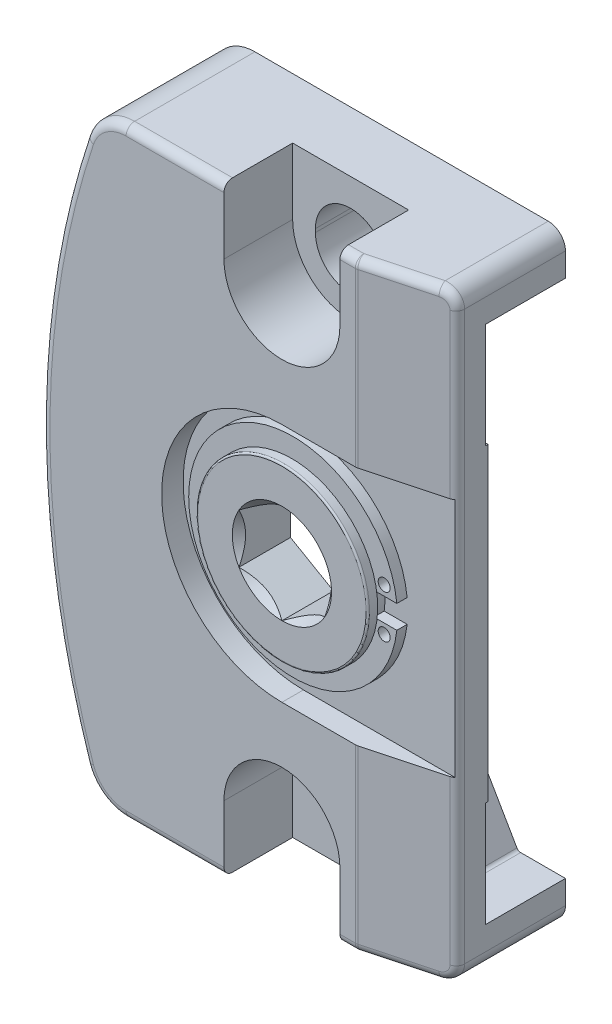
ISO-10303-21;
HEADER;
FILE_DESCRIPTION(('STEP AP214'),'2;1');
FILE_NAME('part.step','',(''),(''),'','','');
FILE_SCHEMA(('AUTOMOTIVE_DESIGN { 1 0 10303 214 1 1 1 1 }'));
ENDSEC;
DATA;
#1=APPLICATION_CONTEXT('core data for automotive mechanical design processes');
#2=APPLICATION_PROTOCOL_DEFINITION('international standard','automotive_design',2000,#1);
#3=PRODUCT_CONTEXT('',#1,'mechanical');
#4=PRODUCT('Part','Part','',(#3));
#5=PRODUCT_RELATED_PRODUCT_CATEGORY('part','',(#4));
#6=PRODUCT_DEFINITION_FORMATION('','',#4);
#7=PRODUCT_DEFINITION_CONTEXT('part definition',#1,'design');
#8=PRODUCT_DEFINITION('design','',#6,#7);
#9=PRODUCT_DEFINITION_SHAPE('','',#8);
#10=(LENGTH_UNIT() NAMED_UNIT(*) SI_UNIT(.MILLI.,.METRE.));
#11=(NAMED_UNIT(*) PLANE_ANGLE_UNIT() SI_UNIT($,.RADIAN.));
#12=(NAMED_UNIT(*) SI_UNIT($,.STERADIAN.) SOLID_ANGLE_UNIT());
#13=UNCERTAINTY_MEASURE_WITH_UNIT(LENGTH_MEASURE(1.E-05),#10,'distance_accuracy_value','');
#14=(GEOMETRIC_REPRESENTATION_CONTEXT(3) GLOBAL_UNCERTAINTY_ASSIGNED_CONTEXT((#13)) GLOBAL_UNIT_ASSIGNED_CONTEXT((#10,
#11,#12)) REPRESENTATION_CONTEXT('',''));
#15=CARTESIAN_POINT('',(0.,0.,0.));
#16=DIRECTION('',(0.,0.,1.));
#17=DIRECTION('',(1.,0.,0.));
#18=AXIS2_PLACEMENT_3D('',#15,#16,#17);
#19=CARTESIAN_POINT('',(18.,9.5,9.));
#20=DIRECTION('',(0.,0.,-1.));
#21=DIRECTION('',(-1.,0.,0.));
#22=AXIS2_PLACEMENT_3D('',#19,#20,#21);
#23=PLANE('',#22);
#24=DIRECTION('',(0.,1.,0.));
#25=VECTOR('',#24,1.);
#26=CARTESIAN_POINT('',(5.,24.6132486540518,9.));
#27=LINE('',#26,#25);
#28=CARTESIAN_POINT('',(5.,24.6132486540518,9.));
#29=VERTEX_POINT('',#28);
#30=CARTESIAN_POINT('',(5.,30.3867513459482,9.));
#31=VERTEX_POINT('',#30);
#32=EDGE_CURVE('E712',#29,#31,#27,.T.);
#33=ORIENTED_EDGE('',*,*,#32,.T.);
#34=DIRECTION('',(-0.866025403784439,0.5,0.));
#35=VECTOR('',#34,1.);
#36=CARTESIAN_POINT('',(5.,30.3867513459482,9.));
#37=LINE('',#36,#35);
#38=CARTESIAN_POINT('',(0.,33.2735026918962,9.));
#39=VERTEX_POINT('',#38);
#40=EDGE_CURVE('E468',#31,#39,#37,.T.);
#41=ORIENTED_EDGE('',*,*,#40,.T.);
#42=DIRECTION('',(-0.866025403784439,-0.5,0.));
#43=VECTOR('',#42,1.);
#44=CARTESIAN_POINT('',(0.,33.2735026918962,9.));
#45=LINE('',#44,#43);
#46=CARTESIAN_POINT('',(-5.,30.3867513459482,9.));
#47=VERTEX_POINT('',#46);
#48=EDGE_CURVE('E463',#39,#47,#45,.T.);
#49=ORIENTED_EDGE('',*,*,#48,.T.);
#50=DIRECTION('',(0.,-1.,0.));
#51=VECTOR('',#50,1.);
#52=CARTESIAN_POINT('',(-5.,30.3867513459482,9.));
#53=LINE('',#52,#51);
#54=CARTESIAN_POINT('',(-5.,24.6132486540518,9.));
#55=VERTEX_POINT('',#54);
#56=EDGE_CURVE('E466',#47,#55,#53,.T.);
#57=ORIENTED_EDGE('',*,*,#56,.T.);
#58=DIRECTION('',(0.866025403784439,-0.5,0.));
#59=VECTOR('',#58,1.);
#60=CARTESIAN_POINT('',(-5.,24.6132486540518,9.));
#61=LINE('',#60,#59);
#62=CARTESIAN_POINT('',(0.,21.7264973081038,9.));
#63=VERTEX_POINT('',#62);
#64=EDGE_CURVE('E18',#55,#63,#61,.T.);
#65=ORIENTED_EDGE('',*,*,#64,.T.);
#66=DIRECTION('',(0.866025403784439,0.5,0.));
#67=VECTOR('',#66,1.);
#68=CARTESIAN_POINT('',(0.,21.7264973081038,9.));
#69=LINE('',#68,#67);
#70=EDGE_CURVE('E9',#63,#29,#69,.T.);
#71=ORIENTED_EDGE('',*,*,#70,.T.);
#72=EDGE_LOOP('',(#33,#41,#49,#57,#65,#71));
#73=FACE_BOUND('',#72,.T.);
#74=CARTESIAN_POINT('',(72.,27.5,9.));
#75=DIRECTION('',(0.,0.,-1.));
#76=DIRECTION('',(-1.,0.,0.));
#77=AXIS2_PLACEMENT_3D('',#74,#75,#76);
#78=CIRCLE('',#77,100.);
#79=CARTESIAN_POINT('',(-26.3666610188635,45.5,9.));
#80=VERTEX_POINT('',#79);
#81=CARTESIAN_POINT('',(-26.3666610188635,9.5,9.));
#82=VERTEX_POINT('',#81);
#83=EDGE_CURVE('E803',#80,#82,#78,.F.);
#84=ORIENTED_EDGE('',*,*,#83,.F.);
#85=DIRECTION('',(1.,0.,0.));
#86=VECTOR('',#85,1.);
#87=CARTESIAN_POINT('',(18.,45.5,9.));
#88=LINE('',#87,#86);
#89=CARTESIAN_POINT('',(18.,45.5,9.));
#90=VERTEX_POINT('',#89);
#91=EDGE_CURVE('E1194',#80,#90,#88,.T.);
#92=ORIENTED_EDGE('',*,*,#91,.T.);
#93=DIRECTION('',(0.,-1.,0.));
#94=VECTOR('',#93,1.);
#95=CARTESIAN_POINT('',(18.,45.5,9.));
#96=LINE('',#95,#94);
#97=CARTESIAN_POINT('',(18.,9.5,9.));
#98=VERTEX_POINT('',#97);
#99=EDGE_CURVE('E1196',#90,#98,#96,.T.);
#100=ORIENTED_EDGE('',*,*,#99,.T.);
#101=DIRECTION('',(-1.,0.,0.));
#102=VECTOR('',#101,1.);
#103=CARTESIAN_POINT('',(18.,9.5,9.));
#104=LINE('',#103,#102);
#105=EDGE_CURVE('E732',#98,#82,#104,.T.);
#106=ORIENTED_EDGE('',*,*,#105,.T.);
#107=EDGE_LOOP('',(#84,#92,#100,#106));
#108=FACE_BOUND('',#107,.T.);
#109=ADVANCED_FACE('F14',(#73,#108),#23,.T.);
#110=CARTESIAN_POINT('',(5.,24.6132486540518,8.5));
#111=DIRECTION('',(1.,0.,0.));
#112=DIRECTION('',(0.,1.,0.));
#113=AXIS2_PLACEMENT_3D('',#110,#111,#112);
#114=PLANE('',#113);
#115=ORIENTED_EDGE('',*,*,#32,.F.);
#116=DIRECTION('',(0.,0.,1.));
#117=VECTOR('',#116,1.);
#118=CARTESIAN_POINT('',(5.,24.6132486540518,8.5));
#119=LINE('',#118,#117);
#120=CARTESIAN_POINT('',(5.,24.6132486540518,15.));
#121=VERTEX_POINT('',#120);
#122=EDGE_CURVE('E498',#29,#121,#119,.T.);
#123=ORIENTED_EDGE('',*,*,#122,.T.);
#124=CARTESIAN_POINT('',(5.,21.4755878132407,17.0555165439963));
#125=CARTESIAN_POINT('',(5.,21.6211347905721,16.9435436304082));
#126=CARTESIAN_POINT('',(5.,21.7674660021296,16.8325740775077));
#127=CARTESIAN_POINT('',(5.,22.0620174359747,16.6131000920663));
#128=CARTESIAN_POINT('',(5.,22.210238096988,16.5045962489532));
#129=CARTESIAN_POINT('',(5.,22.5099721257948,16.2897399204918));
#130=CARTESIAN_POINT('',(5.,22.6615020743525,16.1834104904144));
#131=CARTESIAN_POINT('',(5.,22.9670838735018,15.9744519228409));
#132=CARTESIAN_POINT('',(5.,23.1211355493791,15.8718225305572));
#133=CARTESIAN_POINT('',(5.,23.4420468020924,15.6647432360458));
#134=CARTESIAN_POINT('',(5.,23.6090991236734,15.5605905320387));
#135=CARTESIAN_POINT('',(5.,23.947126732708,15.3587497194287));
#136=CARTESIAN_POINT('',(5.,24.1181026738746,15.2610626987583));
#137=CARTESIAN_POINT('',(5.,24.464024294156,15.0742336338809));
#138=CARTESIAN_POINT('',(5.,24.6389563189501,14.9850665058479));
#139=CARTESIAN_POINT('',(5.,24.993765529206,14.8172749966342));
#140=CARTESIAN_POINT('',(5.,25.1736403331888,14.7386456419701));
#141=CARTESIAN_POINT('',(5.,25.5207138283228,14.6018788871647));
#142=CARTESIAN_POINT('',(5.,25.6874123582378,14.5424851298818));
#143=CARTESIAN_POINT('',(5.,26.0250563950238,14.4370408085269));
#144=CARTESIAN_POINT('',(5.,26.1960021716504,14.3909910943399));
#145=CARTESIAN_POINT('',(5.,26.5381424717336,14.315495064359));
#146=CARTESIAN_POINT('',(5.,26.7092693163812,14.2857471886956));
#147=CARTESIAN_POINT('',(5.,27.0536491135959,14.243475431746));
#148=CARTESIAN_POINT('',(5.,27.2269016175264,14.2309479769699));
#149=CARTESIAN_POINT('',(5.,27.5661883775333,14.2241841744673));
#150=CARTESIAN_POINT('',(5.,27.7322073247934,14.2291726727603));
#151=CARTESIAN_POINT('',(5.,28.0629496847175,14.2553858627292));
#152=CARTESIAN_POINT('',(5.,28.2276729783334,14.2766120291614));
#153=CARTESIAN_POINT('',(5.,28.5574235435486,14.334461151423));
#154=CARTESIAN_POINT('',(5.,28.7224023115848,14.3713559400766));
#155=CARTESIAN_POINT('',(5.,29.0487267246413,14.4584954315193));
#156=CARTESIAN_POINT('',(5.,29.2100725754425,14.5087393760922));
#157=CARTESIAN_POINT('',(5.,29.5380198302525,14.6235866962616));
#158=CARTESIAN_POINT('',(5.,29.7043869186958,14.6888515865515));
#159=CARTESIAN_POINT('',(5.,30.032841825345,14.8294643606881));
#160=CARTESIAN_POINT('',(5.,30.1949276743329,14.9048167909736));
#161=CARTESIAN_POINT('',(5.,30.5155855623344,15.0638176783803));
#162=CARTESIAN_POINT('',(5.,30.6741448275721,15.1474916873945));
#163=CARTESIAN_POINT('',(5.,30.9876300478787,15.3212943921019));
#164=CARTESIAN_POINT('',(5.,31.142556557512,15.4114220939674));
#165=CARTESIAN_POINT('',(5.,31.4416792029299,15.592293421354));
#166=CARTESIAN_POINT('',(5.,31.586027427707,15.6827868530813));
#167=CARTESIAN_POINT('',(5.,31.8722438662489,15.8676255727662));
#168=CARTESIAN_POINT('',(5.,32.0141118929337,15.9619711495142));
#169=CARTESIAN_POINT('',(5.,32.2945518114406,16.153059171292));
#170=CARTESIAN_POINT('',(5.,32.4331410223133,16.2497762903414));
#171=CARTESIAN_POINT('',(5.,32.7084181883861,16.4458031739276));
#172=CARTESIAN_POINT('',(5.,32.8451066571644,16.5451122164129));
#173=CARTESIAN_POINT('',(5.,32.9809977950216,16.6454822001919));
#174=B_SPLINE_CURVE_WITH_KNOTS('',3,(#124,#125,#126,#127,#128,#129,#130,#131,#132,#133,#134,
#135,#136,#137,#138,#139,#140,#141,#142,#143,#144,#145,#146,#147,#148,#149,#150,#151,#152,#153,
#154,#155,#156,#157,#158,#159,#160,#161,#162,#163,#164,#165,#166,#167,#168,#169,#170,#171,#172,
#173),.UNSPECIFIED.,.F.,.F.,(4,2,2,2,2,2,2,2,2,2,2,2,2,2,2,2,2,2,2,2,2,2,2,2,4),(0.,
0.55091545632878,1.10196125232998,1.65725826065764,2.21251695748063,2.80298369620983,
3.39354953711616,3.98231932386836,4.57081024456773,5.10124266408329,5.63170885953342,
6.15199902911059,6.67218121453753,7.16963881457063,7.66714160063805,8.17365275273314,
8.68013514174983,9.21585648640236,9.75182009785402,10.2894834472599,10.8270641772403,
11.3380984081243,11.8491710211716,12.3561402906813,12.8629698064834),.UNSPECIFIED.);
#175=CARTESIAN_POINT('',(5.,30.3867513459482,15.));
#176=VERTEX_POINT('',#175);
#177=EDGE_CURVE('E500',#121,#176,#174,.T.);
#178=ORIENTED_EDGE('',*,*,#177,.T.);
#179=DIRECTION('',(0.,0.,1.));
#180=VECTOR('',#179,1.);
#181=CARTESIAN_POINT('',(5.,30.3867513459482,8.5));
#182=LINE('',#181,#180);
#183=EDGE_CURVE('E501',#31,#176,#182,.T.);
#184=ORIENTED_EDGE('',*,*,#183,.F.);
#185=EDGE_LOOP('',(#115,#123,#178,#184));
#186=FACE_BOUND('',#185,.T.);
#187=ADVANCED_FACE('F530',(#186),#114,.F.);
#188=CARTESIAN_POINT('',(5.,30.3867513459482,8.5));
#189=DIRECTION('',(0.5,0.866025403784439,0.));
#190=DIRECTION('',(-0.866025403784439,0.5,0.));
#191=AXIS2_PLACEMENT_3D('',#188,#189,#190);
#192=PLANE('',#191);
#193=ORIENTED_EDGE('',*,*,#40,.F.);
#194=ORIENTED_EDGE('',*,*,#183,.T.);
#195=CARTESIAN_POINT('',(5.0002,30.3866358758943,15.0001154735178));
#196=CARTESIAN_POINT('',(4.91422723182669,30.4362722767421,14.9504835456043));
#197=CARTESIAN_POINT('',(4.82759363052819,30.4862902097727,14.9023747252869));
#198=CARTESIAN_POINT('',(4.65287511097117,30.5871639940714,14.8096666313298));
#199=CARTESIAN_POINT('',(4.5647894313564,30.6380202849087,14.7650692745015));
#200=CARTESIAN_POINT('',(4.29734143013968,30.7924314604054,14.6368590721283));
#201=CARTESIAN_POINT('',(4.11571500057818,30.8972935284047,14.5593750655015));
#202=CARTESIAN_POINT('',(3.74945075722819,31.1087562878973,14.4266889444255));
#203=CARTESIAN_POINT('',(3.56490656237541,31.215302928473,14.3711525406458));
#204=CARTESIAN_POINT('',(3.28505622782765,31.3768745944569,14.3069104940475));
#205=CARTESIAN_POINT('',(3.19136076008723,31.4309696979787,14.2886821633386));
#206=CARTESIAN_POINT('',(3.00317647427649,31.5396179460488,14.2589921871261));
#207=CARTESIAN_POINT('',(2.90868777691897,31.5941710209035,14.2475295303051));
#208=CARTESIAN_POINT('',(2.67843374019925,31.7271082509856,14.228310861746));
#209=CARTESIAN_POINT('',(2.54242031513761,31.8056356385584,14.2242782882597));
#210=CARTESIAN_POINT('',(2.27063858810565,31.9625488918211,14.2310458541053));
#211=CARTESIAN_POINT('',(2.13487038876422,32.0409346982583,14.241851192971));
#212=CARTESIAN_POINT('',(1.86461396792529,32.1969673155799,14.277657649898));
#213=CARTESIAN_POINT('',(1.73012734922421,32.2746132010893,14.3026746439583));
#214=CARTESIAN_POINT('',(1.46346560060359,32.428570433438,14.3655443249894));
#215=CARTESIAN_POINT('',(1.33129029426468,32.504881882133,14.4033960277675));
#216=CARTESIAN_POINT('',(1.09665179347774,32.6403504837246,14.4812698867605));
#217=CARTESIAN_POINT('',(0.993669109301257,32.6998075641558,14.519244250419));
#218=CARTESIAN_POINT('',(0.789552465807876,32.8176543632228,14.6013126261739));
#219=CARTESIAN_POINT('',(0.688418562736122,32.8760440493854,14.6454068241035));
#220=CARTESIAN_POINT('',(0.488318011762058,32.9915721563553,14.7387263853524));
#221=CARTESIAN_POINT('',(0.389345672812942,33.0487138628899,14.7879356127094));
#222=CARTESIAN_POINT('',(0.19323375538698,33.1619391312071,14.890839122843));
#223=CARTESIAN_POINT('',(0.0960930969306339,33.2180233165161,14.944530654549));
#224=CARTESIAN_POINT('',(-0.000200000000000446,33.2736181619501,15.0001154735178));
#225=B_SPLINE_CURVE_WITH_KNOTS('',3,(#195,#196,#197,#198,#199,#200,#201,#202,#203,#204,#205,
#206,#207,#208,#209,#210,#211,#212,#213,#214,#215,#216,#217,#218,#219,#220,#221,#222,#223,#224),
.UNSPECIFIED.,.F.,.F.,(4,2,2,2,2,2,2,2,2,2,2,2,2,2,4),(0.,0.332945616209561,0.666071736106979,
1.33592065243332,1.99513262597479,2.32409207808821,2.65300234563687,3.12358963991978,
3.59434188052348,4.0656210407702,4.53686407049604,4.91117956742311,5.28550643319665,
5.65868635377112,6.0316388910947),.UNSPECIFIED.);
#226=CARTESIAN_POINT('',(0.,33.2735026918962,15.));
#227=VERTEX_POINT('',#226);
#228=EDGE_CURVE('E503',#176,#227,#225,.T.);
#229=ORIENTED_EDGE('',*,*,#228,.T.);
#230=DIRECTION('',(0.,0.,1.));
#231=VECTOR('',#230,1.);
#232=CARTESIAN_POINT('',(0.,33.2735026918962,8.5));
#233=LINE('',#232,#231);
#234=EDGE_CURVE('E488',#39,#227,#233,.T.);
#235=ORIENTED_EDGE('',*,*,#234,.F.);
#236=EDGE_LOOP('',(#193,#194,#229,#235));
#237=FACE_BOUND('',#236,.T.);
#238=ADVANCED_FACE('F571',(#237),#192,.F.);
#239=CARTESIAN_POINT('',(0.,33.2735026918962,8.5));
#240=DIRECTION('',(-0.5,0.866025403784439,0.));
#241=DIRECTION('',(-0.866025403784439,-0.5,0.));
#242=AXIS2_PLACEMENT_3D('',#239,#240,#241);
#243=PLANE('',#242);
#244=ORIENTED_EDGE('',*,*,#48,.F.);
#245=ORIENTED_EDGE('',*,*,#234,.T.);
#246=CARTESIAN_POINT('',(0.000199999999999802,33.2736181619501,15.0001154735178));
#247=CARTESIAN_POINT('',(-0.0857727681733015,33.2239817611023,14.9504835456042));
#248=CARTESIAN_POINT('',(-0.172406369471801,33.1739638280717,14.9023747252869));
#249=CARTESIAN_POINT('',(-0.347124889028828,33.073090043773,14.8096666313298));
#250=CARTESIAN_POINT('',(-0.435210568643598,33.0222337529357,14.7650692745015));
#251=CARTESIAN_POINT('',(-0.702658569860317,32.867822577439,14.6368590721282));
#252=CARTESIAN_POINT('',(-0.884284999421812,32.7629605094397,14.5593750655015));
#253=CARTESIAN_POINT('',(-1.2505492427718,32.5514977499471,14.4266889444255));
#254=CARTESIAN_POINT('',(-1.43509343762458,32.4449511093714,14.3711525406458));
#255=CARTESIAN_POINT('',(-1.71494377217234,32.2833794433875,14.3069104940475));
#256=CARTESIAN_POINT('',(-1.80863923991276,32.2292843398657,14.2886821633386));
#257=CARTESIAN_POINT('',(-1.9968235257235,32.1206360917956,14.2589921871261));
#258=CARTESIAN_POINT('',(-2.09131222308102,32.0660830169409,14.2475295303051));
#259=CARTESIAN_POINT('',(-2.32156625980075,31.9331457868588,14.228310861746));
#260=CARTESIAN_POINT('',(-2.45757968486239,31.854618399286,14.2242782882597));
#261=CARTESIAN_POINT('',(-2.72936141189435,31.6977051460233,14.2310458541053));
#262=CARTESIAN_POINT('',(-2.86512961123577,31.6193193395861,14.241851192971));
#263=CARTESIAN_POINT('',(-3.13538603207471,31.4632867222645,14.277657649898));
#264=CARTESIAN_POINT('',(-3.26987265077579,31.385640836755,14.3026746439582));
#265=CARTESIAN_POINT('',(-3.53653439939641,31.2316836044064,14.3655443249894));
#266=CARTESIAN_POINT('',(-3.66870970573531,31.1553721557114,14.4033960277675));
#267=CARTESIAN_POINT('',(-3.90334820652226,31.0199035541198,14.4812698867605));
#268=CARTESIAN_POINT('',(-4.00633089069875,30.9604464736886,14.519244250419));
#269=CARTESIAN_POINT('',(-4.21044753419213,30.8425996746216,14.6013126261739));
#270=CARTESIAN_POINT('',(-4.31158143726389,30.7842099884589,14.6454068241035));
#271=CARTESIAN_POINT('',(-4.51168198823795,30.6686818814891,14.7387263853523));
#272=CARTESIAN_POINT('',(-4.61065432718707,30.6115401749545,14.7879356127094));
#273=CARTESIAN_POINT('',(-4.80676624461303,30.4983149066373,14.890839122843));
#274=CARTESIAN_POINT('',(-4.90390690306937,30.4422307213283,14.944530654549));
#275=CARTESIAN_POINT('',(-5.0002,30.3866358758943,15.0001154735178));
#276=B_SPLINE_CURVE_WITH_KNOTS('',3,(#246,#247,#248,#249,#250,#251,#252,#253,#254,#255,#256,
#257,#258,#259,#260,#261,#262,#263,#264,#265,#266,#267,#268,#269,#270,#271,#272,#273,#274,#275),
.UNSPECIFIED.,.F.,.F.,(4,2,2,2,2,2,2,2,2,2,2,2,2,2,4),(0.,0.332945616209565,0.666071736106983,
1.33592065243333,1.99513262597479,2.32409207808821,2.65300234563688,3.12358963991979,
3.59434188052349,4.06562104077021,4.53686407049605,4.91117956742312,5.28550643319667,
5.65868635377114,6.03163889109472),.UNSPECIFIED.);
#277=CARTESIAN_POINT('',(-5.,30.3867513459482,15.));
#278=VERTEX_POINT('',#277);
#279=EDGE_CURVE('E483',#227,#278,#276,.T.);
#280=ORIENTED_EDGE('',*,*,#279,.T.);
#281=DIRECTION('',(0.,0.,1.));
#282=VECTOR('',#281,1.);
#283=CARTESIAN_POINT('',(-5.,30.3867513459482,8.5));
#284=LINE('',#283,#282);
#285=EDGE_CURVE('E477',#47,#278,#284,.T.);
#286=ORIENTED_EDGE('',*,*,#285,.F.);
#287=EDGE_LOOP('',(#244,#245,#280,#286));
#288=FACE_BOUND('',#287,.T.);
#289=ADVANCED_FACE('F481',(#288),#243,.F.);
#290=CARTESIAN_POINT('',(-5.,30.3867513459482,8.5));
#291=DIRECTION('',(-1.,0.,0.));
#292=DIRECTION('',(0.,-1.,0.));
#293=AXIS2_PLACEMENT_3D('',#290,#291,#292);
#294=PLANE('',#293);
#295=ORIENTED_EDGE('',*,*,#56,.F.);
#296=ORIENTED_EDGE('',*,*,#285,.T.);
#297=CARTESIAN_POINT('',(-5.,21.4755878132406,17.0555165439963));
#298=CARTESIAN_POINT('',(-5.,21.6211347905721,16.9435436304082));
#299=CARTESIAN_POINT('',(-5.,21.7674660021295,16.8325740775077));
#300=CARTESIAN_POINT('',(-5.,22.0620174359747,16.6131000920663));
#301=CARTESIAN_POINT('',(-5.,22.210238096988,16.5045962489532));
#302=CARTESIAN_POINT('',(-5.,22.5099721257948,16.2897399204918));
#303=CARTESIAN_POINT('',(-5.,22.6615020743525,16.1834104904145));
#304=CARTESIAN_POINT('',(-5.,22.9670838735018,15.9744519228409));
#305=CARTESIAN_POINT('',(-5.,23.121135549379,15.8718225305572));
#306=CARTESIAN_POINT('',(-5.,23.4420468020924,15.6647432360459));
#307=CARTESIAN_POINT('',(-5.,23.6090991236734,15.5605905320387));
#308=CARTESIAN_POINT('',(-5.,23.947126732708,15.3587497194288));
#309=CARTESIAN_POINT('',(-5.,24.1181026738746,15.2610626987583));
#310=CARTESIAN_POINT('',(-5.,24.464024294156,15.0742336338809));
#311=CARTESIAN_POINT('',(-5.,24.6389563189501,14.9850665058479));
#312=CARTESIAN_POINT('',(-5.,24.993765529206,14.8172749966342));
#313=CARTESIAN_POINT('',(-5.,25.1736403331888,14.7386456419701));
#314=CARTESIAN_POINT('',(-5.,25.5207138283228,14.6018788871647));
#315=CARTESIAN_POINT('',(-5.,25.6874123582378,14.5424851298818));
#316=CARTESIAN_POINT('',(-5.,26.0250563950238,14.4370408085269));
#317=CARTESIAN_POINT('',(-5.,26.1960021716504,14.3909910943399));
#318=CARTESIAN_POINT('',(-5.,26.5381424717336,14.315495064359));
#319=CARTESIAN_POINT('',(-5.,26.7092693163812,14.2857471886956));
#320=CARTESIAN_POINT('',(-5.,27.0536491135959,14.243475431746));
#321=CARTESIAN_POINT('',(-5.,27.2269016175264,14.2309479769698));
#322=CARTESIAN_POINT('',(-5.,27.5661883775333,14.2241841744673));
#323=CARTESIAN_POINT('',(-5.,27.7322073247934,14.2291726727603));
#324=CARTESIAN_POINT('',(-5.,28.0629496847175,14.2553858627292));
#325=CARTESIAN_POINT('',(-5.,28.2276729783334,14.2766120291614));
#326=CARTESIAN_POINT('',(-5.,28.5574235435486,14.334461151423));
#327=CARTESIAN_POINT('',(-5.,28.7224023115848,14.3713559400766));
#328=CARTESIAN_POINT('',(-5.,29.0487267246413,14.4584954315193));
#329=CARTESIAN_POINT('',(-5.,29.2100725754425,14.5087393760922));
#330=CARTESIAN_POINT('',(-5.,29.5380198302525,14.6235866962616));
#331=CARTESIAN_POINT('',(-5.,29.7043869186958,14.6888515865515));
#332=CARTESIAN_POINT('',(-5.,30.032841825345,14.8294643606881));
#333=CARTESIAN_POINT('',(-5.,30.1949276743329,14.9048167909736));
#334=CARTESIAN_POINT('',(-5.,30.5155855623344,15.0638176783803));
#335=CARTESIAN_POINT('',(-5.,30.6741448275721,15.1474916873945));
#336=CARTESIAN_POINT('',(-5.,30.9876300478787,15.3212943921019));
#337=CARTESIAN_POINT('',(-5.,31.142556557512,15.4114220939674));
#338=CARTESIAN_POINT('',(-5.,31.4416792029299,15.592293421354));
#339=CARTESIAN_POINT('',(-5.,31.586027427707,15.6827868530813));
#340=CARTESIAN_POINT('',(-5.,31.8722438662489,15.8676255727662));
#341=CARTESIAN_POINT('',(-5.,32.0141118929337,15.9619711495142));
#342=CARTESIAN_POINT('',(-5.,32.2945518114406,16.153059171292));
#343=CARTESIAN_POINT('',(-5.,32.4331410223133,16.2497762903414));
#344=CARTESIAN_POINT('',(-5.,32.7084181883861,16.4458031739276));
#345=CARTESIAN_POINT('',(-5.,32.8451066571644,16.5451122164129));
#346=CARTESIAN_POINT('',(-5.,32.9809977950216,16.6454822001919));
#347=B_SPLINE_CURVE_WITH_KNOTS('',3,(#297,#298,#299,#300,#301,#302,#303,#304,#305,#306,#307,
#308,#309,#310,#311,#312,#313,#314,#315,#316,#317,#318,#319,#320,#321,#322,#323,#324,#325,#326,
#327,#328,#329,#330,#331,#332,#333,#334,#335,#336,#337,#338,#339,#340,#341,#342,#343,#344,#345,
#346),.UNSPECIFIED.,.F.,.F.,(4,2,2,2,2,2,2,2,2,2,2,2,2,2,2,2,2,2,2,2,2,2,2,2,4),(0.,
0.550915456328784,1.10196125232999,1.65725826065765,2.21251695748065,2.80298369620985,
3.3935495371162,3.9823193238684,4.57081024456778,5.10124266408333,5.63170885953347,
6.15199902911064,6.67218121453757,7.16963881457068,7.66714160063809,8.17365275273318,
8.68013514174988,9.2158564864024,9.75182009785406,10.28948344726,10.8270641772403,
11.3380984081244,11.8491710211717,12.3561402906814,12.8629698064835),.UNSPECIFIED.);
#348=CARTESIAN_POINT('',(-5.,24.6132486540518,15.));
#349=VERTEX_POINT('',#348);
#350=EDGE_CURVE('E485',#278,#349,#347,.F.);
#351=ORIENTED_EDGE('',*,*,#350,.T.);
#352=DIRECTION('',(0.,0.,1.));
#353=VECTOR('',#352,1.);
#354=CARTESIAN_POINT('',(-5.,24.6132486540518,8.5));
#355=LINE('',#354,#353);
#356=EDGE_CURVE('E479',#55,#349,#355,.T.);
#357=ORIENTED_EDGE('',*,*,#356,.F.);
#358=EDGE_LOOP('',(#295,#296,#351,#357));
#359=FACE_BOUND('',#358,.T.);
#360=ADVANCED_FACE('F475',(#359),#294,.F.);
#361=CARTESIAN_POINT('',(-5.,24.6132486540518,8.5));
#362=DIRECTION('',(-0.5,-0.866025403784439,0.));
#363=DIRECTION('',(0.866025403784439,-0.5,0.));
#364=AXIS2_PLACEMENT_3D('',#361,#362,#363);
#365=PLANE('',#364);
#366=ORIENTED_EDGE('',*,*,#64,.F.);
#367=ORIENTED_EDGE('',*,*,#356,.T.);
#368=CARTESIAN_POINT('',(-5.0002,24.6133641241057,15.0001154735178));
#369=CARTESIAN_POINT('',(-4.91422723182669,24.5637277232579,14.9504835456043));
#370=CARTESIAN_POINT('',(-4.82759363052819,24.5137097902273,14.9023747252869));
#371=CARTESIAN_POINT('',(-4.65287511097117,24.4128360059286,14.8096666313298));
#372=CARTESIAN_POINT('',(-4.5647894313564,24.3619797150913,14.7650692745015));
#373=CARTESIAN_POINT('',(-4.29734143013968,24.2075685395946,14.6368590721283));
#374=CARTESIAN_POINT('',(-4.11571500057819,24.1027064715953,14.5593750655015));
#375=CARTESIAN_POINT('',(-3.7494507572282,23.8912437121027,14.4266889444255));
#376=CARTESIAN_POINT('',(-3.56490656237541,23.784697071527,14.3711525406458));
#377=CARTESIAN_POINT('',(-3.28505622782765,23.6231254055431,14.3069104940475));
#378=CARTESIAN_POINT('',(-3.19136076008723,23.5690303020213,14.2886821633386));
#379=CARTESIAN_POINT('',(-3.00317647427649,23.4603820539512,14.2589921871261));
#380=CARTESIAN_POINT('',(-2.90868777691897,23.4058289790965,14.2475295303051));
#381=CARTESIAN_POINT('',(-2.67843374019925,23.2728917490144,14.228310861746));
#382=CARTESIAN_POINT('',(-2.54242031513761,23.1943643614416,14.2242782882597));
#383=CARTESIAN_POINT('',(-2.27063858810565,23.0374511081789,14.2310458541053));
#384=CARTESIAN_POINT('',(-2.13487038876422,22.9590653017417,14.241851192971));
#385=CARTESIAN_POINT('',(-1.86461396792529,22.8030326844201,14.277657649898));
#386=CARTESIAN_POINT('',(-1.73012734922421,22.7253867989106,14.3026746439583));
#387=CARTESIAN_POINT('',(-1.46346560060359,22.571429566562,14.3655443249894));
#388=CARTESIAN_POINT('',(-1.33129029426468,22.495118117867,14.4033960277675));
#389=CARTESIAN_POINT('',(-1.09665179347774,22.3596495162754,14.4812698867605));
#390=CARTESIAN_POINT('',(-0.993669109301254,22.3001924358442,14.519244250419));
#391=CARTESIAN_POINT('',(-0.789552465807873,22.1823456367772,14.6013126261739));
#392=CARTESIAN_POINT('',(-0.68841856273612,22.1239559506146,14.6454068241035));
#393=CARTESIAN_POINT('',(-0.488318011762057,22.0084278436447,14.7387263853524));
#394=CARTESIAN_POINT('',(-0.38934567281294,21.9512861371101,14.7879356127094));
#395=CARTESIAN_POINT('',(-0.193233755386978,21.8380608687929,14.890839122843));
#396=CARTESIAN_POINT('',(-0.0960930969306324,21.7819766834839,14.944530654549));
#397=CARTESIAN_POINT('',(0.000199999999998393,21.7263818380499,15.0001154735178));
#398=B_SPLINE_CURVE_WITH_KNOTS('',3,(#368,#369,#370,#371,#372,#373,#374,#375,#376,#377,#378,
#379,#380,#381,#382,#383,#384,#385,#386,#387,#388,#389,#390,#391,#392,#393,#394,#395,#396,#397),
.UNSPECIFIED.,.F.,.F.,(4,2,2,2,2,2,2,2,2,2,2,2,2,2,4),(0.,0.332945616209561,0.666071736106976,
1.33592065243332,1.99513262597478,2.32409207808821,2.65300234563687,3.12358963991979,
3.59434188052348,4.06562104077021,4.53686407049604,4.91117956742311,5.28550643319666,
5.65868635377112,6.0316388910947),.UNSPECIFIED.);
#399=CARTESIAN_POINT('',(0.,21.7264973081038,15.));
#400=VERTEX_POINT('',#399);
#401=EDGE_CURVE('E494',#349,#400,#398,.T.);
#402=ORIENTED_EDGE('',*,*,#401,.T.);
#403=DIRECTION('',(0.,0.,1.));
#404=VECTOR('',#403,1.);
#405=CARTESIAN_POINT('',(0.,21.7264973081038,8.5));
#406=LINE('',#405,#404);
#407=EDGE_CURVE('E495',#63,#400,#406,.T.);
#408=ORIENTED_EDGE('',*,*,#407,.F.);
#409=EDGE_LOOP('',(#366,#367,#402,#408));
#410=FACE_BOUND('',#409,.T.);
#411=ADVANCED_FACE('F563',(#410),#365,.F.);
#412=CARTESIAN_POINT('',(0.,21.7264973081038,8.5));
#413=DIRECTION('',(0.5,-0.866025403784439,0.));
#414=DIRECTION('',(0.866025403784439,0.5,0.));
#415=AXIS2_PLACEMENT_3D('',#412,#413,#414);
#416=PLANE('',#415);
#417=ORIENTED_EDGE('',*,*,#70,.F.);
#418=ORIENTED_EDGE('',*,*,#407,.T.);
#419=CARTESIAN_POINT('',(-0.000200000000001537,21.7263818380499,15.0001154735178));
#420=CARTESIAN_POINT('',(0.085772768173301,21.7760182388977,14.9504835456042));
#421=CARTESIAN_POINT('',(0.172406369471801,21.8260361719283,14.9023747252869));
#422=CARTESIAN_POINT('',(0.347124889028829,21.926909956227,14.8096666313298));
#423=CARTESIAN_POINT('',(0.435210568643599,21.9777662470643,14.7650692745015));
#424=CARTESIAN_POINT('',(0.702658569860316,22.132177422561,14.6368590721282));
#425=CARTESIAN_POINT('',(0.884284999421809,22.2370394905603,14.5593750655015));
#426=CARTESIAN_POINT('',(1.2505492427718,22.4485022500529,14.4266889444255));
#427=CARTESIAN_POINT('',(1.43509343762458,22.5550488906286,14.3711525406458));
#428=CARTESIAN_POINT('',(1.71494377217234,22.7166205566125,14.3069104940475));
#429=CARTESIAN_POINT('',(1.80863923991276,22.7707156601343,14.2886821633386));
#430=CARTESIAN_POINT('',(1.9968235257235,22.8793639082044,14.2589921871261));
#431=CARTESIAN_POINT('',(2.09131222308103,22.9339169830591,14.2475295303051));
#432=CARTESIAN_POINT('',(2.32156625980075,23.0668542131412,14.228310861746));
#433=CARTESIAN_POINT('',(2.45757968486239,23.145381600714,14.2242782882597));
#434=CARTESIAN_POINT('',(2.72936141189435,23.3022948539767,14.2310458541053));
#435=CARTESIAN_POINT('',(2.86512961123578,23.3806806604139,14.241851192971));
#436=CARTESIAN_POINT('',(3.13538603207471,23.5367132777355,14.277657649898));
#437=CARTESIAN_POINT('',(3.26987265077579,23.6143591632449,14.3026746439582));
#438=CARTESIAN_POINT('',(3.53653439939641,23.7683163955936,14.3655443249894));
#439=CARTESIAN_POINT('',(3.66870970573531,23.8446278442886,14.4033960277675));
#440=CARTESIAN_POINT('',(3.90334820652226,23.9800964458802,14.4812698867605));
#441=CARTESIAN_POINT('',(4.00633089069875,24.0395535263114,14.519244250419));
#442=CARTESIAN_POINT('',(4.21044753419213,24.1574003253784,14.6013126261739));
#443=CARTESIAN_POINT('',(4.31158143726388,24.215790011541,14.6454068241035));
#444=CARTESIAN_POINT('',(4.51168198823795,24.3313181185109,14.7387263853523));
#445=CARTESIAN_POINT('',(4.61065432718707,24.3884598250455,14.7879356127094));
#446=CARTESIAN_POINT('',(4.80676624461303,24.5016850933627,14.890839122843));
#447=CARTESIAN_POINT('',(4.90390690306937,24.5577692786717,14.944530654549));
#448=CARTESIAN_POINT('',(5.0002,24.6133641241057,15.0001154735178));
#449=B_SPLINE_CURVE_WITH_KNOTS('',3,(#419,#420,#421,#422,#423,#424,#425,#426,#427,#428,#429,
#430,#431,#432,#433,#434,#435,#436,#437,#438,#439,#440,#441,#442,#443,#444,#445,#446,#447,#448),
.UNSPECIFIED.,.F.,.F.,(4,2,2,2,2,2,2,2,2,2,2,2,2,2,4),(0.,0.332945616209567,0.666071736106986,
1.33592065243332,1.99513262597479,2.32409207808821,2.65300234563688,3.1235896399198,
3.59434188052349,4.06562104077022,4.53686407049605,4.91117956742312,5.28550643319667,
5.65868635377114,6.03163889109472),.UNSPECIFIED.);
#450=EDGE_CURVE('E497',#400,#121,#449,.T.);
#451=ORIENTED_EDGE('',*,*,#450,.T.);
#452=ORIENTED_EDGE('',*,*,#122,.F.);
#453=EDGE_LOOP('',(#417,#418,#451,#452));
#454=FACE_BOUND('',#453,.T.);
#455=ADVANCED_FACE('F519',(#454),#416,.F.);
#456=CARTESIAN_POINT('',(0.,54.8,7.));
#457=DIRECTION('',(0.,0.,1.));
#458=DIRECTION('',(0.,1.,0.));
#459=AXIS2_PLACEMENT_3D('',#456,#457,#458);
#460=PLANE('',#459);
#461=DIRECTION('',(0.,-1.,0.));
#462=VECTOR('',#461,1.);
#463=CARTESIAN_POINT('',(-4.1,54.8,7.));
#464=LINE('',#463,#462);
#465=CARTESIAN_POINT('',(-4.1,55.2,7.));
#466=VERTEX_POINT('',#465);
#467=CARTESIAN_POINT('',(-4.1,54.8,7.));
#468=VERTEX_POINT('',#467);
#469=EDGE_CURVE('E1088',#466,#468,#464,.T.);
#470=ORIENTED_EDGE('',*,*,#469,.F.);
#471=CARTESIAN_POINT('',(0.,55.2,7.));
#472=DIRECTION('',(0.,0.,1.));
#473=DIRECTION('',(0.,1.,0.));
#474=AXIS2_PLACEMENT_3D('',#471,#472,#473);
#475=CIRCLE('',#474,4.1);
#476=CARTESIAN_POINT('',(4.1,55.2,7.));
#477=VERTEX_POINT('',#476);
#478=EDGE_CURVE('E1216',#477,#466,#475,.T.);
#479=ORIENTED_EDGE('',*,*,#478,.F.);
#480=DIRECTION('',(0.,1.,0.));
#481=VECTOR('',#480,1.);
#482=CARTESIAN_POINT('',(4.1,54.8,7.));
#483=LINE('',#482,#481);
#484=CARTESIAN_POINT('',(4.1,54.8,7.));
#485=VERTEX_POINT('',#484);
#486=EDGE_CURVE('E1121',#485,#477,#483,.T.);
#487=ORIENTED_EDGE('',*,*,#486,.F.);
#488=CARTESIAN_POINT('',(0.,54.8,7.));
#489=DIRECTION('',(0.,0.,1.));
#490=DIRECTION('',(0.,1.,0.));
#491=AXIS2_PLACEMENT_3D('',#488,#489,#490);
#492=CIRCLE('',#491,4.1);
#493=EDGE_CURVE('E1085',#468,#485,#492,.T.);
#494=ORIENTED_EDGE('',*,*,#493,.F.);
#495=EDGE_LOOP('',(#470,#479,#487,#494));
#496=FACE_BOUND('',#495,.T.);
#497=CARTESIAN_POINT('',(0.,54.8,7.));
#498=DIRECTION('',(0.,0.,1.));
#499=DIRECTION('',(0.,1.,0.));
#500=AXIS2_PLACEMENT_3D('',#497,#498,#499);
#501=CIRCLE('',#500,6.75);
#502=CARTESIAN_POINT('',(-6.75,54.8,7.));
#503=VERTEX_POINT('',#502);
#504=CARTESIAN_POINT('',(6.75,54.8,7.));
#505=VERTEX_POINT('',#504);
#506=EDGE_CURVE('E512',#503,#505,#501,.T.);
#507=ORIENTED_EDGE('',*,*,#506,.T.);
#508=DIRECTION('',(0.,1.,0.));
#509=VECTOR('',#508,1.);
#510=CARTESIAN_POINT('',(6.75,62.5,7.));
#511=LINE('',#510,#509);
#512=CARTESIAN_POINT('',(6.75,62.5,7.));
#513=VERTEX_POINT('',#512);
#514=EDGE_CURVE('E1079',#505,#513,#511,.T.);
#515=ORIENTED_EDGE('',*,*,#514,.T.);
#516=DIRECTION('',(-1.,0.,0.));
#517=VECTOR('',#516,1.);
#518=CARTESIAN_POINT('',(-6.75,62.5,7.));
#519=LINE('',#518,#517);
#520=CARTESIAN_POINT('',(-6.75,62.5,7.));
#521=VERTEX_POINT('',#520);
#522=EDGE_CURVE('E1077',#513,#521,#519,.T.);
#523=ORIENTED_EDGE('',*,*,#522,.T.);
#524=DIRECTION('',(0.,-1.,0.));
#525=VECTOR('',#524,1.);
#526=CARTESIAN_POINT('',(-6.75,54.8,7.));
#527=LINE('',#526,#525);
#528=EDGE_CURVE('E1060',#521,#503,#527,.T.);
#529=ORIENTED_EDGE('',*,*,#528,.T.);
#530=EDGE_LOOP('',(#507,#515,#523,#529));
#531=FACE_BOUND('',#530,.T.);
#532=ADVANCED_FACE('F1298',(#496,#531),#460,.T.);
#533=CARTESIAN_POINT('',(0.,0.2,7.));
#534=DIRECTION('',(0.,0.,-1.));
#535=DIRECTION('',(0.,-1.,0.));
#536=AXIS2_PLACEMENT_3D('',#533,#534,#535);
#537=PLANE('',#536);
#538=CARTESIAN_POINT('',(0.,0.2,7.));
#539=DIRECTION('',(0.,0.,1.));
#540=DIRECTION('',(0.,1.,0.));
#541=AXIS2_PLACEMENT_3D('',#538,#539,#540);
#542=CIRCLE('',#541,4.1);
#543=CARTESIAN_POINT('',(4.1,0.2,7.));
#544=VERTEX_POINT('',#543);
#545=CARTESIAN_POINT('',(-4.1,0.2,7.));
#546=VERTEX_POINT('',#545);
#547=EDGE_CURVE('E688',#544,#546,#542,.T.);
#548=ORIENTED_EDGE('',*,*,#547,.F.);
#549=DIRECTION('',(0.,1.,0.));
#550=VECTOR('',#549,1.);
#551=CARTESIAN_POINT('',(4.1,0.2,7.));
#552=LINE('',#551,#550);
#553=CARTESIAN_POINT('',(4.1,-0.2,7.));
#554=VERTEX_POINT('',#553);
#555=EDGE_CURVE('E684',#554,#544,#552,.T.);
#556=ORIENTED_EDGE('',*,*,#555,.F.);
#557=CARTESIAN_POINT('',(0.,-0.2,7.));
#558=DIRECTION('',(0.,0.,1.));
#559=DIRECTION('',(0.,-1.,0.));
#560=AXIS2_PLACEMENT_3D('',#557,#558,#559);
#561=CIRCLE('',#560,4.1);
#562=CARTESIAN_POINT('',(-4.1,-0.2,7.));
#563=VERTEX_POINT('',#562);
#564=EDGE_CURVE('E673',#563,#554,#561,.T.);
#565=ORIENTED_EDGE('',*,*,#564,.F.);
#566=DIRECTION('',(0.,-1.,0.));
#567=VECTOR('',#566,1.);
#568=CARTESIAN_POINT('',(-4.1,0.2,7.));
#569=LINE('',#568,#567);
#570=EDGE_CURVE('E696',#546,#563,#569,.T.);
#571=ORIENTED_EDGE('',*,*,#570,.F.);
#572=EDGE_LOOP('',(#548,#556,#565,#571));
#573=FACE_BOUND('',#572,.T.);
#574=CARTESIAN_POINT('',(0.,0.2,7.));
#575=DIRECTION('',(0.,0.,1.));
#576=DIRECTION('',(0.,-1.,0.));
#577=AXIS2_PLACEMENT_3D('',#574,#575,#576);
#578=CIRCLE('',#577,6.75);
#579=CARTESIAN_POINT('',(6.75,0.2,7.));
#580=VERTEX_POINT('',#579);
#581=CARTESIAN_POINT('',(-6.75,0.2,7.));
#582=VERTEX_POINT('',#581);
#583=EDGE_CURVE('E1057',#580,#582,#578,.T.);
#584=ORIENTED_EDGE('',*,*,#583,.T.);
#585=DIRECTION('',(0.,-1.,0.));
#586=VECTOR('',#585,1.);
#587=CARTESIAN_POINT('',(-6.75,0.2,7.));
#588=LINE('',#587,#586);
#589=CARTESIAN_POINT('',(-6.75,-7.5,7.));
#590=VERTEX_POINT('',#589);
#591=EDGE_CURVE('E1055',#582,#590,#588,.T.);
#592=ORIENTED_EDGE('',*,*,#591,.T.);
#593=DIRECTION('',(1.,0.,0.));
#594=VECTOR('',#593,1.);
#595=CARTESIAN_POINT('',(-6.75,-7.5,7.));
#596=LINE('',#595,#594);
#597=CARTESIAN_POINT('',(6.75,-7.5,7.));
#598=VERTEX_POINT('',#597);
#599=EDGE_CURVE('E1053',#590,#598,#596,.T.);
#600=ORIENTED_EDGE('',*,*,#599,.T.);
#601=DIRECTION('',(0.,1.,0.));
#602=VECTOR('',#601,1.);
#603=CARTESIAN_POINT('',(6.75,-7.5,7.));
#604=LINE('',#603,#602);
#605=EDGE_CURVE('E1049',#598,#580,#604,.T.);
#606=ORIENTED_EDGE('',*,*,#605,.T.);
#607=EDGE_LOOP('',(#584,#592,#600,#606));
#608=FACE_BOUND('',#607,.T.);
#609=ADVANCED_FACE('F685',(#573,#608),#537,.F.);
#610=CARTESIAN_POINT('',(8.53822048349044,61.5,14.));
#611=DIRECTION('',(0.,1.,0.));
#612=DIRECTION('',(-1.,0.,0.));
#613=AXIS2_PLACEMENT_3D('',#610,#611,#612);
#614=SPHERICAL_SURFACE('',#613,1.);
#615=CARTESIAN_POINT('',(8.53822048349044,61.5,14.));
#616=DIRECTION('',(0.,-1.,0.));
#617=DIRECTION('',(1.,0.,0.));
#618=AXIS2_PLACEMENT_3D('',#615,#616,#617);
#619=CIRCLE('',#618,1.);
#620=CARTESIAN_POINT('',(8.79703952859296,61.5,14.9659258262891));
#621=VERTEX_POINT('',#620);
#622=CARTESIAN_POINT('',(8.53822048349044,61.5,15.));
#623=VERTEX_POINT('',#622);
#624=EDGE_CURVE('E875',#621,#623,#619,.T.);
#625=ORIENTED_EDGE('',*,*,#624,.F.);
#626=CARTESIAN_POINT('',(8.53822048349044,61.5,14.));
#627=DIRECTION('',(-0.965925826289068,0.,0.258819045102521));
#628=DIRECTION('',(0.258819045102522,0.,0.965925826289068));
#629=AXIS2_PLACEMENT_3D('',#626,#627,#628);
#630=CIRCLE('',#629,1.);
#631=CARTESIAN_POINT('',(8.53822048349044,62.5,14.));
#632=VERTEX_POINT('',#631);
#633=EDGE_CURVE('E1052',#621,#632,#630,.T.);
#634=ORIENTED_EDGE('',*,*,#633,.T.);
#635=CARTESIAN_POINT('',(8.53822048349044,61.5,14.));
#636=DIRECTION('',(-1.,0.,0.));
#637=DIRECTION('',(0.,-1.,0.));
#638=AXIS2_PLACEMENT_3D('',#635,#636,#637);
#639=CIRCLE('',#638,1.);
#640=EDGE_CURVE('E858',#623,#632,#639,.T.);
#641=ORIENTED_EDGE('',*,*,#640,.F.);
#642=EDGE_LOOP('',(#625,#634,#641));
#643=FACE_BOUND('',#642,.T.);
#644=ADVANCED_FACE('F1320',(#643),#614,.T.);
#645=CARTESIAN_POINT('',(-18.3203525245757,61.5,21.1967329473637));
#646=DIRECTION('',(0.965925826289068,0.,-0.258819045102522));
#647=DIRECTION('',(-0.258819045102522,0.,-0.965925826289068));
#648=AXIS2_PLACEMENT_3D('',#645,#646,#647);
#649=CYLINDRICAL_SURFACE('',#648,1.);
#650=ORIENTED_EDGE('',*,*,#633,.F.);
#651=DIRECTION('',(0.965925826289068,0.,-0.258819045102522));
#652=VECTOR('',#651,1.);
#653=CARTESIAN_POINT('',(18.,61.5,12.5));
#654=LINE('',#653,#652);
#655=CARTESIAN_POINT('',(16.2588190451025,61.5,12.9665480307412));
#656=VERTEX_POINT('',#655);
#657=EDGE_CURVE('E871',#656,#621,#654,.F.);
#658=ORIENTED_EDGE('',*,*,#657,.F.);
#659=CARTESIAN_POINT('',(16.,61.5,12.0006222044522));
#660=DIRECTION('',(-0.965925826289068,0.,0.258819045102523));
#661=DIRECTION('',(0.258819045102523,0.,0.965925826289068));
#662=AXIS2_PLACEMENT_3D('',#659,#660,#661);
#663=CIRCLE('',#662,1.);
#664=CARTESIAN_POINT('',(16.,62.5,12.0006222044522));
#665=VERTEX_POINT('',#664);
#666=EDGE_CURVE('E810',#656,#665,#663,.T.);
#667=ORIENTED_EDGE('',*,*,#666,.T.);
#668=DIRECTION('',(0.965925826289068,0.,-0.258819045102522));
#669=VECTOR('',#668,1.);
#670=CARTESIAN_POINT('',(-18.3203525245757,62.5,21.1967329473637));
#671=LINE('',#670,#669);
#672=EDGE_CURVE('E885',#632,#665,#671,.T.);
#673=ORIENTED_EDGE('',*,*,#672,.F.);
#674=EDGE_LOOP('',(#650,#658,#667,#673));
#675=FACE_BOUND('',#674,.T.);
#676=ADVANCED_FACE('F824',(#675),#649,.T.);
#677=CARTESIAN_POINT('',(8.53822048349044,-6.5,14.));
#678=DIRECTION('',(0.,1.,0.));
#679=DIRECTION('',(-1.,0.,0.));
#680=AXIS2_PLACEMENT_3D('',#677,#678,#679);
#681=SPHERICAL_SURFACE('',#680,1.);
#682=CARTESIAN_POINT('',(8.53822048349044,-6.5,14.));
#683=DIRECTION('',(-0.965925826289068,0.,0.258819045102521));
#684=DIRECTION('',(0.258819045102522,0.,0.965925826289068));
#685=AXIS2_PLACEMENT_3D('',#682,#683,#684);
#686=CIRCLE('',#685,1.);
#687=CARTESIAN_POINT('',(8.53822048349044,-7.5,14.));
#688=VERTEX_POINT('',#687);
#689=CARTESIAN_POINT('',(8.79703952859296,-6.5,14.9659258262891));
#690=VERTEX_POINT('',#689);
#691=EDGE_CURVE('E861',#688,#690,#686,.T.);
#692=ORIENTED_EDGE('',*,*,#691,.T.);
#693=CARTESIAN_POINT('',(8.53822048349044,-6.5,14.));
#694=DIRECTION('',(0.,-1.,0.));
#695=DIRECTION('',(1.,0.,0.));
#696=AXIS2_PLACEMENT_3D('',#693,#694,#695);
#697=CIRCLE('',#696,1.);
#698=CARTESIAN_POINT('',(8.53822048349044,-6.5,15.));
#699=VERTEX_POINT('',#698);
#700=EDGE_CURVE('E778',#699,#690,#697,.F.);
#701=ORIENTED_EDGE('',*,*,#700,.F.);
#702=CARTESIAN_POINT('',(8.53822048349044,-6.5,14.));
#703=DIRECTION('',(-1.,0.,0.));
#704=DIRECTION('',(0.,-1.,0.));
#705=AXIS2_PLACEMENT_3D('',#702,#703,#704);
#706=CIRCLE('',#705,1.);
#707=EDGE_CURVE('E864',#688,#699,#706,.T.);
#708=ORIENTED_EDGE('',*,*,#707,.F.);
#709=EDGE_LOOP('',(#692,#701,#708));
#710=FACE_BOUND('',#709,.T.);
#711=ADVANCED_FACE('F1389',(#710),#681,.T.);
#712=CARTESIAN_POINT('',(-24.,61.5,14.));
#713=DIRECTION('',(1.,0.,0.));
#714=DIRECTION('',(0.,1.,0.));
#715=AXIS2_PLACEMENT_3D('',#712,#713,#714);
#716=CYLINDRICAL_SURFACE('',#715,1.);
#717=CARTESIAN_POINT('',(-6.75,61.5,14.));
#718=DIRECTION('',(-1.,0.,0.));
#719=DIRECTION('',(0.,-1.,0.));
#720=AXIS2_PLACEMENT_3D('',#717,#718,#719);
#721=CIRCLE('',#720,1.);
#722=CARTESIAN_POINT('',(-6.75,62.5,14.));
#723=VERTEX_POINT('',#722);
#724=CARTESIAN_POINT('',(-6.75,61.5,15.));
#725=VERTEX_POINT('',#724);
#726=EDGE_CURVE('E750',#723,#725,#721,.F.);
#727=ORIENTED_EDGE('',*,*,#726,.F.);
#728=DIRECTION('',(1.,0.,0.));
#729=VECTOR('',#728,1.);
#730=CARTESIAN_POINT('',(-24.,62.5,14.));
#731=LINE('',#730,#729);
#732=CARTESIAN_POINT('',(-18.1387818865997,62.5,14.));
#733=VERTEX_POINT('',#732);
#734=EDGE_CURVE('E754',#733,#723,#731,.T.);
#735=ORIENTED_EDGE('',*,*,#734,.F.);
#736=CARTESIAN_POINT('',(-18.1387818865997,61.5,14.));
#737=DIRECTION('',(-1.,0.,0.));
#738=DIRECTION('',(0.,-1.,0.));
#739=AXIS2_PLACEMENT_3D('',#736,#737,#738);
#740=CIRCLE('',#739,1.);
#741=CARTESIAN_POINT('',(-18.1387818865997,61.5,15.));
#742=VERTEX_POINT('',#741);
#743=EDGE_CURVE('E733',#742,#733,#740,.T.);
#744=ORIENTED_EDGE('',*,*,#743,.F.);
#745=DIRECTION('',(1.,0.,0.));
#746=VECTOR('',#745,1.);
#747=CARTESIAN_POINT('',(8.66987298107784,61.5,15.));
#748=LINE('',#747,#746);
#749=EDGE_CURVE('E784',#725,#742,#748,.F.);
#750=ORIENTED_EDGE('',*,*,#749,.F.);
#751=EDGE_LOOP('',(#727,#735,#744,#750));
#752=FACE_BOUND('',#751,.T.);
#753=ADVANCED_FACE('F532',(#752),#716,.T.);
#754=CARTESIAN_POINT('',(-6.75,54.8,7.));
#755=DIRECTION('',(-1.,0.,0.));
#756=DIRECTION('',(0.,-1.,0.));
#757=AXIS2_PLACEMENT_3D('',#754,#755,#756);
#758=PLANE('',#757);
#759=DIRECTION('',(0.,0.,1.));
#760=VECTOR('',#759,1.);
#761=CARTESIAN_POINT('',(-6.75,62.5,7.));
#762=LINE('',#761,#760);
#763=EDGE_CURVE('E753',#521,#723,#762,.T.);
#764=ORIENTED_EDGE('',*,*,#763,.T.);
#765=ORIENTED_EDGE('',*,*,#726,.T.);
#766=DIRECTION('',(0.,-1.,0.));
#767=VECTOR('',#766,1.);
#768=CARTESIAN_POINT('',(-6.75,54.8,15.));
#769=LINE('',#768,#767);
#770=CARTESIAN_POINT('',(-6.75,54.8,15.));
#771=VERTEX_POINT('',#770);
#772=EDGE_CURVE('E752',#725,#771,#769,.T.);
#773=ORIENTED_EDGE('',*,*,#772,.T.);
#774=DIRECTION('',(0.,0.,1.));
#775=VECTOR('',#774,1.);
#776=CARTESIAN_POINT('',(-6.75,54.8,7.));
#777=LINE('',#776,#775);
#778=EDGE_CURVE('E1066',#503,#771,#777,.T.);
#779=ORIENTED_EDGE('',*,*,#778,.F.);
#780=ORIENTED_EDGE('',*,*,#528,.F.);
#781=EDGE_LOOP('',(#764,#765,#773,#779,#780));
#782=FACE_BOUND('',#781,.T.);
#783=ADVANCED_FACE('F1286',(#782),#758,.F.);
#784=CARTESIAN_POINT('',(0.,54.8,7.));
#785=DIRECTION('',(0.,0.,1.));
#786=DIRECTION('',(0.,1.,0.));
#787=AXIS2_PLACEMENT_3D('',#784,#785,#786);
#788=CYLINDRICAL_SURFACE('',#787,6.75);
#789=CARTESIAN_POINT('',(0.,54.8,15.));
#790=DIRECTION('',(0.,0.,1.));
#791=DIRECTION('',(0.,1.,0.));
#792=AXIS2_PLACEMENT_3D('',#789,#790,#791);
#793=CIRCLE('',#792,6.75);
#794=CARTESIAN_POINT('',(6.75,54.8,15.));
#795=VERTEX_POINT('',#794);
#796=EDGE_CURVE('E1069',#771,#795,#793,.T.);
#797=ORIENTED_EDGE('',*,*,#796,.T.);
#798=DIRECTION('',(0.,0.,1.));
#799=VECTOR('',#798,1.);
#800=CARTESIAN_POINT('',(6.75,54.8,7.));
#801=LINE('',#800,#799);
#802=EDGE_CURVE('E880',#505,#795,#801,.T.);
#803=ORIENTED_EDGE('',*,*,#802,.F.);
#804=ORIENTED_EDGE('',*,*,#506,.F.);
#805=ORIENTED_EDGE('',*,*,#778,.T.);
#806=EDGE_LOOP('',(#797,#803,#804,#805));
#807=FACE_BOUND('',#806,.T.);
#808=ADVANCED_FACE('F1291',(#807),#788,.F.);
#809=CARTESIAN_POINT('',(6.75,62.5,7.));
#810=DIRECTION('',(1.,0.,0.));
#811=DIRECTION('',(0.,1.,0.));
#812=AXIS2_PLACEMENT_3D('',#809,#810,#811);
#813=PLANE('',#812);
#814=DIRECTION('',(0.,1.,0.));
#815=VECTOR('',#814,1.);
#816=CARTESIAN_POINT('',(6.75,62.5,15.));
#817=LINE('',#816,#815);
#818=CARTESIAN_POINT('',(6.75,61.5,15.));
#819=VERTEX_POINT('',#818);
#820=EDGE_CURVE('E881',#795,#819,#817,.T.);
#821=ORIENTED_EDGE('',*,*,#820,.T.);
#822=CARTESIAN_POINT('',(6.75,61.5,14.));
#823=DIRECTION('',(1.,0.,0.));
#824=DIRECTION('',(0.,1.,0.));
#825=AXIS2_PLACEMENT_3D('',#822,#823,#824);
#826=CIRCLE('',#825,1.);
#827=CARTESIAN_POINT('',(6.75,62.5,14.));
#828=VERTEX_POINT('',#827);
#829=EDGE_CURVE('E878',#819,#828,#826,.F.);
#830=ORIENTED_EDGE('',*,*,#829,.T.);
#831=DIRECTION('',(0.,0.,1.));
#832=VECTOR('',#831,1.);
#833=CARTESIAN_POINT('',(6.75,62.5,7.));
#834=LINE('',#833,#832);
#835=EDGE_CURVE('E756',#513,#828,#834,.T.);
#836=ORIENTED_EDGE('',*,*,#835,.F.);
#837=ORIENTED_EDGE('',*,*,#514,.F.);
#838=ORIENTED_EDGE('',*,*,#802,.T.);
#839=EDGE_LOOP('',(#821,#830,#836,#837,#838));
#840=FACE_BOUND('',#839,.T.);
#841=ADVANCED_FACE('F1300',(#840),#813,.F.);
#842=CARTESIAN_POINT('',(-24.,61.5,14.));
#843=DIRECTION('',(1.,0.,0.));
#844=DIRECTION('',(0.,1.,0.));
#845=AXIS2_PLACEMENT_3D('',#842,#843,#844);
#846=CYLINDRICAL_SURFACE('',#845,1.);
#847=ORIENTED_EDGE('',*,*,#829,.F.);
#848=DIRECTION('',(1.,0.,0.));
#849=VECTOR('',#848,1.);
#850=CARTESIAN_POINT('',(8.66987298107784,61.5,15.));
#851=LINE('',#850,#849);
#852=EDGE_CURVE('E786',#623,#819,#851,.F.);
#853=ORIENTED_EDGE('',*,*,#852,.F.);
#854=ORIENTED_EDGE('',*,*,#640,.T.);
#855=DIRECTION('',(1.,0.,0.));
#856=VECTOR('',#855,1.);
#857=CARTESIAN_POINT('',(-24.,62.5,14.));
#858=LINE('',#857,#856);
#859=EDGE_CURVE('E882',#828,#632,#858,.T.);
#860=ORIENTED_EDGE('',*,*,#859,.F.);
#861=EDGE_LOOP('',(#847,#853,#854,#860));
#862=FACE_BOUND('',#861,.T.);
#863=ADVANCED_FACE('F853',(#862),#846,.T.);
#864=CARTESIAN_POINT('',(8.66987298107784,-6.5,14.));
#865=DIRECTION('',(-1.,0.,0.));
#866=DIRECTION('',(0.,-1.,0.));
#867=AXIS2_PLACEMENT_3D('',#864,#865,#866);
#868=CYLINDRICAL_SURFACE('',#867,1.);
#869=CARTESIAN_POINT('',(6.75,-6.5,14.));
#870=DIRECTION('',(1.,0.,0.));
#871=DIRECTION('',(0.,1.,0.));
#872=AXIS2_PLACEMENT_3D('',#869,#870,#871);
#873=CIRCLE('',#872,1.);
#874=CARTESIAN_POINT('',(6.75,-7.5,14.));
#875=VERTEX_POINT('',#874);
#876=CARTESIAN_POINT('',(6.75,-6.5,15.));
#877=VERTEX_POINT('',#876);
#878=EDGE_CURVE('E904',#875,#877,#873,.F.);
#879=ORIENTED_EDGE('',*,*,#878,.F.);
#880=DIRECTION('',(1.,0.,0.));
#881=VECTOR('',#880,1.);
#882=CARTESIAN_POINT('',(6.75,-7.5,14.));
#883=LINE('',#882,#881);
#884=EDGE_CURVE('E877',#688,#875,#883,.F.);
#885=ORIENTED_EDGE('',*,*,#884,.F.);
#886=ORIENTED_EDGE('',*,*,#707,.T.);
#887=DIRECTION('',(1.,0.,0.));
#888=VECTOR('',#887,1.);
#889=CARTESIAN_POINT('',(8.53822048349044,-6.5,15.));
#890=LINE('',#889,#888);
#891=EDGE_CURVE('E775',#877,#699,#890,.T.);
#892=ORIENTED_EDGE('',*,*,#891,.F.);
#893=EDGE_LOOP('',(#879,#885,#886,#892));
#894=FACE_BOUND('',#893,.T.);
#895=ADVANCED_FACE('F1395',(#894),#868,.T.);
#896=CARTESIAN_POINT('',(6.75,-7.5,7.));
#897=DIRECTION('',(1.,0.,0.));
#898=DIRECTION('',(0.,1.,0.));
#899=AXIS2_PLACEMENT_3D('',#896,#897,#898);
#900=PLANE('',#899);
#901=DIRECTION('',(0.,0.,1.));
#902=VECTOR('',#901,1.);
#903=CARTESIAN_POINT('',(6.75,-7.5,7.));
#904=LINE('',#903,#902);
#905=EDGE_CURVE('E866',#598,#875,#904,.T.);
#906=ORIENTED_EDGE('',*,*,#905,.T.);
#907=ORIENTED_EDGE('',*,*,#878,.T.);
#908=DIRECTION('',(0.,1.,0.));
#909=VECTOR('',#908,1.);
#910=CARTESIAN_POINT('',(6.75,-7.5,15.));
#911=LINE('',#910,#909);
#912=CARTESIAN_POINT('',(6.75,0.2,15.));
#913=VERTEX_POINT('',#912);
#914=EDGE_CURVE('E906',#877,#913,#911,.T.);
#915=ORIENTED_EDGE('',*,*,#914,.T.);
#916=DIRECTION('',(0.,0.,1.));
#917=VECTOR('',#916,1.);
#918=CARTESIAN_POINT('',(6.75,0.2,7.));
#919=LINE('',#918,#917);
#920=EDGE_CURVE('E1040',#580,#913,#919,.T.);
#921=ORIENTED_EDGE('',*,*,#920,.F.);
#922=ORIENTED_EDGE('',*,*,#605,.F.);
#923=EDGE_LOOP('',(#906,#907,#915,#921,#922));
#924=FACE_BOUND('',#923,.T.);
#925=ADVANCED_FACE('F1397',(#924),#900,.F.);
#926=CARTESIAN_POINT('',(0.,0.2,7.));
#927=DIRECTION('',(0.,0.,1.));
#928=DIRECTION('',(0.,1.,0.));
#929=AXIS2_PLACEMENT_3D('',#926,#927,#928);
#930=CYLINDRICAL_SURFACE('',#929,6.75);
#931=CARTESIAN_POINT('',(0.,0.2,15.));
#932=DIRECTION('',(0.,0.,1.));
#933=DIRECTION('',(0.,-1.,0.));
#934=AXIS2_PLACEMENT_3D('',#931,#932,#933);
#935=CIRCLE('',#934,6.75);
#936=CARTESIAN_POINT('',(-6.75,0.2,15.));
#937=VERTEX_POINT('',#936);
#938=EDGE_CURVE('E1043',#913,#937,#935,.T.);
#939=ORIENTED_EDGE('',*,*,#938,.T.);
#940=DIRECTION('',(0.,0.,1.));
#941=VECTOR('',#940,1.);
#942=CARTESIAN_POINT('',(-6.75,0.2,7.));
#943=LINE('',#942,#941);
#944=EDGE_CURVE('E749',#582,#937,#943,.T.);
#945=ORIENTED_EDGE('',*,*,#944,.F.);
#946=ORIENTED_EDGE('',*,*,#583,.F.);
#947=ORIENTED_EDGE('',*,*,#920,.T.);
#948=EDGE_LOOP('',(#939,#945,#946,#947));
#949=FACE_BOUND('',#948,.T.);
#950=ADVANCED_FACE('F1415',(#949),#930,.F.);
#951=CARTESIAN_POINT('',(-6.75,0.2,7.));
#952=DIRECTION('',(-1.,0.,0.));
#953=DIRECTION('',(0.,-1.,0.));
#954=AXIS2_PLACEMENT_3D('',#951,#952,#953);
#955=PLANE('',#954);
#956=DIRECTION('',(0.,-1.,0.));
#957=VECTOR('',#956,1.);
#958=CARTESIAN_POINT('',(-6.75,0.2,15.));
#959=LINE('',#958,#957);
#960=CARTESIAN_POINT('',(-6.75,-6.5,15.));
#961=VERTEX_POINT('',#960);
#962=EDGE_CURVE('E771',#937,#961,#959,.T.);
#963=ORIENTED_EDGE('',*,*,#962,.T.);
#964=CARTESIAN_POINT('',(-6.75,-6.5,14.));
#965=DIRECTION('',(-1.,0.,0.));
#966=DIRECTION('',(0.,-1.,0.));
#967=AXIS2_PLACEMENT_3D('',#964,#965,#966);
#968=CIRCLE('',#967,1.);
#969=CARTESIAN_POINT('',(-6.75,-7.5,14.));
#970=VERTEX_POINT('',#969);
#971=EDGE_CURVE('E769',#961,#970,#968,.F.);
#972=ORIENTED_EDGE('',*,*,#971,.T.);
#973=DIRECTION('',(0.,0.,1.));
#974=VECTOR('',#973,1.);
#975=CARTESIAN_POINT('',(-6.75,-7.5,7.));
#976=LINE('',#975,#974);
#977=EDGE_CURVE('E745',#590,#970,#976,.T.);
#978=ORIENTED_EDGE('',*,*,#977,.F.);
#979=ORIENTED_EDGE('',*,*,#591,.F.);
#980=ORIENTED_EDGE('',*,*,#944,.T.);
#981=EDGE_LOOP('',(#963,#972,#978,#979,#980));
#982=FACE_BOUND('',#981,.T.);
#983=ADVANCED_FACE('F1405',(#982),#955,.F.);
#984=CARTESIAN_POINT('',(8.66987298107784,-6.5,14.));
#985=DIRECTION('',(-1.,0.,0.));
#986=DIRECTION('',(0.,-1.,0.));
#987=AXIS2_PLACEMENT_3D('',#984,#985,#986);
#988=CYLINDRICAL_SURFACE('',#987,1.);
#989=CARTESIAN_POINT('',(-18.1387818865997,-6.5,14.));
#990=DIRECTION('',(1.,0.,0.));
#991=DIRECTION('',(0.,1.,0.));
#992=AXIS2_PLACEMENT_3D('',#989,#990,#991);
#993=CIRCLE('',#992,1.);
#994=CARTESIAN_POINT('',(-18.1387818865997,-6.5,15.));
#995=VERTEX_POINT('',#994);
#996=CARTESIAN_POINT('',(-18.1387818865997,-7.5,14.));
#997=VERTEX_POINT('',#996);
#998=EDGE_CURVE('E746',#995,#997,#993,.T.);
#999=ORIENTED_EDGE('',*,*,#998,.T.);
#1000=DIRECTION('',(1.,0.,0.));
#1001=VECTOR('',#1000,1.);
#1002=CARTESIAN_POINT('',(-18.1387818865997,-7.5,14.));
#1003=LINE('',#1002,#1001);
#1004=EDGE_CURVE('E766',#970,#997,#1003,.F.);
#1005=ORIENTED_EDGE('',*,*,#1004,.F.);
#1006=ORIENTED_EDGE('',*,*,#971,.F.);
#1007=DIRECTION('',(1.,0.,0.));
#1008=VECTOR('',#1007,1.);
#1009=CARTESIAN_POINT('',(-6.75,-6.5,15.));
#1010=LINE('',#1009,#1008);
#1011=EDGE_CURVE('E772',#995,#961,#1010,.T.);
#1012=ORIENTED_EDGE('',*,*,#1011,.F.);
#1013=EDGE_LOOP('',(#999,#1005,#1006,#1012));
#1014=FACE_BOUND('',#1013,.T.);
#1015=ADVANCED_FACE('F1407',(#1014),#988,.T.);
#1016=CARTESIAN_POINT('',(17.7411809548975,-6.5,11.5340741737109));
#1017=DIRECTION('',(-0.965925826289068,0.,0.258819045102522));
#1018=DIRECTION('',(0.258819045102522,0.,0.965925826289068));
#1019=AXIS2_PLACEMENT_3D('',#1016,#1017,#1018);
#1020=CYLINDRICAL_SURFACE('',#1019,1.);
#1021=CARTESIAN_POINT('',(16.,-6.5,12.0006222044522));
#1022=DIRECTION('',(-0.965925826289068,0.,0.258819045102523));
#1023=DIRECTION('',(0.258819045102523,0.,0.965925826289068));
#1024=AXIS2_PLACEMENT_3D('',#1021,#1022,#1023);
#1025=CIRCLE('',#1024,1.);
#1026=CARTESIAN_POINT('',(16.,-7.5,12.0006222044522));
#1027=VERTEX_POINT('',#1026);
#1028=CARTESIAN_POINT('',(16.2588190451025,-6.5,12.9665480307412));
#1029=VERTEX_POINT('',#1028);
#1030=EDGE_CURVE('E699',#1027,#1029,#1025,.T.);
#1031=ORIENTED_EDGE('',*,*,#1030,.T.);
#1032=DIRECTION('',(0.965925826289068,0.,-0.258819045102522));
#1033=VECTOR('',#1032,1.);
#1034=CARTESIAN_POINT('',(16.,-6.5,13.0358983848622));
#1035=LINE('',#1034,#1033);
#1036=EDGE_CURVE('E781',#690,#1029,#1035,.T.);
#1037=ORIENTED_EDGE('',*,*,#1036,.F.);
#1038=ORIENTED_EDGE('',*,*,#691,.F.);
#1039=DIRECTION('',(0.965925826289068,0.,-0.258819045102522));
#1040=VECTOR('',#1039,1.);
#1041=CARTESIAN_POINT('',(8.53822048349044,-7.5,14.));
#1042=LINE('',#1041,#1040);
#1043=EDGE_CURVE('E908',#1027,#688,#1042,.F.);
#1044=ORIENTED_EDGE('',*,*,#1043,.F.);
#1045=EDGE_LOOP('',(#1031,#1037,#1038,#1044));
#1046=FACE_BOUND('',#1045,.T.);
#1047=ADVANCED_FACE('F656',(#1046),#1020,.T.);
#1048=CARTESIAN_POINT('',(-4.1,0.2,0.));
#1049=DIRECTION('',(-1.,0.,0.));
#1050=DIRECTION('',(0.,-1.,0.));
#1051=AXIS2_PLACEMENT_3D('',#1048,#1049,#1050);
#1052=PLANE('',#1051);
#1053=ORIENTED_EDGE('',*,*,#570,.T.);
#1054=DIRECTION('',(0.,0.,1.));
#1055=VECTOR('',#1054,1.);
#1056=CARTESIAN_POINT('',(-4.1,-0.2,0.));
#1057=LINE('',#1056,#1055);
#1058=CARTESIAN_POINT('',(-4.1,-0.2,0.));
#1059=VERTEX_POINT('',#1058);
#1060=EDGE_CURVE('E678',#1059,#563,#1057,.T.);
#1061=ORIENTED_EDGE('',*,*,#1060,.F.);
#1062=DIRECTION('',(0.,-1.,0.));
#1063=VECTOR('',#1062,1.);
#1064=CARTESIAN_POINT('',(-4.1,0.2,0.));
#1065=LINE('',#1064,#1063);
#1066=CARTESIAN_POINT('',(-4.1,0.2,0.));
#1067=VERTEX_POINT('',#1066);
#1068=EDGE_CURVE('E708',#1067,#1059,#1065,.T.);
#1069=ORIENTED_EDGE('',*,*,#1068,.F.);
#1070=DIRECTION('',(0.,0.,1.));
#1071=VECTOR('',#1070,1.);
#1072=CARTESIAN_POINT('',(-4.1,0.2,0.));
#1073=LINE('',#1072,#1071);
#1074=EDGE_CURVE('E698',#1067,#546,#1073,.T.);
#1075=ORIENTED_EDGE('',*,*,#1074,.T.);
#1076=EDGE_LOOP('',(#1053,#1061,#1069,#1075));
#1077=FACE_BOUND('',#1076,.T.);
#1078=ADVANCED_FACE('F653',(#1077),#1052,.F.);
#1079=CARTESIAN_POINT('',(0.,0.2,0.));
#1080=DIRECTION('',(0.,0.,1.));
#1081=DIRECTION('',(0.,1.,0.));
#1082=AXIS2_PLACEMENT_3D('',#1079,#1080,#1081);
#1083=CYLINDRICAL_SURFACE('',#1082,4.1);
#1084=DIRECTION('',(0.,0.,1.));
#1085=VECTOR('',#1084,1.);
#1086=CARTESIAN_POINT('',(4.1,0.2,0.));
#1087=LINE('',#1086,#1085);
#1088=CARTESIAN_POINT('',(4.1,0.2,0.));
#1089=VERTEX_POINT('',#1088);
#1090=EDGE_CURVE('E692',#1089,#544,#1087,.T.);
#1091=ORIENTED_EDGE('',*,*,#1090,.T.);
#1092=ORIENTED_EDGE('',*,*,#547,.T.);
#1093=ORIENTED_EDGE('',*,*,#1074,.F.);
#1094=CARTESIAN_POINT('',(0.,0.2,0.));
#1095=DIRECTION('',(0.,0.,1.));
#1096=DIRECTION('',(0.,1.,0.));
#1097=AXIS2_PLACEMENT_3D('',#1094,#1095,#1096);
#1098=CIRCLE('',#1097,4.1);
#1099=EDGE_CURVE('E703',#1089,#1067,#1098,.T.);
#1100=ORIENTED_EDGE('',*,*,#1099,.F.);
#1101=EDGE_LOOP('',(#1091,#1092,#1093,#1100));
#1102=FACE_BOUND('',#1101,.T.);
#1103=ADVANCED_FACE('F655',(#1102),#1083,.F.);
#1104=CARTESIAN_POINT('',(4.1,0.2,0.));
#1105=DIRECTION('',(1.,0.,0.));
#1106=DIRECTION('',(0.,1.,0.));
#1107=AXIS2_PLACEMENT_3D('',#1104,#1105,#1106);
#1108=PLANE('',#1107);
#1109=ORIENTED_EDGE('',*,*,#555,.T.);
#1110=ORIENTED_EDGE('',*,*,#1090,.F.);
#1111=DIRECTION('',(0.,1.,0.));
#1112=VECTOR('',#1111,1.);
#1113=CARTESIAN_POINT('',(4.1,0.2,0.));
#1114=LINE('',#1113,#1112);
#1115=CARTESIAN_POINT('',(4.1,-0.2,0.));
#1116=VERTEX_POINT('',#1115);
#1117=EDGE_CURVE('E700',#1116,#1089,#1114,.T.);
#1118=ORIENTED_EDGE('',*,*,#1117,.F.);
#1119=DIRECTION('',(0.,0.,1.));
#1120=VECTOR('',#1119,1.);
#1121=CARTESIAN_POINT('',(4.1,-0.2,0.));
#1122=LINE('',#1121,#1120);
#1123=EDGE_CURVE('E676',#1116,#554,#1122,.T.);
#1124=ORIENTED_EDGE('',*,*,#1123,.T.);
#1125=EDGE_LOOP('',(#1109,#1110,#1118,#1124));
#1126=FACE_BOUND('',#1125,.T.);
#1127=ADVANCED_FACE('F16',(#1126),#1108,.F.);
#1128=CARTESIAN_POINT('',(0.,-0.2,0.));
#1129=DIRECTION('',(0.,0.,1.));
#1130=DIRECTION('',(0.,1.,0.));
#1131=AXIS2_PLACEMENT_3D('',#1128,#1129,#1130);
#1132=CYLINDRICAL_SURFACE('',#1131,4.1);
#1133=ORIENTED_EDGE('',*,*,#564,.T.);
#1134=ORIENTED_EDGE('',*,*,#1123,.F.);
#1135=CARTESIAN_POINT('',(0.,-0.2,0.));
#1136=DIRECTION('',(0.,0.,1.));
#1137=DIRECTION('',(0.,-1.,0.));
#1138=AXIS2_PLACEMENT_3D('',#1135,#1136,#1137);
#1139=CIRCLE('',#1138,4.1);
#1140=EDGE_CURVE('E704',#1059,#1116,#1139,.T.);
#1141=ORIENTED_EDGE('',*,*,#1140,.F.);
#1142=ORIENTED_EDGE('',*,*,#1060,.T.);
#1143=EDGE_LOOP('',(#1133,#1134,#1141,#1142));
#1144=FACE_BOUND('',#1143,.T.);
#1145=ADVANCED_FACE('F658',(#1144),#1132,.F.);
#1146=CARTESIAN_POINT('',(-17.7,-2.25,9.3));
#1147=DIRECTION('',(0.,0.,-1.));
#1148=DIRECTION('',(-1.,0.,0.));
#1149=AXIS2_PLACEMENT_3D('',#1146,#1147,#1148);
#1150=CYLINDRICAL_SURFACE('',#1149,0.5);
#1151=CARTESIAN_POINT('',(-17.7,-2.25,0.));
#1152=DIRECTION('',(0.,0.,-1.));
#1153=DIRECTION('',(-1.,0.,0.));
#1154=AXIS2_PLACEMENT_3D('',#1151,#1152,#1153);
#1155=CIRCLE('',#1154,0.5);
#1156=CARTESIAN_POINT('',(-17.2,-2.25,0.));
#1157=VERTEX_POINT('',#1156);
#1158=CARTESIAN_POINT('',(-17.7,-2.75,0.));
#1159=VERTEX_POINT('',#1158);
#1160=EDGE_CURVE('E1109',#1157,#1159,#1155,.T.);
#1161=ORIENTED_EDGE('',*,*,#1160,.T.);
#1162=DIRECTION('',(0.,0.,-1.));
#1163=VECTOR('',#1162,1.);
#1164=CARTESIAN_POINT('',(-17.7,-2.75,9.3));
#1165=LINE('',#1164,#1163);
#1166=CARTESIAN_POINT('',(-17.7,-2.75,9.3));
#1167=VERTEX_POINT('',#1166);
#1168=EDGE_CURVE('E1110',#1167,#1159,#1165,.T.);
#1169=ORIENTED_EDGE('',*,*,#1168,.F.);
#1170=CARTESIAN_POINT('',(-17.7,-2.25,9.3));
#1171=DIRECTION('',(0.,0.,-1.));
#1172=DIRECTION('',(-1.,0.,0.));
#1173=AXIS2_PLACEMENT_3D('',#1170,#1171,#1172);
#1174=CIRCLE('',#1173,0.5);
#1175=CARTESIAN_POINT('',(-17.2,-2.25,9.3));
#1176=VERTEX_POINT('',#1175);
#1177=EDGE_CURVE('E1164',#1176,#1167,#1174,.T.);
#1178=ORIENTED_EDGE('',*,*,#1177,.F.);
#1179=DIRECTION('',(0.,0.,-1.));
#1180=VECTOR('',#1179,1.);
#1181=CARTESIAN_POINT('',(-17.2,-2.25,9.3));
#1182=LINE('',#1181,#1180);
#1183=EDGE_CURVE('E987',#1176,#1157,#1182,.T.);
#1184=ORIENTED_EDGE('',*,*,#1183,.T.);
#1185=EDGE_LOOP('',(#1161,#1169,#1178,#1184));
#1186=FACE_BOUND('',#1185,.T.);
#1187=ADVANCED_FACE('F660',(#1186),#1150,.F.);
#1188=CARTESIAN_POINT('',(-17.2,-2.25,9.3));
#1189=DIRECTION('',(1.,0.,0.));
#1190=DIRECTION('',(0.,1.,0.));
#1191=AXIS2_PLACEMENT_3D('',#1188,#1189,#1190);
#1192=PLANE('',#1191);
#1193=DIRECTION('',(0.,-1.,0.));
#1194=VECTOR('',#1193,1.);
#1195=CARTESIAN_POINT('',(-17.2,-2.25,9.3));
#1196=LINE('',#1195,#1194);
#1197=CARTESIAN_POINT('',(-17.2,7.5,9.3));
#1198=VERTEX_POINT('',#1197);
#1199=EDGE_CURVE('E971',#1198,#1176,#1196,.T.);
#1200=ORIENTED_EDGE('',*,*,#1199,.F.);
#1201=DIRECTION('',(0.,0.,-1.));
#1202=VECTOR('',#1201,1.);
#1203=CARTESIAN_POINT('',(-17.2,7.5,9.3));
#1204=LINE('',#1203,#1202);
#1205=CARTESIAN_POINT('',(-17.2,7.5,0.));
#1206=VERTEX_POINT('',#1205);
#1207=EDGE_CURVE('E984',#1198,#1206,#1204,.T.);
#1208=ORIENTED_EDGE('',*,*,#1207,.T.);
#1209=DIRECTION('',(0.,-1.,0.));
#1210=VECTOR('',#1209,1.);
#1211=CARTESIAN_POINT('',(-17.2,-2.25,0.));
#1212=LINE('',#1211,#1210);
#1213=EDGE_CURVE('E965',#1206,#1157,#1212,.T.);
#1214=ORIENTED_EDGE('',*,*,#1213,.T.);
#1215=ORIENTED_EDGE('',*,*,#1183,.F.);
#1216=EDGE_LOOP('',(#1200,#1208,#1214,#1215));
#1217=FACE_BOUND('',#1216,.T.);
#1218=ADVANCED_FACE('F667',(#1217),#1192,.F.);
#1219=CARTESIAN_POINT('',(-17.2,7.5,9.3));
#1220=DIRECTION('',(0.707106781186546,-0.707106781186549,0.));
#1221=DIRECTION('',(0.707106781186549,0.707106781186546,0.));
#1222=AXIS2_PLACEMENT_3D('',#1219,#1220,#1221);
#1223=PLANE('',#1222);
#1224=DIRECTION('',(0.707106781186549,0.707106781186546,0.));
#1225=VECTOR('',#1224,1.);
#1226=CARTESIAN_POINT('',(22.6693375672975,47.3693375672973,9.3));
#1227=LINE('',#1226,#1225);
#1228=CARTESIAN_POINT('',(-16.2,8.5,9.3));
#1229=VERTEX_POINT('',#1228);
#1230=EDGE_CURVE('E969',#1229,#1198,#1227,.F.);
#1231=ORIENTED_EDGE('',*,*,#1230,.F.);
#1232=DIRECTION('',(0.,0.,1.));
#1233=VECTOR('',#1232,1.);
#1234=CARTESIAN_POINT('',(-16.2,8.5,9.3));
#1235=LINE('',#1234,#1233);
#1236=CARTESIAN_POINT('',(-16.2,8.5,0.));
#1237=VERTEX_POINT('',#1236);
#1238=EDGE_CURVE('E979',#1237,#1229,#1235,.T.);
#1239=ORIENTED_EDGE('',*,*,#1238,.F.);
#1240=DIRECTION('',(-0.707106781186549,-0.707106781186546,0.));
#1241=VECTOR('',#1240,1.);
#1242=CARTESIAN_POINT('',(-17.2,7.5,0.));
#1243=LINE('',#1242,#1241);
#1244=EDGE_CURVE('E960',#1206,#1237,#1243,.F.);
#1245=ORIENTED_EDGE('',*,*,#1244,.F.);
#1246=ORIENTED_EDGE('',*,*,#1207,.F.);
#1247=EDGE_LOOP('',(#1231,#1239,#1245,#1246));
#1248=FACE_BOUND('',#1247,.T.);
#1249=ADVANCED_FACE('F1491',(#1248),#1223,.F.);
#1250=CARTESIAN_POINT('',(6.00480947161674,8.5,9.3));
#1251=DIRECTION('',(0.,-1.,0.));
#1252=DIRECTION('',(1.,0.,0.));
#1253=AXIS2_PLACEMENT_3D('',#1250,#1251,#1252);
#1254=PLANE('',#1253);
#1255=DIRECTION('',(-1.,0.,0.));
#1256=VECTOR('',#1255,1.);
#1257=CARTESIAN_POINT('',(6.00480947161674,8.5,9.3));
#1258=LINE('',#1257,#1256);
#1259=CARTESIAN_POINT('',(5.42745920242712,8.5,9.3));
#1260=VERTEX_POINT('',#1259);
#1261=EDGE_CURVE('E940',#1260,#1229,#1258,.T.);
#1262=ORIENTED_EDGE('',*,*,#1261,.F.);
#1263=DIRECTION('',(0.,0.,-1.));
#1264=VECTOR('',#1263,1.);
#1265=CARTESIAN_POINT('',(5.42745920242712,8.5,9.3));
#1266=LINE('',#1265,#1264);
#1267=CARTESIAN_POINT('',(5.42745920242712,8.5,0.));
#1268=VERTEX_POINT('',#1267);
#1269=EDGE_CURVE('E961',#1260,#1268,#1266,.T.);
#1270=ORIENTED_EDGE('',*,*,#1269,.T.);
#1271=DIRECTION('',(-1.,0.,0.));
#1272=VECTOR('',#1271,1.);
#1273=CARTESIAN_POINT('',(6.00480947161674,8.5,0.));
#1274=LINE('',#1273,#1272);
#1275=EDGE_CURVE('E964',#1268,#1237,#1274,.T.);
#1276=ORIENTED_EDGE('',*,*,#1275,.T.);
#1277=ORIENTED_EDGE('',*,*,#1238,.T.);
#1278=EDGE_LOOP('',(#1262,#1270,#1276,#1277));
#1279=FACE_BOUND('',#1278,.T.);
#1280=ADVANCED_FACE('F1488',(#1279),#1254,.F.);
#1281=CARTESIAN_POINT('',(5.42745920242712,7.5,9.3));
#1282=DIRECTION('',(0.,0.,-1.));
#1283=DIRECTION('',(-1.,0.,0.));
#1284=AXIS2_PLACEMENT_3D('',#1281,#1282,#1283);
#1285=CYLINDRICAL_SURFACE('',#1284,1.);
#1286=CARTESIAN_POINT('',(5.42745920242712,7.5,9.3));
#1287=DIRECTION('',(0.,0.,1.));
#1288=DIRECTION('',(1.,0.,0.));
#1289=AXIS2_PLACEMENT_3D('',#1286,#1287,#1288);
#1290=CIRCLE('',#1289,1.);
#1291=CARTESIAN_POINT('',(6.29348460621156,8.,9.3));
#1292=VERTEX_POINT('',#1291);
#1293=EDGE_CURVE('E938',#1292,#1260,#1290,.T.);
#1294=ORIENTED_EDGE('',*,*,#1293,.F.);
#1295=DIRECTION('',(0.,0.,-1.));
#1296=VECTOR('',#1295,1.);
#1297=CARTESIAN_POINT('',(6.29348460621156,8.,9.3));
#1298=LINE('',#1297,#1296);
#1299=CARTESIAN_POINT('',(6.29348460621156,8.,0.));
#1300=VERTEX_POINT('',#1299);
#1301=EDGE_CURVE('E953',#1300,#1292,#1298,.F.);
#1302=ORIENTED_EDGE('',*,*,#1301,.F.);
#1303=CARTESIAN_POINT('',(5.42745920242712,7.5,0.));
#1304=DIRECTION('',(0.,0.,1.));
#1305=DIRECTION('',(1.,0.,0.));
#1306=AXIS2_PLACEMENT_3D('',#1303,#1304,#1305);
#1307=CIRCLE('',#1306,1.);
#1308=EDGE_CURVE('E957',#1268,#1300,#1307,.F.);
#1309=ORIENTED_EDGE('',*,*,#1308,.F.);
#1310=ORIENTED_EDGE('',*,*,#1269,.F.);
#1311=EDGE_LOOP('',(#1294,#1302,#1309,#1310));
#1312=FACE_BOUND('',#1311,.T.);
#1313=ADVANCED_FACE('F1486',(#1312),#1285,.T.);
#1314=CARTESIAN_POINT('',(12.3556624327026,-2.5,9.3));
#1315=DIRECTION('',(-0.86602540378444,-0.5,0.));
#1316=DIRECTION('',(0.5,-0.86602540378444,0.));
#1317=AXIS2_PLACEMENT_3D('',#1314,#1315,#1316);
#1318=PLANE('',#1317);
#1319=DIRECTION('',(-0.5,0.86602540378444,0.));
#1320=VECTOR('',#1319,1.);
#1321=CARTESIAN_POINT('',(12.3556624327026,-2.5,0.));
#1322=LINE('',#1321,#1320);
#1323=CARTESIAN_POINT('',(12.3556624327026,-2.5,0.));
#1324=VERTEX_POINT('',#1323);
#1325=EDGE_CURVE('E956',#1324,#1300,#1322,.T.);
#1326=ORIENTED_EDGE('',*,*,#1325,.T.);
#1327=ORIENTED_EDGE('',*,*,#1301,.T.);
#1328=DIRECTION('',(-0.5,0.86602540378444,0.));
#1329=VECTOR('',#1328,1.);
#1330=CARTESIAN_POINT('',(12.3556624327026,-2.5,9.3));
#1331=LINE('',#1330,#1329);
#1332=CARTESIAN_POINT('',(12.3556624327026,-2.5,9.3));
#1333=VERTEX_POINT('',#1332);
#1334=EDGE_CURVE('E941',#1333,#1292,#1331,.T.);
#1335=ORIENTED_EDGE('',*,*,#1334,.F.);
#1336=DIRECTION('',(0.,0.,-1.));
#1337=VECTOR('',#1336,1.);
#1338=CARTESIAN_POINT('',(12.3556624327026,-2.5,9.3));
#1339=LINE('',#1338,#1337);
#1340=EDGE_CURVE('E955',#1333,#1324,#1339,.T.);
#1341=ORIENTED_EDGE('',*,*,#1340,.T.);
#1342=EDGE_LOOP('',(#1326,#1327,#1335,#1341));
#1343=FACE_BOUND('',#1342,.T.);
#1344=ADVANCED_FACE('F1482',(#1343),#1318,.F.);
#1345=CARTESIAN_POINT('',(12.7886751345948,-2.25,9.3));
#1346=DIRECTION('',(0.,0.,-1.));
#1347=DIRECTION('',(-1.,0.,0.));
#1348=AXIS2_PLACEMENT_3D('',#1345,#1346,#1347);
#1349=CYLINDRICAL_SURFACE('',#1348,0.5);
#1350=CARTESIAN_POINT('',(12.7886751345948,-2.25,0.));
#1351=DIRECTION('',(0.,0.,-1.));
#1352=DIRECTION('',(-1.,0.,0.));
#1353=AXIS2_PLACEMENT_3D('',#1350,#1351,#1352);
#1354=CIRCLE('',#1353,0.5);
#1355=CARTESIAN_POINT('',(12.7886751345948,-2.75,0.));
#1356=VERTEX_POINT('',#1355);
#1357=EDGE_CURVE('E1105',#1356,#1324,#1354,.T.);
#1358=ORIENTED_EDGE('',*,*,#1357,.T.);
#1359=ORIENTED_EDGE('',*,*,#1340,.F.);
#1360=CARTESIAN_POINT('',(12.7886751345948,-2.25,9.3));
#1361=DIRECTION('',(0.,0.,-1.));
#1362=DIRECTION('',(-1.,0.,0.));
#1363=AXIS2_PLACEMENT_3D('',#1360,#1361,#1362);
#1364=CIRCLE('',#1363,0.5);
#1365=CARTESIAN_POINT('',(12.7886751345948,-2.75,9.3));
#1366=VERTEX_POINT('',#1365);
#1367=EDGE_CURVE('E1171',#1366,#1333,#1364,.T.);
#1368=ORIENTED_EDGE('',*,*,#1367,.F.);
#1369=DIRECTION('',(0.,0.,-1.));
#1370=VECTOR('',#1369,1.);
#1371=CARTESIAN_POINT('',(12.7886751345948,-2.75,9.3));
#1372=LINE('',#1371,#1370);
#1373=EDGE_CURVE('E1102',#1366,#1356,#1372,.T.);
#1374=ORIENTED_EDGE('',*,*,#1373,.T.);
#1375=EDGE_LOOP('',(#1358,#1359,#1368,#1374));
#1376=FACE_BOUND('',#1375,.T.);
#1377=ADVANCED_FACE('F1478',(#1376),#1349,.F.);
#1378=CARTESIAN_POINT('',(-17.7,57.25,9.3));
#1379=DIRECTION('',(0.,0.,-1.));
#1380=DIRECTION('',(-1.,0.,0.));
#1381=AXIS2_PLACEMENT_3D('',#1378,#1379,#1380);
#1382=CYLINDRICAL_SURFACE('',#1381,0.5);
#1383=CARTESIAN_POINT('',(-17.7,57.25,0.));
#1384=DIRECTION('',(0.,0.,-1.));
#1385=DIRECTION('',(1.,0.,0.));
#1386=AXIS2_PLACEMENT_3D('',#1383,#1384,#1385);
#1387=CIRCLE('',#1386,0.5);
#1388=CARTESIAN_POINT('',(-17.7,57.75,0.));
#1389=VERTEX_POINT('',#1388);
#1390=CARTESIAN_POINT('',(-17.2,57.25,0.));
#1391=VERTEX_POINT('',#1390);
#1392=EDGE_CURVE('E1104',#1389,#1391,#1387,.T.);
#1393=ORIENTED_EDGE('',*,*,#1392,.T.);
#1394=DIRECTION('',(0.,0.,-1.));
#1395=VECTOR('',#1394,1.);
#1396=CARTESIAN_POINT('',(-17.2,57.25,9.3));
#1397=LINE('',#1396,#1395);
#1398=CARTESIAN_POINT('',(-17.2,57.25,9.3));
#1399=VERTEX_POINT('',#1398);
#1400=EDGE_CURVE('E974',#1399,#1391,#1397,.T.);
#1401=ORIENTED_EDGE('',*,*,#1400,.F.);
#1402=CARTESIAN_POINT('',(-17.7,57.25,9.3));
#1403=DIRECTION('',(0.,0.,-1.));
#1404=DIRECTION('',(1.,0.,0.));
#1405=AXIS2_PLACEMENT_3D('',#1402,#1403,#1404);
#1406=CIRCLE('',#1405,0.5);
#1407=CARTESIAN_POINT('',(-17.7,57.75,9.3));
#1408=VERTEX_POINT('',#1407);
#1409=EDGE_CURVE('E1155',#1408,#1399,#1406,.T.);
#1410=ORIENTED_EDGE('',*,*,#1409,.F.);
#1411=DIRECTION('',(0.,0.,-1.));
#1412=VECTOR('',#1411,1.);
#1413=CARTESIAN_POINT('',(-17.7,57.75,9.3));
#1414=LINE('',#1413,#1412);
#1415=EDGE_CURVE('E1114',#1408,#1389,#1414,.T.);
#1416=ORIENTED_EDGE('',*,*,#1415,.T.);
#1417=EDGE_LOOP('',(#1393,#1401,#1410,#1416));
#1418=FACE_BOUND('',#1417,.T.);
#1419=ADVANCED_FACE('F1481',(#1418),#1382,.F.);
#1420=CARTESIAN_POINT('',(-17.2,57.25,9.3));
#1421=DIRECTION('',(1.,0.,0.));
#1422=DIRECTION('',(0.,1.,0.));
#1423=AXIS2_PLACEMENT_3D('',#1420,#1421,#1422);
#1424=PLANE('',#1423);
#1425=DIRECTION('',(0.,-1.,0.));
#1426=VECTOR('',#1425,1.);
#1427=CARTESIAN_POINT('',(-17.2,57.25,0.));
#1428=LINE('',#1427,#1426);
#1429=CARTESIAN_POINT('',(-17.2,47.5,0.));
#1430=VERTEX_POINT('',#1429);
#1431=EDGE_CURVE('E975',#1391,#1430,#1428,.T.);
#1432=ORIENTED_EDGE('',*,*,#1431,.T.);
#1433=DIRECTION('',(0.,0.,1.));
#1434=VECTOR('',#1433,1.);
#1435=CARTESIAN_POINT('',(-17.2,47.5,9.3));
#1436=LINE('',#1435,#1434);
#1437=CARTESIAN_POINT('',(-17.2,47.5,9.3));
#1438=VERTEX_POINT('',#1437);
#1439=EDGE_CURVE('E972',#1430,#1438,#1436,.T.);
#1440=ORIENTED_EDGE('',*,*,#1439,.T.);
#1441=DIRECTION('',(0.,-1.,0.));
#1442=VECTOR('',#1441,1.);
#1443=CARTESIAN_POINT('',(-17.2,57.25,9.3));
#1444=LINE('',#1443,#1442);
#1445=EDGE_CURVE('E968',#1399,#1438,#1444,.T.);
#1446=ORIENTED_EDGE('',*,*,#1445,.F.);
#1447=ORIENTED_EDGE('',*,*,#1400,.T.);
#1448=EDGE_LOOP('',(#1432,#1440,#1446,#1447));
#1449=FACE_BOUND('',#1448,.T.);
#1450=ADVANCED_FACE('F1502',(#1449),#1424,.F.);
#1451=CARTESIAN_POINT('',(-16.2,46.5,9.3));
#1452=DIRECTION('',(0.70710678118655,0.707106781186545,0.));
#1453=DIRECTION('',(-0.707106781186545,0.70710678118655,0.));
#1454=AXIS2_PLACEMENT_3D('',#1451,#1452,#1453);
#1455=PLANE('',#1454);
#1456=DIRECTION('',(-0.707106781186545,0.70710678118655,0.));
#1457=VECTOR('',#1456,1.);
#1458=CARTESIAN_POINT('',(-7.0806624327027,37.3806624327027,9.3));
#1459=LINE('',#1458,#1457);
#1460=CARTESIAN_POINT('',(-16.2,46.5,9.3));
#1461=VERTEX_POINT('',#1460);
#1462=EDGE_CURVE('E966',#1438,#1461,#1459,.F.);
#1463=ORIENTED_EDGE('',*,*,#1462,.F.);
#1464=ORIENTED_EDGE('',*,*,#1439,.F.);
#1465=DIRECTION('',(0.707106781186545,-0.70710678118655,0.));
#1466=VECTOR('',#1465,1.);
#1467=CARTESIAN_POINT('',(-16.2,46.5,0.));
#1468=LINE('',#1467,#1466);
#1469=CARTESIAN_POINT('',(-16.2,46.5,0.));
#1470=VERTEX_POINT('',#1469);
#1471=EDGE_CURVE('E759',#1470,#1430,#1468,.F.);
#1472=ORIENTED_EDGE('',*,*,#1471,.F.);
#1473=DIRECTION('',(0.,0.,-1.));
#1474=VECTOR('',#1473,1.);
#1475=CARTESIAN_POINT('',(-16.2,46.5,9.3));
#1476=LINE('',#1475,#1474);
#1477=EDGE_CURVE('E944',#1461,#1470,#1476,.T.);
#1478=ORIENTED_EDGE('',*,*,#1477,.F.);
#1479=EDGE_LOOP('',(#1463,#1464,#1472,#1478));
#1480=FACE_BOUND('',#1479,.T.);
#1481=ADVANCED_FACE('F1506',(#1480),#1455,.F.);
#1482=CARTESIAN_POINT('',(6.00480947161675,46.5,9.3));
#1483=DIRECTION('',(0.,1.,0.));
#1484=DIRECTION('',(-1.,0.,0.));
#1485=AXIS2_PLACEMENT_3D('',#1482,#1483,#1484);
#1486=PLANE('',#1485);
#1487=DIRECTION('',(1.,0.,0.));
#1488=VECTOR('',#1487,1.);
#1489=CARTESIAN_POINT('',(6.00480947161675,46.5,0.));
#1490=LINE('',#1489,#1488);
#1491=CARTESIAN_POINT('',(5.42745920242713,46.5,0.));
#1492=VERTEX_POINT('',#1491);
#1493=EDGE_CURVE('E945',#1470,#1492,#1490,.T.);
#1494=ORIENTED_EDGE('',*,*,#1493,.T.);
#1495=DIRECTION('',(0.,0.,-1.));
#1496=VECTOR('',#1495,1.);
#1497=CARTESIAN_POINT('',(5.42745920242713,46.5,9.3));
#1498=LINE('',#1497,#1496);
#1499=CARTESIAN_POINT('',(5.42745920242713,46.5,9.3));
#1500=VERTEX_POINT('',#1499);
#1501=EDGE_CURVE('E942',#1492,#1500,#1498,.F.);
#1502=ORIENTED_EDGE('',*,*,#1501,.T.);
#1503=DIRECTION('',(1.,0.,0.));
#1504=VECTOR('',#1503,1.);
#1505=CARTESIAN_POINT('',(6.00480947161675,46.5,9.3));
#1506=LINE('',#1505,#1504);
#1507=EDGE_CURVE('E937',#1461,#1500,#1506,.T.);
#1508=ORIENTED_EDGE('',*,*,#1507,.F.);
#1509=ORIENTED_EDGE('',*,*,#1477,.T.);
#1510=EDGE_LOOP('',(#1494,#1502,#1508,#1509));
#1511=FACE_BOUND('',#1510,.T.);
#1512=ADVANCED_FACE('F1508',(#1511),#1486,.F.);
#1513=CARTESIAN_POINT('',(5.42745920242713,47.5,9.3));
#1514=DIRECTION('',(0.,0.,-1.));
#1515=DIRECTION('',(-1.,0.,0.));
#1516=AXIS2_PLACEMENT_3D('',#1513,#1514,#1515);
#1517=CYLINDRICAL_SURFACE('',#1516,1.);
#1518=CARTESIAN_POINT('',(5.42745920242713,47.5,9.3));
#1519=DIRECTION('',(0.,0.,1.));
#1520=DIRECTION('',(1.,0.,0.));
#1521=AXIS2_PLACEMENT_3D('',#1518,#1519,#1520);
#1522=CIRCLE('',#1521,1.);
#1523=CARTESIAN_POINT('',(6.29348460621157,47.,9.3));
#1524=VERTEX_POINT('',#1523);
#1525=EDGE_CURVE('E934',#1500,#1524,#1522,.T.);
#1526=ORIENTED_EDGE('',*,*,#1525,.F.);
#1527=ORIENTED_EDGE('',*,*,#1501,.F.);
#1528=CARTESIAN_POINT('',(5.42745920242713,47.5,0.));
#1529=DIRECTION('',(0.,0.,1.));
#1530=DIRECTION('',(1.,0.,0.));
#1531=AXIS2_PLACEMENT_3D('',#1528,#1529,#1530);
#1532=CIRCLE('',#1531,1.);
#1533=CARTESIAN_POINT('',(6.29348460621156,47.,0.));
#1534=VERTEX_POINT('',#1533);
#1535=EDGE_CURVE('E946',#1534,#1492,#1532,.F.);
#1536=ORIENTED_EDGE('',*,*,#1535,.F.);
#1537=DIRECTION('',(0.,0.,-1.));
#1538=VECTOR('',#1537,1.);
#1539=CARTESIAN_POINT('',(6.29348460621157,47.,9.3));
#1540=LINE('',#1539,#1538);
#1541=EDGE_CURVE('E949',#1524,#1534,#1540,.T.);
#1542=ORIENTED_EDGE('',*,*,#1541,.F.);
#1543=EDGE_LOOP('',(#1526,#1527,#1536,#1542));
#1544=FACE_BOUND('',#1543,.T.);
#1545=ADVANCED_FACE('F1511',(#1544),#1517,.T.);
#1546=CARTESIAN_POINT('',(12.3556624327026,57.5,9.3));
#1547=DIRECTION('',(-0.86602540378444,0.5,0.));
#1548=DIRECTION('',(-0.5,-0.86602540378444,0.));
#1549=AXIS2_PLACEMENT_3D('',#1546,#1547,#1548);
#1550=PLANE('',#1549);
#1551=DIRECTION('',(0.5,0.86602540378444,0.));
#1552=VECTOR('',#1551,1.);
#1553=CARTESIAN_POINT('',(12.3556624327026,57.5,9.3));
#1554=LINE('',#1553,#1552);
#1555=CARTESIAN_POINT('',(12.3556624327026,57.5,9.3));
#1556=VERTEX_POINT('',#1555);
#1557=EDGE_CURVE('E936',#1524,#1556,#1554,.T.);
#1558=ORIENTED_EDGE('',*,*,#1557,.F.);
#1559=ORIENTED_EDGE('',*,*,#1541,.T.);
#1560=DIRECTION('',(0.5,0.86602540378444,0.));
#1561=VECTOR('',#1560,1.);
#1562=CARTESIAN_POINT('',(12.3556624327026,57.5,0.));
#1563=LINE('',#1562,#1561);
#1564=CARTESIAN_POINT('',(12.3556624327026,57.5,0.));
#1565=VERTEX_POINT('',#1564);
#1566=EDGE_CURVE('E952',#1534,#1565,#1563,.T.);
#1567=ORIENTED_EDGE('',*,*,#1566,.T.);
#1568=DIRECTION('',(0.,0.,-1.));
#1569=VECTOR('',#1568,1.);
#1570=CARTESIAN_POINT('',(12.3556624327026,57.5,9.3));
#1571=LINE('',#1570,#1569);
#1572=EDGE_CURVE('E1118',#1556,#1565,#1571,.T.);
#1573=ORIENTED_EDGE('',*,*,#1572,.F.);
#1574=EDGE_LOOP('',(#1558,#1559,#1567,#1573));
#1575=FACE_BOUND('',#1574,.T.);
#1576=ADVANCED_FACE('F1472',(#1575),#1550,.F.);
#1577=CARTESIAN_POINT('',(12.7886751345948,57.25,9.3));
#1578=DIRECTION('',(0.,0.,-1.));
#1579=DIRECTION('',(-1.,0.,0.));
#1580=AXIS2_PLACEMENT_3D('',#1577,#1578,#1579);
#1581=CYLINDRICAL_SURFACE('',#1580,0.5);
#1582=CARTESIAN_POINT('',(12.7886751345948,57.25,0.));
#1583=DIRECTION('',(0.,0.,-1.));
#1584=DIRECTION('',(1.,0.,0.));
#1585=AXIS2_PLACEMENT_3D('',#1582,#1583,#1584);
#1586=CIRCLE('',#1585,0.5);
#1587=CARTESIAN_POINT('',(12.7886751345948,57.75,0.));
#1588=VERTEX_POINT('',#1587);
#1589=EDGE_CURVE('E1122',#1565,#1588,#1586,.T.);
#1590=ORIENTED_EDGE('',*,*,#1589,.T.);
#1591=DIRECTION('',(0.,0.,-1.));
#1592=VECTOR('',#1591,1.);
#1593=CARTESIAN_POINT('',(12.7886751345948,57.75,9.3));
#1594=LINE('',#1593,#1592);
#1595=CARTESIAN_POINT('',(12.7886751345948,57.75,9.3));
#1596=VERTEX_POINT('',#1595);
#1597=EDGE_CURVE('E1095',#1596,#1588,#1594,.T.);
#1598=ORIENTED_EDGE('',*,*,#1597,.F.);
#1599=CARTESIAN_POINT('',(12.7886751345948,57.25,9.3));
#1600=DIRECTION('',(0.,0.,-1.));
#1601=DIRECTION('',(1.,0.,0.));
#1602=AXIS2_PLACEMENT_3D('',#1599,#1600,#1601);
#1603=CIRCLE('',#1602,0.5);
#1604=EDGE_CURVE('E1150',#1556,#1596,#1603,.T.);
#1605=ORIENTED_EDGE('',*,*,#1604,.F.);
#1606=ORIENTED_EDGE('',*,*,#1572,.T.);
#1607=EDGE_LOOP('',(#1590,#1598,#1605,#1606));
#1608=FACE_BOUND('',#1607,.T.);
#1609=ADVANCED_FACE('F642',(#1608),#1581,.F.);
#1610=CARTESIAN_POINT('',(4.1,54.8,0.));
#1611=DIRECTION('',(1.,0.,0.));
#1612=DIRECTION('',(0.,1.,0.));
#1613=AXIS2_PLACEMENT_3D('',#1610,#1611,#1612);
#1614=PLANE('',#1613);
#1615=ORIENTED_EDGE('',*,*,#486,.T.);
#1616=DIRECTION('',(0.,0.,1.));
#1617=VECTOR('',#1616,1.);
#1618=CARTESIAN_POINT('',(4.1,55.2,0.));
#1619=LINE('',#1618,#1617);
#1620=CARTESIAN_POINT('',(4.1,55.2,0.));
#1621=VERTEX_POINT('',#1620);
#1622=EDGE_CURVE('E793',#1621,#477,#1619,.T.);
#1623=ORIENTED_EDGE('',*,*,#1622,.F.);
#1624=DIRECTION('',(0.,1.,0.));
#1625=VECTOR('',#1624,1.);
#1626=CARTESIAN_POINT('',(4.1,54.8,0.));
#1627=LINE('',#1626,#1625);
#1628=CARTESIAN_POINT('',(4.1,54.8,0.));
#1629=VERTEX_POINT('',#1628);
#1630=EDGE_CURVE('E1093',#1629,#1621,#1627,.T.);
#1631=ORIENTED_EDGE('',*,*,#1630,.F.);
#1632=DIRECTION('',(0.,0.,1.));
#1633=VECTOR('',#1632,1.);
#1634=CARTESIAN_POINT('',(4.1,54.8,0.));
#1635=LINE('',#1634,#1633);
#1636=EDGE_CURVE('E1213',#1629,#485,#1635,.T.);
#1637=ORIENTED_EDGE('',*,*,#1636,.T.);
#1638=EDGE_LOOP('',(#1615,#1623,#1631,#1637));
#1639=FACE_BOUND('',#1638,.T.);
#1640=ADVANCED_FACE('F638',(#1639),#1614,.F.);
#1641=CARTESIAN_POINT('',(0.,54.8,0.));
#1642=DIRECTION('',(0.,0.,1.));
#1643=DIRECTION('',(0.,1.,0.));
#1644=AXIS2_PLACEMENT_3D('',#1641,#1642,#1643);
#1645=CYLINDRICAL_SURFACE('',#1644,4.1);
#1646=DIRECTION('',(0.,0.,1.));
#1647=VECTOR('',#1646,1.);
#1648=CARTESIAN_POINT('',(-4.1,54.8,0.));
#1649=LINE('',#1648,#1647);
#1650=CARTESIAN_POINT('',(-4.1,54.8,0.));
#1651=VERTEX_POINT('',#1650);
#1652=EDGE_CURVE('E1089',#1651,#468,#1649,.T.);
#1653=ORIENTED_EDGE('',*,*,#1652,.T.);
#1654=ORIENTED_EDGE('',*,*,#493,.T.);
#1655=ORIENTED_EDGE('',*,*,#1636,.F.);
#1656=CARTESIAN_POINT('',(0.,54.8,0.));
#1657=DIRECTION('',(0.,0.,1.));
#1658=DIRECTION('',(0.,1.,0.));
#1659=AXIS2_PLACEMENT_3D('',#1656,#1657,#1658);
#1660=CIRCLE('',#1659,4.1);
#1661=EDGE_CURVE('E1090',#1651,#1629,#1660,.T.);
#1662=ORIENTED_EDGE('',*,*,#1661,.F.);
#1663=EDGE_LOOP('',(#1653,#1654,#1655,#1662));
#1664=FACE_BOUND('',#1663,.T.);
#1665=ADVANCED_FACE('F641',(#1664),#1645,.F.);
#1666=CARTESIAN_POINT('',(-4.1,54.8,0.));
#1667=DIRECTION('',(-1.,0.,0.));
#1668=DIRECTION('',(0.,-1.,0.));
#1669=AXIS2_PLACEMENT_3D('',#1666,#1667,#1668);
#1670=PLANE('',#1669);
#1671=ORIENTED_EDGE('',*,*,#469,.T.);
#1672=ORIENTED_EDGE('',*,*,#1652,.F.);
#1673=DIRECTION('',(0.,-1.,0.));
#1674=VECTOR('',#1673,1.);
#1675=CARTESIAN_POINT('',(-4.1,54.8,0.));
#1676=LINE('',#1675,#1674);
#1677=CARTESIAN_POINT('',(-4.1,55.2,0.));
#1678=VERTEX_POINT('',#1677);
#1679=EDGE_CURVE('E1094',#1678,#1651,#1676,.T.);
#1680=ORIENTED_EDGE('',*,*,#1679,.F.);
#1681=DIRECTION('',(0.,0.,1.));
#1682=VECTOR('',#1681,1.);
#1683=CARTESIAN_POINT('',(-4.1,55.2,0.));
#1684=LINE('',#1683,#1682);
#1685=EDGE_CURVE('E1217',#1678,#466,#1684,.T.);
#1686=ORIENTED_EDGE('',*,*,#1685,.T.);
#1687=EDGE_LOOP('',(#1671,#1672,#1680,#1686));
#1688=FACE_BOUND('',#1687,.T.);
#1689=ADVANCED_FACE('F648',(#1688),#1670,.F.);
#1690=CARTESIAN_POINT('',(0.,55.2,0.));
#1691=DIRECTION('',(0.,0.,1.));
#1692=DIRECTION('',(0.,1.,0.));
#1693=AXIS2_PLACEMENT_3D('',#1690,#1691,#1692);
#1694=CYLINDRICAL_SURFACE('',#1693,4.1);
#1695=ORIENTED_EDGE('',*,*,#478,.T.);
#1696=ORIENTED_EDGE('',*,*,#1685,.F.);
#1697=CARTESIAN_POINT('',(0.,55.2,0.));
#1698=DIRECTION('',(0.,0.,1.));
#1699=DIRECTION('',(0.,1.,0.));
#1700=AXIS2_PLACEMENT_3D('',#1697,#1698,#1699);
#1701=CIRCLE('',#1700,4.1);
#1702=EDGE_CURVE('E1132',#1621,#1678,#1701,.T.);
#1703=ORIENTED_EDGE('',*,*,#1702,.F.);
#1704=ORIENTED_EDGE('',*,*,#1622,.T.);
#1705=EDGE_LOOP('',(#1695,#1696,#1703,#1704));
#1706=FACE_BOUND('',#1705,.T.);
#1707=ADVANCED_FACE('F644',(#1706),#1694,.F.);
#1708=CARTESIAN_POINT('',(-24.,62.5,0.));
#1709=DIRECTION('',(0.,-1.,0.));
#1710=DIRECTION('',(1.,0.,0.));
#1711=AXIS2_PLACEMENT_3D('',#1708,#1709,#1710);
#1712=PLANE('',#1711);
#1713=DIRECTION('',(0.,0.,1.));
#1714=VECTOR('',#1713,1.);
#1715=CARTESIAN_POINT('',(-18.1387818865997,62.5,0.));
#1716=LINE('',#1715,#1714);
#1717=CARTESIAN_POINT('',(-18.1387818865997,62.5,0.));
#1718=VERTEX_POINT('',#1717);
#1719=EDGE_CURVE('E757',#1718,#733,#1716,.T.);
#1720=ORIENTED_EDGE('',*,*,#1719,.T.);
#1721=ORIENTED_EDGE('',*,*,#734,.T.);
#1722=ORIENTED_EDGE('',*,*,#763,.F.);
#1723=ORIENTED_EDGE('',*,*,#522,.F.);
#1724=ORIENTED_EDGE('',*,*,#835,.T.);
#1725=ORIENTED_EDGE('',*,*,#859,.T.);
#1726=ORIENTED_EDGE('',*,*,#672,.T.);
#1727=DIRECTION('',(0.,0.,-1.));
#1728=VECTOR('',#1727,1.);
#1729=CARTESIAN_POINT('',(16.,62.5,0.));
#1730=LINE('',#1729,#1728);
#1731=CARTESIAN_POINT('',(16.,62.5,0.));
#1732=VERTEX_POINT('',#1731);
#1733=EDGE_CURVE('E887',#665,#1732,#1730,.T.);
#1734=ORIENTED_EDGE('',*,*,#1733,.T.);
#1735=DIRECTION('',(-1.,0.,0.));
#1736=VECTOR('',#1735,1.);
#1737=CARTESIAN_POINT('',(-24.,62.5,0.));
#1738=LINE('',#1737,#1736);
#1739=EDGE_CURVE('E737',#1732,#1718,#1738,.T.);
#1740=ORIENTED_EDGE('',*,*,#1739,.T.);
#1741=EDGE_LOOP('',(#1720,#1721,#1722,#1723,#1724,#1725,#1726,#1734,#1740));
#1742=FACE_BOUND('',#1741,.T.);
#1743=ADVANCED_FACE('F647',(#1742),#1712,.F.);
#1744=CARTESIAN_POINT('',(-18.1387818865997,57.5,14.));
#1745=DIRECTION('',(0.,0.,-1.));
#1746=DIRECTION('',(0.,-1.,0.));
#1747=AXIS2_PLACEMENT_3D('',#1744,#1745,#1746);
#1748=TOROIDAL_SURFACE('',#1747,4.,1.);
#1749=ORIENTED_EDGE('',*,*,#743,.T.);
#1750=CARTESIAN_POINT('',(-18.1387818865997,57.5,14.));
#1751=DIRECTION('',(0.,0.,-1.));
#1752=DIRECTION('',(0.,-1.,0.));
#1753=AXIS2_PLACEMENT_3D('',#1750,#1751,#1752);
#1754=CIRCLE('',#1753,5.);
#1755=CARTESIAN_POINT('',(-22.882928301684,59.0789473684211,14.));
#1756=VERTEX_POINT('',#1755);
#1757=EDGE_CURVE('E742',#1756,#733,#1754,.T.);
#1758=ORIENTED_EDGE('',*,*,#1757,.F.);
#1759=CARTESIAN_POINT('',(-21.934099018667,58.7631578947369,14.));
#1760=DIRECTION('',(-0.315789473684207,-0.948829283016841,0.));
#1761=DIRECTION('',(0.948829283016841,-0.315789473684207,0.));
#1762=AXIS2_PLACEMENT_3D('',#1759,#1760,#1761);
#1763=CIRCLE('',#1762,1.);
#1764=CARTESIAN_POINT('',(-21.934099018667,58.7631578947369,15.));
#1765=VERTEX_POINT('',#1764);
#1766=EDGE_CURVE('E738',#1765,#1756,#1763,.T.);
#1767=ORIENTED_EDGE('',*,*,#1766,.F.);
#1768=CARTESIAN_POINT('',(-18.1387818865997,57.5,15.));
#1769=DIRECTION('',(0.,0.,-1.));
#1770=DIRECTION('',(0.,-1.,0.));
#1771=AXIS2_PLACEMENT_3D('',#1768,#1769,#1770);
#1772=CIRCLE('',#1771,4.);
#1773=EDGE_CURVE('E782',#742,#1765,#1772,.F.);
#1774=ORIENTED_EDGE('',*,*,#1773,.F.);
#1775=EDGE_LOOP('',(#1749,#1758,#1767,#1774));
#1776=FACE_BOUND('',#1775,.T.);
#1777=ADVANCED_FACE('F1274',(#1776),#1748,.T.);
#1778=CARTESIAN_POINT('',(-18.1387818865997,-2.5,14.));
#1779=DIRECTION('',(0.,0.,-1.));
#1780=DIRECTION('',(0.,-1.,0.));
#1781=AXIS2_PLACEMENT_3D('',#1778,#1779,#1780);
#1782=TOROIDAL_SURFACE('',#1781,4.,1.);
#1783=CARTESIAN_POINT('',(-21.934099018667,-3.76315789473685,14.));
#1784=DIRECTION('',(0.315789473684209,-0.94882928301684,0.));
#1785=DIRECTION('',(0.94882928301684,0.315789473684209,0.));
#1786=AXIS2_PLACEMENT_3D('',#1783,#1784,#1785);
#1787=CIRCLE('',#1786,1.);
#1788=CARTESIAN_POINT('',(-21.934099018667,-3.76315789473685,15.));
#1789=VERTEX_POINT('',#1788);
#1790=CARTESIAN_POINT('',(-22.882928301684,-4.07894736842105,14.));
#1791=VERTEX_POINT('',#1790);
#1792=EDGE_CURVE('E736',#1789,#1791,#1787,.T.);
#1793=ORIENTED_EDGE('',*,*,#1792,.T.);
#1794=CARTESIAN_POINT('',(-18.1387818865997,-2.5,14.));
#1795=DIRECTION('',(0.,0.,-1.));
#1796=DIRECTION('',(0.,-1.,0.));
#1797=AXIS2_PLACEMENT_3D('',#1794,#1795,#1796);
#1798=CIRCLE('',#1797,5.);
#1799=EDGE_CURVE('E741',#997,#1791,#1798,.T.);
#1800=ORIENTED_EDGE('',*,*,#1799,.F.);
#1801=ORIENTED_EDGE('',*,*,#998,.F.);
#1802=CARTESIAN_POINT('',(-18.1387818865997,-2.5,15.));
#1803=DIRECTION('',(0.,0.,-1.));
#1804=DIRECTION('',(0.,-1.,0.));
#1805=AXIS2_PLACEMENT_3D('',#1802,#1803,#1804);
#1806=CIRCLE('',#1805,4.);
#1807=EDGE_CURVE('E776',#1789,#995,#1806,.F.);
#1808=ORIENTED_EDGE('',*,*,#1807,.F.);
#1809=EDGE_LOOP('',(#1793,#1800,#1801,#1808));
#1810=FACE_BOUND('',#1809,.T.);
#1811=ADVANCED_FACE('F1263',(#1810),#1782,.T.);
#1812=CARTESIAN_POINT('',(-24.,-7.5,0.));
#1813=DIRECTION('',(0.,-1.,0.));
#1814=DIRECTION('',(1.,0.,0.));
#1815=AXIS2_PLACEMENT_3D('',#1812,#1813,#1814);
#1816=PLANE('',#1815);
#1817=ORIENTED_EDGE('',*,*,#977,.T.);
#1818=ORIENTED_EDGE('',*,*,#1004,.T.);
#1819=DIRECTION('',(0.,0.,-1.));
#1820=VECTOR('',#1819,1.);
#1821=CARTESIAN_POINT('',(-18.1387818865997,-7.5,0.));
#1822=LINE('',#1821,#1820);
#1823=CARTESIAN_POINT('',(-18.1387818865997,-7.5,0.));
#1824=VERTEX_POINT('',#1823);
#1825=EDGE_CURVE('E768',#997,#1824,#1822,.T.);
#1826=ORIENTED_EDGE('',*,*,#1825,.T.);
#1827=DIRECTION('',(-1.,0.,0.));
#1828=VECTOR('',#1827,1.);
#1829=CARTESIAN_POINT('',(-24.,-7.5,0.));
#1830=LINE('',#1829,#1828);
#1831=CARTESIAN_POINT('',(16.,-7.5,0.));
#1832=VERTEX_POINT('',#1831);
#1833=EDGE_CURVE('E711',#1832,#1824,#1830,.T.);
#1834=ORIENTED_EDGE('',*,*,#1833,.F.);
#1835=DIRECTION('',(0.,0.,-1.));
#1836=VECTOR('',#1835,1.);
#1837=CARTESIAN_POINT('',(16.,-7.5,12.5));
#1838=LINE('',#1837,#1836);
#1839=EDGE_CURVE('E798',#1832,#1027,#1838,.F.);
#1840=ORIENTED_EDGE('',*,*,#1839,.T.);
#1841=ORIENTED_EDGE('',*,*,#1043,.T.);
#1842=ORIENTED_EDGE('',*,*,#884,.T.);
#1843=ORIENTED_EDGE('',*,*,#905,.F.);
#1844=ORIENTED_EDGE('',*,*,#599,.F.);
#1845=EDGE_LOOP('',(#1817,#1818,#1826,#1834,#1840,#1841,#1842,#1843,#1844));
#1846=FACE_BOUND('',#1845,.T.);
#1847=ADVANCED_FACE('F1352',(#1846),#1816,.T.);
#1848=CARTESIAN_POINT('',(8.53822048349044,62.5,14.));
#1849=DIRECTION('',(0.,-1.,0.));
#1850=DIRECTION('',(1.,0.,0.));
#1851=AXIS2_PLACEMENT_3D('',#1848,#1849,#1850);
#1852=CYLINDRICAL_SURFACE('',#1851,1.);
#1853=DIRECTION('',(0.,-1.,0.));
#1854=VECTOR('',#1853,1.);
#1855=CARTESIAN_POINT('',(8.79703952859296,62.5,14.9659258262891));
#1856=LINE('',#1855,#1854);
#1857=CARTESIAN_POINT('',(8.79703952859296,41.5,14.9659258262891));
#1858=VERTEX_POINT('',#1857);
#1859=EDGE_CURVE('E874',#621,#1858,#1856,.T.);
#1860=ORIENTED_EDGE('',*,*,#1859,.F.);
#1861=ORIENTED_EDGE('',*,*,#624,.T.);
#1862=DIRECTION('',(0.,-1.,0.));
#1863=VECTOR('',#1862,1.);
#1864=CARTESIAN_POINT('',(8.53822048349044,62.5,15.));
#1865=LINE('',#1864,#1863);
#1866=CARTESIAN_POINT('',(8.53822048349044,41.5,15.));
#1867=VERTEX_POINT('',#1866);
#1868=EDGE_CURVE('E914',#1867,#623,#1865,.F.);
#1869=ORIENTED_EDGE('',*,*,#1868,.F.);
#1870=CARTESIAN_POINT('',(8.53822048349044,41.5,14.));
#1871=DIRECTION('',(0.,1.,0.));
#1872=DIRECTION('',(-1.,0.,0.));
#1873=AXIS2_PLACEMENT_3D('',#1870,#1871,#1872);
#1874=CIRCLE('',#1873,1.);
#1875=EDGE_CURVE('E919',#1858,#1867,#1874,.F.);
#1876=ORIENTED_EDGE('',*,*,#1875,.F.);
#1877=EDGE_LOOP('',(#1860,#1861,#1869,#1876));
#1878=FACE_BOUND('',#1877,.T.);
#1879=ADVANCED_FACE('F1324',(#1878),#1852,.T.);
#1880=CARTESIAN_POINT('',(18.,62.5,12.5));
#1881=DIRECTION('',(-0.258819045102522,0.,-0.965925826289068));
#1882=DIRECTION('',(-0.965925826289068,0.,0.258819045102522));
#1883=AXIS2_PLACEMENT_3D('',#1880,#1881,#1882);
#1884=PLANE('',#1883);
#1885=DIRECTION('',(0.,-1.,0.));
#1886=VECTOR('',#1885,1.);
#1887=CARTESIAN_POINT('',(17.2588190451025,62.5,12.6985988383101));
#1888=LINE('',#1887,#1886);
#1889=CARTESIAN_POINT('',(17.2588190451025,41.5,12.6985988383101));
#1890=VERTEX_POINT('',#1889);
#1891=CARTESIAN_POINT('',(17.2588190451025,60.5,12.6985988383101));
#1892=VERTEX_POINT('',#1891);
#1893=EDGE_CURVE('E872',#1890,#1892,#1888,.F.);
#1894=ORIENTED_EDGE('',*,*,#1893,.T.);
#1895=CARTESIAN_POINT('',(16.2588190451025,60.5,12.9665480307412));
#1896=DIRECTION('',(-0.258819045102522,0.,-0.965925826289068));
#1897=DIRECTION('',(0.965925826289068,0.,-0.258819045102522));
#1898=AXIS2_PLACEMENT_3D('',#1895,#1896,#1897);
#1899=ELLIPSE('',#1898,1.03527618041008,1.);
#1900=EDGE_CURVE('E869',#1892,#656,#1899,.F.);
#1901=ORIENTED_EDGE('',*,*,#1900,.T.);
#1902=ORIENTED_EDGE('',*,*,#657,.T.);
#1903=ORIENTED_EDGE('',*,*,#1859,.T.);
#1904=DIRECTION('',(0.965925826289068,0.,-0.258819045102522));
#1905=VECTOR('',#1904,1.);
#1906=CARTESIAN_POINT('',(18.,41.5,12.5));
#1907=LINE('',#1906,#1905);
#1908=EDGE_CURVE('E903',#1858,#1890,#1907,.T.);
#1909=ORIENTED_EDGE('',*,*,#1908,.T.);
#1910=EDGE_LOOP('',(#1894,#1901,#1902,#1903,#1909));
#1911=FACE_BOUND('',#1910,.T.);
#1912=ADVANCED_FACE('F820',(#1911),#1884,.F.);
#1913=CARTESIAN_POINT('',(17.2588190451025,60.5,12.6985988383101));
#1914=CARTESIAN_POINT('',(18.,60.5,12.5));
#1915=CARTESIAN_POINT('',(18.,60.5,11.732673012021));
#1916=CARTESIAN_POINT('',(17.2588190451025,60.4563579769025,12.6985988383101));
#1917=CARTESIAN_POINT('',(18.,60.4216889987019,12.5));
#1918=CARTESIAN_POINT('',(18.,60.412715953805,11.732673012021));
#1919=CARTESIAN_POINT('',(17.2559568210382,60.412715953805,12.6993657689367));
#1920=CARTESIAN_POINT('',(17.9954501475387,60.3433319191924,12.5012191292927));
#1921=CARTESIAN_POINT('',(17.9942755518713,60.3254319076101,11.7334399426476));
#1922=CARTESIAN_POINT('',(17.2445640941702,60.3261792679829,12.7024184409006));
#1923=CARTESIAN_POINT('',(17.9773258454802,60.1876859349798,12.5060755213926));
#1924=CARTESIAN_POINT('',(17.9714900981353,60.1523585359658,11.7364926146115));
#1925=CARTESIAN_POINT('',(17.2360267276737,60.2832855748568,12.7047060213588));
#1926=CARTESIAN_POINT('',(17.9637192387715,60.1103086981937,12.509721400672));
#1927=CARTESIAN_POINT('',(17.9544153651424,60.0665711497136,11.7387801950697));
#1928=CARTESIAN_POINT('',(17.2134366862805,60.1989780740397,12.7107590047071));
#1929=CARTESIAN_POINT('',(17.9276399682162,59.9575861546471,12.5193888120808));
#1930=CARTESIAN_POINT('',(17.9092352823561,59.8979561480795,11.744833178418));
#1931=CARTESIAN_POINT('',(17.1993711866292,60.1575679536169,12.7145278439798));
#1932=CARTESIAN_POINT('',(17.9051051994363,59.8821636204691,12.525426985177));
#1933=CARTESIAN_POINT('',(17.8811042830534,59.8151359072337,11.7486020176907));
#1934=CARTESIAN_POINT('',(17.1659712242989,60.0769330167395,12.7234773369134));
#1935=CARTESIAN_POINT('',(17.8514089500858,59.7342983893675,12.539814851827));
#1936=CARTESIAN_POINT('',(17.8143043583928,59.6538660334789,11.7575515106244));
#1937=CARTESIAN_POINT('',(17.1466196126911,60.0377158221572,12.728662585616));
#1938=CARTESIAN_POINT('',(17.8201595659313,59.6617958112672,12.5481880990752));
#1939=CARTESIAN_POINT('',(17.7756011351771,59.5754316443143,11.7627367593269));
#1940=CARTESIAN_POINT('',(17.1029823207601,59.9621335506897,12.7403551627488));
#1941=CARTESIAN_POINT('',(17.7493519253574,59.5207001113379,12.5671609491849));
#1942=CARTESIAN_POINT('',(17.6883265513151,59.4242671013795,11.7744293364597));
#1943=CARTESIAN_POINT('',(17.0786772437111,59.9257804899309,12.746867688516));
#1944=CARTESIAN_POINT('',(17.7096855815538,59.4520691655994,12.5777895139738));
#1945=CARTESIAN_POINT('',(17.6397163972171,59.3515609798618,11.780941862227));
#1946=CARTESIAN_POINT('',(17.0255504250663,59.8565440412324,12.7611029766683));
#1947=CARTESIAN_POINT('',(17.6224388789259,59.3196266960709,12.6011671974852));
#1948=CARTESIAN_POINT('',(17.5334627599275,59.2130880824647,11.7951771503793));
#1949=CARTESIAN_POINT('',(16.9967092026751,59.8236766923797,12.7688309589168));
#1950=CARTESIAN_POINT('',(17.5747367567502,59.2558023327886,12.6139489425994));
#1951=CARTESIAN_POINT('',(17.4757803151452,59.1473533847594,11.8029051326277));
#1952=CARTESIAN_POINT('',(16.9350028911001,59.7619701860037,12.7853651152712));
#1953=CARTESIAN_POINT('',(17.4718902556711,59.1338628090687,12.6415065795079));
#1954=CARTESIAN_POINT('',(17.3523676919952,59.0239403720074,11.8194392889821));
#1955=CARTESIAN_POINT('',(16.9021201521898,59.7331499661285,12.7941760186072));
#1956=CARTESIAN_POINT('',(17.4166172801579,59.07576091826,12.6563169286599));
#1957=CARTESIAN_POINT('',(17.2866022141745,58.966299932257,11.8282501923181));
#1958=CARTESIAN_POINT('',(16.8328908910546,59.6800283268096,12.8127259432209));
#1959=CARTESIAN_POINT('',(17.2991794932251,58.9661358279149,12.6877842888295));
#1960=CARTESIAN_POINT('',(17.1481436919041,58.8600566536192,11.8468001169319));
#1961=CARTESIAN_POINT('',(16.7965299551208,59.6557470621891,12.8224688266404));
#1962=CARTESIAN_POINT('',(17.2368859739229,58.914651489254,12.7044757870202));
#1963=CARTESIAN_POINT('',(17.0754218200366,58.8114941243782,11.8565430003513));
#1964=CARTESIAN_POINT('',(16.7209626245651,59.6121181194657,12.842717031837));
#1965=CARTESIAN_POINT('',(17.1060403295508,58.819110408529,12.7395357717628));
#1966=CARTESIAN_POINT('',(16.9242871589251,58.7242362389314,11.8767912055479));
#1967=CARTESIAN_POINT('',(16.6817457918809,59.5927898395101,12.8532251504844));
#1968=CARTESIAN_POINT('',(17.0373656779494,58.7751162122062,12.7579370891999));
#1969=CARTESIAN_POINT('',(16.8458534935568,58.6855796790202,11.8872993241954));
#1970=CARTESIAN_POINT('',(16.6011333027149,59.5593989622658,12.8748252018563));
#1971=CARTESIAN_POINT('',(16.8944808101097,58.6953823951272,12.7962229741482));
#1972=CARTESIAN_POINT('',(16.6846285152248,58.6187979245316,11.9088993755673));
#1973=CARTESIAN_POINT('',(16.5597312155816,59.5453530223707,12.8859188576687));
#1974=CARTESIAN_POINT('',(16.8201599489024,58.65972597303,12.8161371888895));
#1975=CARTESIAN_POINT('',(16.6018243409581,58.5907060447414,11.9199930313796));
#1976=CARTESIAN_POINT('',(16.4754524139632,59.5227705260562,12.9085012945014));
#1977=CARTESIAN_POINT('',(16.6668057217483,58.5974691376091,12.8572283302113));
#1978=CARTESIAN_POINT('',(16.4332667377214,58.5455410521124,11.9425754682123));
#1979=CARTESIAN_POINT('',(16.4325726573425,59.5142461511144,12.9199908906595));
#1980=CARTESIAN_POINT('',(16.5876786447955,58.5709686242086,12.8784303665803));
#1981=CARTESIAN_POINT('',(16.34750722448,58.5284923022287,11.9540650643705));
#1982=CARTESIAN_POINT('',(16.3460688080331,59.5028576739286,12.9431695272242));
#1983=CARTESIAN_POINT('',(16.425648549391,58.5277919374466,12.9218461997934));
#1984=CARTESIAN_POINT('',(16.1744995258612,58.5057153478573,11.9772437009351));
#1985=CARTESIAN_POINT('',(16.3024439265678,59.5,12.9548587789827));
#1986=CARTESIAN_POINT('',(16.3426731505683,58.5112276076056,12.9440793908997));
#1987=CARTESIAN_POINT('',(16.0872497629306,58.5,11.9889329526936));
#1988=CARTESIAN_POINT('',(16.2151941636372,59.5,12.9782372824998));
#1989=CARTESIAN_POINT('',(16.1740127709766,58.4886449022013,12.9892718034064));
#1990=CARTESIAN_POINT('',(15.9127502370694,58.5,12.0123114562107));
#1991=CARTESIAN_POINT('',(16.1715692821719,59.5028576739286,12.9899265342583));
#1992=CARTESIAN_POINT('',(16.088280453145,58.4827447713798,13.0122437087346));
#1993=CARTESIAN_POINT('',(15.8255004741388,58.5057153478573,12.0240007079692));
#1994=CARTESIAN_POINT('',(16.0850654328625,59.5142461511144,13.0131051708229));
#1995=CARTESIAN_POINT('',(15.9153201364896,58.4821432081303,13.058588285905));
#1996=CARTESIAN_POINT('',(15.65249277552,58.5284923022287,12.0471793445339));
#1997=CARTESIAN_POINT('',(16.0421856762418,59.5227705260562,13.0245947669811));
#1998=CARTESIAN_POINT('',(15.8280727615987,58.4875600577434,13.0819661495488));
#1999=CARTESIAN_POINT('',(15.5667332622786,58.5455410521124,12.058668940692));
#2000=CARTESIAN_POINT('',(15.9579068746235,59.5453530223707,13.0471772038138));
#2001=CARTESIAN_POINT('',(15.6534603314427,58.5101431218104,13.1287534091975));
#2002=CARTESIAN_POINT('',(15.3981756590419,58.5907060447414,12.0812513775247));
#2003=CARTESIAN_POINT('',(15.9165047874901,59.5593989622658,13.0582708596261));
#2004=CARTESIAN_POINT('',(15.5661057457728,58.5274204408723,13.1521599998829));
#2005=CARTESIAN_POINT('',(15.3153714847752,58.6187979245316,12.0923450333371));
#2006=CARTESIAN_POINT('',(15.8358922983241,59.5927898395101,13.079870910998));
#2007=CARTESIAN_POINT('',(15.3928321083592,58.5741268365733,13.1985885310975));
#2008=CARTESIAN_POINT('',(15.1541465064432,58.6855796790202,12.113945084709));
#2009=CARTESIAN_POINT('',(15.79667546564,59.6121181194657,13.0903790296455));
#2010=CARTESIAN_POINT('',(15.3069538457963,58.6036518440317,13.2215995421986));
#2011=CARTESIAN_POINT('',(15.0757128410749,58.7242362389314,12.1244532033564));
#2012=CARTESIAN_POINT('',(15.7211081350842,59.6557470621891,13.110627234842));
#2013=CARTESIAN_POINT('',(15.1383609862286,58.6750481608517,13.2667738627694));
#2014=CARTESIAN_POINT('',(14.9245781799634,58.8114941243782,12.144701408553));
#2015=CARTESIAN_POINT('',(15.6847471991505,59.6800283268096,13.1203701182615));
#2016=CARTESIAN_POINT('',(15.0557160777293,58.7169917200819,13.2889184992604));
#2017=CARTESIAN_POINT('',(14.8518563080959,58.8600566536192,12.1544442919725));
#2018=CARTESIAN_POINT('',(15.6155179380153,59.7331499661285,13.1389200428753));
#2019=CARTESIAN_POINT('',(14.8954740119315,58.8131412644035,13.3318552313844));
#2020=CARTESIAN_POINT('',(14.7133977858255,58.966299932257,12.1729942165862));
#2021=CARTESIAN_POINT('',(15.5826351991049,59.7619701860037,13.1477309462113));
#2022=CARTESIAN_POINT('',(14.8179716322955,58.8673873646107,13.3526219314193));
#2023=CARTESIAN_POINT('',(14.6476323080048,59.0239403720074,12.1818051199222));
#2024=CARTESIAN_POINT('',(15.5209288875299,59.8236766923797,13.1642651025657));
#2025=CARTESIAN_POINT('',(14.6700096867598,58.9877044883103,13.3922682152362));
#2026=CARTESIAN_POINT('',(14.5242196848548,59.1473533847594,12.1983392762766));
#2027=CARTESIAN_POINT('',(15.4920876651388,59.8565440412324,13.1719930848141));
#2028=CARTESIAN_POINT('',(14.599663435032,59.0537759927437,13.4111174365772));
#2029=CARTESIAN_POINT('',(14.4665372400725,59.2130880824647,12.2060672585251));
#2030=CARTESIAN_POINT('',(15.438960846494,59.9257804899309,13.1862283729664));
#2031=CARTESIAN_POINT('',(14.4680434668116,59.1968839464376,13.4463849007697));
#2032=CARTESIAN_POINT('',(14.3602836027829,59.3515609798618,12.2203025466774));
#2033=CARTESIAN_POINT('',(15.414655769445,59.9621335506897,13.1927408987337));
#2034=CARTESIAN_POINT('',(14.4068922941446,59.2738758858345,13.462770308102));
#2035=CARTESIAN_POINT('',(14.3116734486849,59.4242671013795,12.2268150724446));
#2036=CARTESIAN_POINT('',(15.371018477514,60.0377158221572,13.2044334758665));
#2037=CARTESIAN_POINT('',(14.2956186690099,59.4374947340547,13.4925859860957));
#2038=CARTESIAN_POINT('',(14.2243988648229,59.5754316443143,12.2385076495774));
#2039=CARTESIAN_POINT('',(15.3516668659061,60.0769330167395,13.209618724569));
#2040=CARTESIAN_POINT('',(14.2456164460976,59.5240302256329,13.5059840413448));
#2041=CARTESIAN_POINT('',(14.1856956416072,59.6538660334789,12.24369289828));
#2042=CARTESIAN_POINT('',(15.3182669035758,60.1575679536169,13.2185682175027));
#2043=CARTESIAN_POINT('',(14.1583901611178,59.7049264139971,13.5293562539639));
#2044=CARTESIAN_POINT('',(14.1188957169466,59.8151359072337,12.2526423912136));
#2045=CARTESIAN_POINT('',(15.3042014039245,60.1989780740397,13.2223370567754));
#2046=CARTESIAN_POINT('',(14.1212713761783,59.7991514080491,13.5393022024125));
#2047=CARTESIAN_POINT('',(14.0907647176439,59.8979561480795,12.2564112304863));
#2048=CARTESIAN_POINT('',(15.2816113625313,60.2832855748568,13.2283900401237));
#2049=CARTESIAN_POINT('',(14.0612118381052,59.9931783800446,13.555395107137));
#2050=CARTESIAN_POINT('',(14.0455846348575,60.0665711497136,12.2624642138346));
#2051=CARTESIAN_POINT('',(15.2730739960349,60.3261792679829,13.2306776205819));
#2052=CARTESIAN_POINT('',(14.0383493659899,60.0928080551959,13.5615210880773));
#2053=CARTESIAN_POINT('',(14.0285099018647,60.1523585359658,12.2647517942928));
#2054=CARTESIAN_POINT('',(15.2616812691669,60.412715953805,13.2337302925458));
#2055=CARTESIAN_POINT('',(14.0077225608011,60.2950553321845,13.5697275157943));
#2056=CARTESIAN_POINT('',(14.0057244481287,60.3254319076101,12.2678044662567));
#2057=CARTESIAN_POINT('',(15.2588190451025,60.4563579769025,13.2344972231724));
#2058=CARTESIAN_POINT('',(14.,60.3974764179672,13.5717967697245));
#2059=CARTESIAN_POINT('',(14.,60.412715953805,12.2685713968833));
#2060=CARTESIAN_POINT('',(15.2588190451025,60.5436420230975,13.2344972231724));
#2061=CARTESIAN_POINT('',(14.,60.6025235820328,13.5717967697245));
#2062=CARTESIAN_POINT('',(14.,60.587284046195,12.2685713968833));
#2063=CARTESIAN_POINT('',(15.2616812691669,60.587284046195,13.2337302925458));
#2064=CARTESIAN_POINT('',(14.0077225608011,60.7049446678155,13.5697275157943));
#2065=CARTESIAN_POINT('',(14.0057244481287,60.6745680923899,12.2678044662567));
#2066=CARTESIAN_POINT('',(15.2730739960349,60.6738207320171,13.2306776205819));
#2067=CARTESIAN_POINT('',(14.0383493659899,60.9071919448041,13.5615210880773));
#2068=CARTESIAN_POINT('',(14.0285099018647,60.8476414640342,12.2647517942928));
#2069=CARTESIAN_POINT('',(15.2816113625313,60.7167144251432,13.2283900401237));
#2070=CARTESIAN_POINT('',(14.0612118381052,61.0068216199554,13.555395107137));
#2071=CARTESIAN_POINT('',(14.0455846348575,60.9334288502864,12.2624642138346));
#2072=CARTESIAN_POINT('',(15.3042014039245,60.8010219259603,13.2223370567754));
#2073=CARTESIAN_POINT('',(14.1212713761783,61.2008485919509,13.5393022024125));
#2074=CARTESIAN_POINT('',(14.0907647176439,61.1020438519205,12.2564112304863));
#2075=CARTESIAN_POINT('',(15.3182669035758,60.8424320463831,13.2185682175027));
#2076=CARTESIAN_POINT('',(14.1583901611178,61.2950735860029,13.5293562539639));
#2077=CARTESIAN_POINT('',(14.1188957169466,61.1848640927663,12.2526423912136));
#2078=CARTESIAN_POINT('',(15.3516668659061,60.9230669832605,13.209618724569));
#2079=CARTESIAN_POINT('',(14.2456164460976,61.4759697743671,13.5059840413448));
#2080=CARTESIAN_POINT('',(14.1856956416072,61.3461339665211,12.24369289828));
#2081=CARTESIAN_POINT('',(15.371018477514,60.9622841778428,13.2044334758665));
#2082=CARTESIAN_POINT('',(14.2956186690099,61.5625052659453,13.4925859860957));
#2083=CARTESIAN_POINT('',(14.2243988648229,61.4245683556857,12.2385076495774));
#2084=CARTESIAN_POINT('',(15.414655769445,61.0378664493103,13.1927408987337));
#2085=CARTESIAN_POINT('',(14.4068922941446,61.7261241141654,13.462770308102));
#2086=CARTESIAN_POINT('',(14.3116734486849,61.5757328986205,12.2268150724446));
#2087=CARTESIAN_POINT('',(15.438960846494,61.0742195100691,13.1862283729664));
#2088=CARTESIAN_POINT('',(14.4680434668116,61.8031160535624,13.4463849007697));
#2089=CARTESIAN_POINT('',(14.3602836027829,61.6484390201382,12.2203025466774));
#2090=CARTESIAN_POINT('',(15.4920876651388,61.1434559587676,13.1719930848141));
#2091=CARTESIAN_POINT('',(14.599663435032,61.9462240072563,13.4111174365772));
#2092=CARTESIAN_POINT('',(14.4665372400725,61.7869119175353,12.2060672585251));
#2093=CARTESIAN_POINT('',(15.5209288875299,61.1763233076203,13.1642651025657));
#2094=CARTESIAN_POINT('',(14.6700096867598,62.0122955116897,13.3922682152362));
#2095=CARTESIAN_POINT('',(14.5242196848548,61.8526466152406,12.1983392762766));
#2096=CARTESIAN_POINT('',(15.5826351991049,61.2380298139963,13.1477309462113));
#2097=CARTESIAN_POINT('',(14.8179716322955,62.1326126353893,13.3526219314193));
#2098=CARTESIAN_POINT('',(14.6476323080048,61.9760596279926,12.1818051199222));
#2099=CARTESIAN_POINT('',(15.6155179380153,61.2668500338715,13.1389200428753));
#2100=CARTESIAN_POINT('',(14.8954740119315,62.1868587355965,13.3318552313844));
#2101=CARTESIAN_POINT('',(14.7133977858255,62.033700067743,12.1729942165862));
#2102=CARTESIAN_POINT('',(15.6847471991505,61.3199716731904,13.1203701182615));
#2103=CARTESIAN_POINT('',(15.0557160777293,62.283008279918,13.2889184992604));
#2104=CARTESIAN_POINT('',(14.8518563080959,62.1399433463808,12.1544442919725));
#2105=CARTESIAN_POINT('',(15.7211081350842,61.3442529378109,13.110627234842));
#2106=CARTESIAN_POINT('',(15.1383609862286,62.3249518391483,13.2667738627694));
#2107=CARTESIAN_POINT('',(14.9245781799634,62.1885058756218,12.144701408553));
#2108=CARTESIAN_POINT('',(15.79667546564,61.3878818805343,13.0903790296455));
#2109=CARTESIAN_POINT('',(15.3069538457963,62.3963481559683,13.2215995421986));
#2110=CARTESIAN_POINT('',(15.0757128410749,62.2757637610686,12.1244532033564));
#2111=CARTESIAN_POINT('',(15.8358922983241,61.4072101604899,13.079870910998));
#2112=CARTESIAN_POINT('',(15.3928321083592,62.4258731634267,13.1985885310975));
#2113=CARTESIAN_POINT('',(15.1541465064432,62.3144203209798,12.113945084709));
#2114=CARTESIAN_POINT('',(15.9165047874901,61.4406010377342,13.0582708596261));
#2115=CARTESIAN_POINT('',(15.5661057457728,62.4725795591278,13.1521599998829));
#2116=CARTESIAN_POINT('',(15.3153714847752,62.3812020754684,12.0923450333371));
#2117=CARTESIAN_POINT('',(15.9579068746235,61.4546469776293,13.0471772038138));
#2118=CARTESIAN_POINT('',(15.6534603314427,62.4898568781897,13.1287534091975));
#2119=CARTESIAN_POINT('',(15.3981756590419,62.4092939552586,12.0812513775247));
#2120=CARTESIAN_POINT('',(16.0421856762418,61.4772294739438,13.0245947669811));
#2121=CARTESIAN_POINT('',(15.8280727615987,62.5124399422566,13.0819661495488));
#2122=CARTESIAN_POINT('',(15.5667332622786,62.4544589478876,12.058668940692));
#2123=CARTESIAN_POINT('',(16.0850654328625,61.4857538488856,13.0131051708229));
#2124=CARTESIAN_POINT('',(15.9153201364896,62.5178567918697,13.058588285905));
#2125=CARTESIAN_POINT('',(15.65249277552,62.4715076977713,12.0471793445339));
#2126=CARTESIAN_POINT('',(16.1715692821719,61.4971423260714,12.9899265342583));
#2127=CARTESIAN_POINT('',(16.088280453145,62.5172552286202,13.0122437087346));
#2128=CARTESIAN_POINT('',(15.8255004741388,62.4942846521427,12.0240007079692));
#2129=CARTESIAN_POINT('',(16.2151941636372,61.5,12.9782372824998));
#2130=CARTESIAN_POINT('',(16.1740127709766,62.5113550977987,12.9892718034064));
#2131=CARTESIAN_POINT('',(15.9127502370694,62.5,12.0123114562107));
#2132=CARTESIAN_POINT('',(16.3024439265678,61.5,12.9548587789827));
#2133=CARTESIAN_POINT('',(16.3426731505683,62.4887723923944,12.9440793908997));
#2134=CARTESIAN_POINT('',(16.0872497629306,62.5,11.9889329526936));
#2135=CARTESIAN_POINT('',(16.3460688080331,61.4971423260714,12.9431695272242));
#2136=CARTESIAN_POINT('',(16.425648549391,62.4722080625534,12.9218461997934));
#2137=CARTESIAN_POINT('',(16.1744995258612,62.4942846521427,11.9772437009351));
#2138=CARTESIAN_POINT('',(16.4325726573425,61.4857538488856,12.9199908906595));
#2139=CARTESIAN_POINT('',(16.5876786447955,62.4290313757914,12.8784303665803));
#2140=CARTESIAN_POINT('',(16.34750722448,62.4715076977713,11.9540650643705));
#2141=CARTESIAN_POINT('',(16.4754524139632,61.4772294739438,12.9085012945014));
#2142=CARTESIAN_POINT('',(16.6668057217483,62.4025308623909,12.8572283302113));
#2143=CARTESIAN_POINT('',(16.4332667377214,62.4544589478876,11.9425754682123));
#2144=CARTESIAN_POINT('',(16.5597312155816,61.4546469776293,12.8859188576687));
#2145=CARTESIAN_POINT('',(16.8201599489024,62.34027402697,12.8161371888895));
#2146=CARTESIAN_POINT('',(16.6018243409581,62.4092939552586,11.9199930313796));
#2147=CARTESIAN_POINT('',(16.6011333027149,61.4406010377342,12.8748252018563));
#2148=CARTESIAN_POINT('',(16.8944808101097,62.3046176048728,12.7962229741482));
#2149=CARTESIAN_POINT('',(16.6846285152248,62.3812020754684,11.9088993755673));
#2150=CARTESIAN_POINT('',(16.6817457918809,61.4072101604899,12.8532251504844));
#2151=CARTESIAN_POINT('',(17.0373656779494,62.2248837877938,12.7579370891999));
#2152=CARTESIAN_POINT('',(16.8458534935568,62.3144203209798,11.8872993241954));
#2153=CARTESIAN_POINT('',(16.7209626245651,61.3878818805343,12.842717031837));
#2154=CARTESIAN_POINT('',(17.1060403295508,62.180889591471,12.7395357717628));
#2155=CARTESIAN_POINT('',(16.9242871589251,62.2757637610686,11.8767912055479));
#2156=CARTESIAN_POINT('',(16.7965299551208,61.3442529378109,12.8224688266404));
#2157=CARTESIAN_POINT('',(17.2368859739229,62.085348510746,12.7044757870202));
#2158=CARTESIAN_POINT('',(17.0754218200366,62.1885058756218,11.8565430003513));
#2159=CARTESIAN_POINT('',(16.8328908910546,61.3199716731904,12.8127259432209));
#2160=CARTESIAN_POINT('',(17.2991794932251,62.0338641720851,12.6877842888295));
#2161=CARTESIAN_POINT('',(17.1481436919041,62.1399433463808,11.8468001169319));
#2162=CARTESIAN_POINT('',(16.9021201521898,61.2668500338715,12.7941760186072));
#2163=CARTESIAN_POINT('',(17.4166172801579,61.92423908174,12.6563169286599));
#2164=CARTESIAN_POINT('',(17.2866022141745,62.033700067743,11.8282501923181));
#2165=CARTESIAN_POINT('',(16.9350028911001,61.2380298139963,12.7853651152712));
#2166=CARTESIAN_POINT('',(17.4718902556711,61.8661371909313,12.6415065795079));
#2167=CARTESIAN_POINT('',(17.3523676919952,61.9760596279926,11.8194392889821));
#2168=CARTESIAN_POINT('',(16.9967092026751,61.1763233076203,12.7688309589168));
#2169=CARTESIAN_POINT('',(17.5747367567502,61.7441976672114,12.6139489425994));
#2170=CARTESIAN_POINT('',(17.4757803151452,61.8526466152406,11.8029051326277));
#2171=CARTESIAN_POINT('',(17.0255504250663,61.1434559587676,12.7611029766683));
#2172=CARTESIAN_POINT('',(17.6224388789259,61.6803733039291,12.6011671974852));
#2173=CARTESIAN_POINT('',(17.5334627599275,61.7869119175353,11.7951771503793));
#2174=CARTESIAN_POINT('',(17.0786772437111,61.0742195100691,12.746867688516));
#2175=CARTESIAN_POINT('',(17.7096855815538,61.5479308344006,12.5777895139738));
#2176=CARTESIAN_POINT('',(17.6397163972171,61.6484390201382,11.780941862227));
#2177=CARTESIAN_POINT('',(17.1029823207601,61.0378664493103,12.7403551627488));
#2178=CARTESIAN_POINT('',(17.7493519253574,61.4792998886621,12.5671609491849));
#2179=CARTESIAN_POINT('',(17.6883265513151,61.5757328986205,11.7744293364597));
#2180=CARTESIAN_POINT('',(17.1466196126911,60.9622841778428,12.728662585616));
#2181=CARTESIAN_POINT('',(17.8201595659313,61.3382041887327,12.5481880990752));
#2182=CARTESIAN_POINT('',(17.7756011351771,61.4245683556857,11.7627367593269));
#2183=CARTESIAN_POINT('',(17.1659712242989,60.9230669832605,12.7234773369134));
#2184=CARTESIAN_POINT('',(17.8514089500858,61.2657016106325,12.539814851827));
#2185=CARTESIAN_POINT('',(17.8143043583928,61.3461339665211,11.7575515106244));
#2186=CARTESIAN_POINT('',(17.1993711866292,60.8424320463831,12.7145278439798));
#2187=CARTESIAN_POINT('',(17.9051051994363,61.1178363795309,12.525426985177));
#2188=CARTESIAN_POINT('',(17.8811042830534,61.1848640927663,11.7486020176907));
#2189=CARTESIAN_POINT('',(17.2134366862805,60.8010219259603,12.7107590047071));
#2190=CARTESIAN_POINT('',(17.9276399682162,61.0424138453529,12.5193888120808));
#2191=CARTESIAN_POINT('',(17.9092352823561,61.1020438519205,11.744833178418));
#2192=CARTESIAN_POINT('',(17.2360267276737,60.7167144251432,12.7047060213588));
#2193=CARTESIAN_POINT('',(17.9637192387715,60.8896913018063,12.509721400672));
#2194=CARTESIAN_POINT('',(17.9544153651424,60.9334288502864,11.7387801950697));
#2195=CARTESIAN_POINT('',(17.2445640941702,60.6738207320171,12.7024184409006));
#2196=CARTESIAN_POINT('',(17.9773258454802,60.8123140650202,12.5060755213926));
#2197=CARTESIAN_POINT('',(17.9714900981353,60.8476414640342,11.7364926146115));
#2198=CARTESIAN_POINT('',(17.2559568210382,60.587284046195,12.6993657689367));
#2199=CARTESIAN_POINT('',(17.9954501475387,60.6566680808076,12.5012191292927));
#2200=CARTESIAN_POINT('',(17.9942755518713,60.6745680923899,11.7334399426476));
#2201=CARTESIAN_POINT('',(17.2588190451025,60.5436420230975,12.6985988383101));
#2202=CARTESIAN_POINT('',(18.,60.5783110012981,12.5));
#2203=CARTESIAN_POINT('',(18.,60.587284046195,11.732673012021));
#2204=CARTESIAN_POINT('',(17.2588190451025,60.5,12.6985988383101));
#2205=CARTESIAN_POINT('',(18.,60.5,12.5));
#2206=CARTESIAN_POINT('',(18.,60.5,11.732673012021));
#2207=(BOUNDED_SURFACE() B_SPLINE_SURFACE(3,2,((#1913,#1914,#1915),(#1916,#1917,#1918),(#1919,
#1920,#1921),(#1922,#1923,#1924),(#1925,#1926,#1927),(#1928,#1929,#1930),(#1931,#1932,#1933),
(#1934,#1935,#1936),(#1937,#1938,#1939),(#1940,#1941,#1942),(#1943,#1944,#1945),(#1946,#1947,
#1948),(#1949,#1950,#1951),(#1952,#1953,#1954),(#1955,#1956,#1957),(#1958,#1959,#1960),(#1961,
#1962,#1963),(#1964,#1965,#1966),(#1967,#1968,#1969),(#1970,#1971,#1972),(#1973,#1974,#1975),
(#1976,#1977,#1978),(#1979,#1980,#1981),(#1982,#1983,#1984),(#1985,#1986,#1987),(#1988,#1989,
#1990),(#1991,#1992,#1993),(#1994,#1995,#1996),(#1997,#1998,#1999),(#2000,#2001,#2002),(#2003,
#2004,#2005),(#2006,#2007,#2008),(#2009,#2010,#2011),(#2012,#2013,#2014),(#2015,#2016,#2017),
(#2018,#2019,#2020),(#2021,#2022,#2023),(#2024,#2025,#2026),(#2027,#2028,#2029),(#2030,#2031,
#2032),(#2033,#2034,#2035),(#2036,#2037,#2038),(#2039,#2040,#2041),(#2042,#2043,#2044),(#2045,
#2046,#2047),(#2048,#2049,#2050),(#2051,#2052,#2053),(#2054,#2055,#2056),(#2057,#2058,#2059),
(#2060,#2061,#2062),(#2063,#2064,#2065),(#2066,#2067,#2068),(#2069,#2070,#2071),(#2072,#2073,
#2074),(#2075,#2076,#2077),(#2078,#2079,#2080),(#2081,#2082,#2083),(#2084,#2085,#2086),(#2087,
#2088,#2089),(#2090,#2091,#2092),(#2093,#2094,#2095),(#2096,#2097,#2098),(#2099,#2100,#2101),
(#2102,#2103,#2104),(#2105,#2106,#2107),(#2108,#2109,#2110),(#2111,#2112,#2113),(#2114,#2115,
#2116),(#2117,#2118,#2119),(#2120,#2121,#2122),(#2123,#2124,#2125),(#2126,#2127,#2128),(#2129,
#2130,#2131),(#2132,#2133,#2134),(#2135,#2136,#2137),(#2138,#2139,#2140),(#2141,#2142,#2143),
(#2144,#2145,#2146),(#2147,#2148,#2149),(#2150,#2151,#2152),(#2153,#2154,#2155),(#2156,#2157,
#2158),(#2159,#2160,#2161),(#2162,#2163,#2164),(#2165,#2166,#2167),(#2168,#2169,#2170),(#2171,
#2172,#2173),(#2174,#2175,#2176),(#2177,#2178,#2179),(#2180,#2181,#2182),(#2183,#2184,#2185),
(#2186,#2187,#2188),(#2189,#2190,#2191),(#2192,#2193,#2194),(#2195,#2196,#2197),(#2198,#2199,
#2200),(#2201,#2202,#2203),(#2204,#2205,#2206)),.UNSPECIFIED.,.T.,.F.,
.F.) B_SPLINE_SURFACE_WITH_KNOTS((4,2,2,2,2,2,2,2,2,2,2,2,2,2,2,2,2,2,2,2,2,2,2,2,2,2,2,2,2,2,2,
2,2,2,2,2,2,2,2,2,2,2,2,2,2,2,2,2,4),(3,3),(0.,0.130826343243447,0.261811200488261,
0.393101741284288,0.524823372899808,0.657071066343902,0.7899030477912,0.923337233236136,
1.05735053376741,1.19188093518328,1.32683207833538,1.4620799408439,1.59748114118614,
1.73288234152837,1.86813020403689,2.00308134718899,2.13761174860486,2.27162504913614,
2.40505923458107,2.53789121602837,2.67013890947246,2.80186054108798,2.93315108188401,
3.06413593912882,3.19496228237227,3.32578862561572,3.45677348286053,3.58806402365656,
3.71978565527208,3.85203334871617,3.98486533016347,4.11829951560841,4.25231281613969,
4.38684321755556,4.52179436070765,4.65704222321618,4.79244342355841,4.92784462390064,
5.06309248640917,5.19804362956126,5.33257403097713,5.46658733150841,5.60002151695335,
5.73285349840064,5.86510119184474,5.99682282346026,6.12811336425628,6.2590982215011,
6.38992456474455),(0.,1.),
.UNSPECIFIED.) GEOMETRIC_REPRESENTATION_ITEM() RATIONAL_B_SPLINE_SURFACE(((1.,0.793353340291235,
1.),(1.,0.793353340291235,1.),(1.,0.793120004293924,1.),(1.,0.792190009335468,1.),(1.,
0.79149278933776,1.),(1.,0.7896438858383,1.),(1.,0.788491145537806,1.),(1.,0.785745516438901,
1.),(1.,0.784151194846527,1.),(1.,0.780542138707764,1.),(1.,0.77852575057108,1.),(1.,
0.774097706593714,1.),(1.,0.77168434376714,1.),(1.,0.766492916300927,1.),(1.,0.763713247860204,
1.),(1.,0.757825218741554,1.),(1.,0.754715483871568,1.),(1.,0.748208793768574,1.),(1.,
0.744810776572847,1.),(1.,0.737774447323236,1.),(1.,0.734135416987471,1.),(1.,0.726669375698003,
1.),(1.,0.722841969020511,1.),(1.,0.715056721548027,1.),(1.,0.711098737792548,1.),(1.,
0.703114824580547,1.),(1.,0.699088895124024,1.),(1.,0.691036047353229,1.),(1.,0.687009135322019,
1.),(1.,0.679025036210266,1.),(1.,0.675067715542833,1.),(1.,0.667296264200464,1.),(1.,
0.663481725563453,1.),(1.,0.656070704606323,1.),(1.,0.652473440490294,1.),(1.,0.645571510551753,
1.),(1.,0.642265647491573,1.),(1.,0.636018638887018,1.),(1.,0.633075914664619,1.),(1.,
0.62762246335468,1.),(1.,0.625109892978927,1.),(1.,0.620576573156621,1.),(1.,0.618553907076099,
1.),(1.,0.615050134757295,1.),(1.,0.613567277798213,1.),(1.,0.611180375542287,1.),(1.,
0.610274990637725,1.),(1.,0.6090658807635,1.),(1.,0.60876142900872,1.),(1.,0.60876142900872,1.),
(1.,0.6090658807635,1.),(1.,0.610274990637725,1.),(1.,0.611180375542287,1.),(1.,
0.613567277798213,1.),(1.,0.615050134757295,1.),(1.,0.618553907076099,1.),(1.,0.620576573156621,
1.),(1.,0.625109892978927,1.),(1.,0.62762246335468,1.),(1.,0.633075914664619,1.),(1.,
0.636018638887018,1.),(1.,0.642265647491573,1.),(1.,0.645571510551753,1.),(1.,0.652473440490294,
1.),(1.,0.656070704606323,1.),(1.,0.663481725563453,1.),(1.,0.667296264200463,1.),(1.,
0.675067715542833,1.),(1.,0.679025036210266,1.),(1.,0.687009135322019,1.),(1.,0.691036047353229,
1.),(1.,0.699088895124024,1.),(1.,0.703114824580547,1.),(1.,0.711098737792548,1.),(1.,
0.715056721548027,1.),(1.,0.722841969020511,1.),(1.,0.726669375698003,1.),(1.,0.734135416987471,
1.),(1.,0.737774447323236,1.),(1.,0.744810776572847,1.),(1.,0.748208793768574,1.),(1.,
0.754715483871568,1.),(1.,0.757825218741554,1.),(1.,0.763713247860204,1.),(1.,0.766492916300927,
1.),(1.,0.77168434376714,1.),(1.,0.774097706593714,1.),(1.,0.77852575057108,1.),(1.,
0.780542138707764,1.),(1.,0.784151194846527,1.),(1.,0.785745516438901,1.),(1.,0.788491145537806,
1.),(1.,0.7896438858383,1.),(1.,0.79149278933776,1.),(1.,0.792190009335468,1.),(1.,
0.793120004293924,1.),(1.,0.793353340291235,1.),(1.,0.793353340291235,1.))) REPRESENTATION_ITEM('') SURFACE());
#2208=CARTESIAN_POINT('',(17.,60.5,11.732673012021));
#2209=DIRECTION('',(0.,-1.,0.));
#2210=DIRECTION('',(1.,0.,0.));
#2211=AXIS2_PLACEMENT_3D('',#2208,#2209,#2210);
#2212=CIRCLE('',#2211,1.);
#2213=CARTESIAN_POINT('',(18.,60.5,11.732673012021));
#2214=VERTEX_POINT('',#2213);
#2215=EDGE_CURVE('E898',#2214,#1892,#2212,.T.);
#2216=ORIENTED_EDGE('',*,*,#2215,.F.);
#2217=CARTESIAN_POINT('',(16.,60.5,12.0006222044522));
#2218=DIRECTION('',(0.132788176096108,0.,0.991144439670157));
#2219=DIRECTION('',(0.991144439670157,0.,-0.132788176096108));
#2220=AXIS2_PLACEMENT_3D('',#2217,#2218,#2219);
#2221=ELLIPSE('',#2220,2.01786936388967,2.);
#2222=EDGE_CURVE('E707',#665,#2214,#2221,.F.);
#2223=ORIENTED_EDGE('',*,*,#2222,.F.);
#2224=ORIENTED_EDGE('',*,*,#666,.F.);
#2225=ORIENTED_EDGE('',*,*,#1900,.F.);
#2226=EDGE_LOOP('',(#2216,#2223,#2224,#2225));
#2227=FACE_BOUND('',#2226,.T.);
#2228=ADVANCED_FACE('F813',(#2227),#2207,.T.);
#2229=CARTESIAN_POINT('',(15.2588190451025,-5.5,13.2344972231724));
#2230=CARTESIAN_POINT('',(14.,-5.5,13.5717967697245));
#2231=CARTESIAN_POINT('',(14.,-5.5,12.2685713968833));
#2232=CARTESIAN_POINT('',(15.2588190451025,-5.45635797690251,13.2344972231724));
#2233=CARTESIAN_POINT('',(14.,-5.39747641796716,13.5717967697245));
#2234=CARTESIAN_POINT('',(14.,-5.41271595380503,12.2685713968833));
#2235=CARTESIAN_POINT('',(15.2616812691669,-5.41271595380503,13.2337302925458));
#2236=CARTESIAN_POINT('',(14.0077225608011,-5.29505533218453,13.5697275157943));
#2237=CARTESIAN_POINT('',(14.0057244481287,-5.32543190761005,12.2678044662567));
#2238=CARTESIAN_POINT('',(15.2730739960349,-5.32617926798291,13.2306776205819));
#2239=CARTESIAN_POINT('',(14.0383493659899,-5.09280805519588,13.5615210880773));
#2240=CARTESIAN_POINT('',(14.0285099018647,-5.15235853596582,12.2647517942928));
#2241=CARTESIAN_POINT('',(15.2816113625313,-5.28328557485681,13.2283900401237));
#2242=CARTESIAN_POINT('',(14.0612118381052,-4.99317838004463,13.555395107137));
#2243=CARTESIAN_POINT('',(14.0455846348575,-5.06657114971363,12.2624642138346));
#2244=CARTESIAN_POINT('',(15.3042014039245,-5.19897807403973,13.2223370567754));
#2245=CARTESIAN_POINT('',(14.1212713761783,-4.79915140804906,13.5393022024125));
#2246=CARTESIAN_POINT('',(14.0907647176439,-4.89795614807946,12.2564112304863));
#2247=CARTESIAN_POINT('',(15.3182669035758,-5.15756795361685,13.2185682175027));
#2248=CARTESIAN_POINT('',(14.1583901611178,-4.70492641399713,13.5293562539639));
#2249=CARTESIAN_POINT('',(14.1188957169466,-4.81513590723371,12.2526423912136));
#2250=CARTESIAN_POINT('',(15.3516668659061,-5.07693301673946,13.209618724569));
#2251=CARTESIAN_POINT('',(14.2456164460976,-4.52403022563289,13.5059840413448));
#2252=CARTESIAN_POINT('',(14.1856956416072,-4.65386603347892,12.24369289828));
#2253=CARTESIAN_POINT('',(15.371018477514,-5.03771582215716,13.2044334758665));
#2254=CARTESIAN_POINT('',(14.2956186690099,-4.43749473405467,13.4925859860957));
#2255=CARTESIAN_POINT('',(14.2243988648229,-4.57543164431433,12.2385076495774));
#2256=CARTESIAN_POINT('',(15.414655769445,-4.96213355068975,13.1927408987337));
#2257=CARTESIAN_POINT('',(14.4068922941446,-4.27387588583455,13.462770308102));
#2258=CARTESIAN_POINT('',(14.3116734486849,-4.4242671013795,12.2268150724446));
#2259=CARTESIAN_POINT('',(15.438960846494,-4.92578048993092,13.1862283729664));
#2260=CARTESIAN_POINT('',(14.4680434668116,-4.19688394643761,13.4463849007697));
#2261=CARTESIAN_POINT('',(14.3602836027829,-4.35156097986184,12.2203025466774));
#2262=CARTESIAN_POINT('',(15.4920876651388,-4.85654404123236,13.1719930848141));
#2263=CARTESIAN_POINT('',(14.599663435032,-4.05377599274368,13.4111174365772));
#2264=CARTESIAN_POINT('',(14.4665372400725,-4.21308808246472,12.2060672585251));
#2265=CARTESIAN_POINT('',(15.5209288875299,-4.8236766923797,13.1642651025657));
#2266=CARTESIAN_POINT('',(14.6700096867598,-3.9877044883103,13.3922682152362));
#2267=CARTESIAN_POINT('',(14.5242196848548,-4.14735338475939,12.1983392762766));
#2268=CARTESIAN_POINT('',(15.5826351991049,-4.76197018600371,13.1477309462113));
#2269=CARTESIAN_POINT('',(14.8179716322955,-3.86738736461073,13.3526219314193));
#2270=CARTESIAN_POINT('',(14.6476323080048,-4.02394037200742,12.1818051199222));
#2271=CARTESIAN_POINT('',(15.6155179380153,-4.73314996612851,13.1389200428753));
#2272=CARTESIAN_POINT('',(14.8954740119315,-3.81314126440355,13.3318552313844));
#2273=CARTESIAN_POINT('',(14.7133977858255,-3.96629993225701,12.1729942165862));
#2274=CARTESIAN_POINT('',(15.6847471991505,-4.6800283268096,13.1203701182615));
#2275=CARTESIAN_POINT('',(15.0557160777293,-3.71699172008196,13.2889184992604));
#2276=CARTESIAN_POINT('',(14.8518563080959,-3.86005665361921,12.1544442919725));
#2277=CARTESIAN_POINT('',(15.7211081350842,-4.6557470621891,13.110627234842));
#2278=CARTESIAN_POINT('',(15.1383609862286,-3.67504816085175,13.2667738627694));
#2279=CARTESIAN_POINT('',(14.9245781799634,-3.8114941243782,12.144701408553));
#2280=CARTESIAN_POINT('',(15.79667546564,-4.61211811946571,13.0903790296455));
#2281=CARTESIAN_POINT('',(15.3069538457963,-3.60365184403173,13.2215995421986));
#2282=CARTESIAN_POINT('',(15.0757128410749,-3.72423623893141,12.1244532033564));
#2283=CARTESIAN_POINT('',(15.8358922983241,-4.5927898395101,13.079870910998));
#2284=CARTESIAN_POINT('',(15.3928321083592,-3.57412683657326,13.1985885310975));
#2285=CARTESIAN_POINT('',(15.1541465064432,-3.68557967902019,12.113945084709));
#2286=CARTESIAN_POINT('',(15.9165047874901,-4.55939896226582,13.0582708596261));
#2287=CARTESIAN_POINT('',(15.5661057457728,-3.52742044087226,13.1521599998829));
#2288=CARTESIAN_POINT('',(15.3153714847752,-3.61879792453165,12.0923450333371));
#2289=CARTESIAN_POINT('',(15.9579068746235,-4.54535302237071,13.0471772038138));
#2290=CARTESIAN_POINT('',(15.6534603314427,-3.51014312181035,13.1287534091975));
#2291=CARTESIAN_POINT('',(15.3981756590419,-3.59070604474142,12.0812513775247));
#2292=CARTESIAN_POINT('',(16.0421856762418,-4.52277052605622,13.0245947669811));
#2293=CARTESIAN_POINT('',(15.8280727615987,-3.48756005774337,13.0819661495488));
#2294=CARTESIAN_POINT('',(15.5667332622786,-3.54554105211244,12.058668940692));
#2295=CARTESIAN_POINT('',(16.0850654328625,-4.51424615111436,13.0131051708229));
#2296=CARTESIAN_POINT('',(15.9153201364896,-3.48214320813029,13.058588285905));
#2297=CARTESIAN_POINT('',(15.65249277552,-3.52849230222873,12.0471793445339));
#2298=CARTESIAN_POINT('',(16.1715692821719,-4.50285767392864,12.9899265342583));
#2299=CARTESIAN_POINT('',(16.088280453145,-3.48274477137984,13.0122437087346));
#2300=CARTESIAN_POINT('',(15.8255004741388,-3.50571534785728,12.0240007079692));
#2301=CARTESIAN_POINT('',(16.2151941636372,-4.5,12.9782372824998));
#2302=CARTESIAN_POINT('',(16.1740127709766,-3.48864490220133,12.9892718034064));
#2303=CARTESIAN_POINT('',(15.9127502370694,-3.5,12.0123114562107));
#2304=CARTESIAN_POINT('',(16.3024439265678,-4.5,12.9548587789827));
#2305=CARTESIAN_POINT('',(16.3426731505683,-3.51122760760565,12.9440793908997));
#2306=CARTESIAN_POINT('',(16.0872497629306,-3.5,11.9889329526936));
#2307=CARTESIAN_POINT('',(16.3460688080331,-4.50285767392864,12.9431695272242));
#2308=CARTESIAN_POINT('',(16.425648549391,-3.5277919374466,12.9218461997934));
#2309=CARTESIAN_POINT('',(16.1744995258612,-3.50571534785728,11.9772437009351));
#2310=CARTESIAN_POINT('',(16.4325726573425,-4.51424615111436,12.9199908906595));
#2311=CARTESIAN_POINT('',(16.5876786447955,-3.5709686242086,12.8784303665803));
#2312=CARTESIAN_POINT('',(16.34750722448,-3.52849230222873,11.9540650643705));
#2313=CARTESIAN_POINT('',(16.4754524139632,-4.52277052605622,12.9085012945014));
#2314=CARTESIAN_POINT('',(16.6668057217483,-3.59746913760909,12.8572283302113));
#2315=CARTESIAN_POINT('',(16.4332667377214,-3.54554105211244,11.9425754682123));
#2316=CARTESIAN_POINT('',(16.5597312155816,-4.54535302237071,12.8859188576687));
#2317=CARTESIAN_POINT('',(16.8201599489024,-3.65972597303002,12.8161371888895));
#2318=CARTESIAN_POINT('',(16.6018243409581,-3.59070604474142,11.9199930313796));
#2319=CARTESIAN_POINT('',(16.6011333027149,-4.55939896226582,12.8748252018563));
#2320=CARTESIAN_POINT('',(16.8944808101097,-3.69538239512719,12.7962229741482));
#2321=CARTESIAN_POINT('',(16.6846285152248,-3.61879792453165,11.9088993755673));
#2322=CARTESIAN_POINT('',(16.6817457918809,-4.5927898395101,12.8532251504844));
#2323=CARTESIAN_POINT('',(17.0373656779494,-3.77511621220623,12.7579370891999));
#2324=CARTESIAN_POINT('',(16.8458534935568,-3.68557967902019,11.8872993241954));
#2325=CARTESIAN_POINT('',(16.7209626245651,-4.6121181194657,12.842717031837));
#2326=CARTESIAN_POINT('',(17.1060403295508,-3.81911040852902,12.7395357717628));
#2327=CARTESIAN_POINT('',(16.9242871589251,-3.72423623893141,11.8767912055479));
#2328=CARTESIAN_POINT('',(16.7965299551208,-4.6557470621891,12.8224688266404));
#2329=CARTESIAN_POINT('',(17.2368859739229,-3.91465148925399,12.7044757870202));
#2330=CARTESIAN_POINT('',(17.0754218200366,-3.8114941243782,11.8565430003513));
#2331=CARTESIAN_POINT('',(16.8328908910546,-4.6800283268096,12.8127259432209));
#2332=CARTESIAN_POINT('',(17.2991794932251,-3.9661358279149,12.6877842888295));
#2333=CARTESIAN_POINT('',(17.1481436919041,-3.86005665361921,11.8468001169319));
#2334=CARTESIAN_POINT('',(16.9021201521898,-4.73314996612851,12.7941760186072));
#2335=CARTESIAN_POINT('',(17.4166172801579,-4.07576091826,12.6563169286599));
#2336=CARTESIAN_POINT('',(17.2866022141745,-3.96629993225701,11.8282501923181));
#2337=CARTESIAN_POINT('',(16.9350028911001,-4.76197018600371,12.7853651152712));
#2338=CARTESIAN_POINT('',(17.4718902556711,-4.13386280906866,12.6415065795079));
#2339=CARTESIAN_POINT('',(17.3523676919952,-4.02394037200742,11.8194392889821));
#2340=CARTESIAN_POINT('',(16.9967092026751,-4.8236766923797,12.7688309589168));
#2341=CARTESIAN_POINT('',(17.5747367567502,-4.2558023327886,12.6139489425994));
#2342=CARTESIAN_POINT('',(17.4757803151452,-4.14735338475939,11.8029051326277));
#2343=CARTESIAN_POINT('',(17.0255504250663,-4.85654404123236,12.7611029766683));
#2344=CARTESIAN_POINT('',(17.6224388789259,-4.3196266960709,12.6011671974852));
#2345=CARTESIAN_POINT('',(17.5334627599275,-4.21308808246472,11.7951771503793));
#2346=CARTESIAN_POINT('',(17.0786772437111,-4.92578048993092,12.746867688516));
#2347=CARTESIAN_POINT('',(17.7096855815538,-4.45206916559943,12.5777895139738));
#2348=CARTESIAN_POINT('',(17.6397163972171,-4.35156097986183,11.780941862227));
#2349=CARTESIAN_POINT('',(17.1029823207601,-4.96213355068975,12.7403551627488));
#2350=CARTESIAN_POINT('',(17.7493519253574,-4.52070011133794,12.5671609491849));
#2351=CARTESIAN_POINT('',(17.6883265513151,-4.4242671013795,11.7744293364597));
#2352=CARTESIAN_POINT('',(17.1466196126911,-5.03771582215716,12.728662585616));
#2353=CARTESIAN_POINT('',(17.8201595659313,-4.66179581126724,12.5481880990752));
#2354=CARTESIAN_POINT('',(17.7756011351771,-4.57543164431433,11.7627367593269));
#2355=CARTESIAN_POINT('',(17.1659712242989,-5.07693301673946,12.7234773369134));
#2356=CARTESIAN_POINT('',(17.8514089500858,-4.73429838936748,12.539814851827));
#2357=CARTESIAN_POINT('',(17.8143043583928,-4.65386603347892,11.7575515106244));
#2358=CARTESIAN_POINT('',(17.1993711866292,-5.15756795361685,12.7145278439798));
#2359=CARTESIAN_POINT('',(17.9051051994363,-4.88216362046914,12.525426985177));
#2360=CARTESIAN_POINT('',(17.8811042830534,-4.81513590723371,11.7486020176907));
#2361=CARTESIAN_POINT('',(17.2134366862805,-5.19897807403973,12.7107590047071));
#2362=CARTESIAN_POINT('',(17.9276399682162,-4.95758615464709,12.5193888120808));
#2363=CARTESIAN_POINT('',(17.9092352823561,-4.89795614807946,11.744833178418));
#2364=CARTESIAN_POINT('',(17.2360267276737,-5.28328557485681,12.7047060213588));
#2365=CARTESIAN_POINT('',(17.9637192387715,-5.11030869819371,12.509721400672));
#2366=CARTESIAN_POINT('',(17.9544153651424,-5.06657114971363,11.7387801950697));
#2367=CARTESIAN_POINT('',(17.2445640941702,-5.32617926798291,12.7024184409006));
#2368=CARTESIAN_POINT('',(17.9773258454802,-5.1876859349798,12.5060755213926));
#2369=CARTESIAN_POINT('',(17.9714900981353,-5.15235853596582,11.7364926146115));
#2370=CARTESIAN_POINT('',(17.2559568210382,-5.41271595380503,12.6993657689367));
#2371=CARTESIAN_POINT('',(17.9954501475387,-5.34333191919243,12.5012191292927));
#2372=CARTESIAN_POINT('',(17.9942755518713,-5.32543190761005,11.7334399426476));
#2373=CARTESIAN_POINT('',(17.2588190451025,-5.45635797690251,12.6985988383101));
#2374=CARTESIAN_POINT('',(18.,-5.42168899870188,12.5));
#2375=CARTESIAN_POINT('',(18.,-5.41271595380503,11.732673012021));
#2376=CARTESIAN_POINT('',(17.2588190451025,-5.54364202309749,12.6985988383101));
#2377=CARTESIAN_POINT('',(18.,-5.57831100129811,12.5));
#2378=CARTESIAN_POINT('',(18.,-5.58728404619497,11.732673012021));
#2379=CARTESIAN_POINT('',(17.2559568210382,-5.58728404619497,12.6993657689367));
#2380=CARTESIAN_POINT('',(17.9954501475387,-5.65666808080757,12.5012191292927));
#2381=CARTESIAN_POINT('',(17.9942755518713,-5.67456809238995,11.7334399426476));
#2382=CARTESIAN_POINT('',(17.2445640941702,-5.67382073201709,12.7024184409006));
#2383=CARTESIAN_POINT('',(17.9773258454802,-5.8123140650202,12.5060755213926));
#2384=CARTESIAN_POINT('',(17.9714900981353,-5.84764146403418,11.7364926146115));
#2385=CARTESIAN_POINT('',(17.2360267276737,-5.71671442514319,12.7047060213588));
#2386=CARTESIAN_POINT('',(17.9637192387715,-5.88969130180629,12.509721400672));
#2387=CARTESIAN_POINT('',(17.9544153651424,-5.93342885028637,11.7387801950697));
#2388=CARTESIAN_POINT('',(17.2134366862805,-5.80102192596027,12.7107590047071));
#2389=CARTESIAN_POINT('',(17.9276399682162,-6.04241384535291,12.5193888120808));
#2390=CARTESIAN_POINT('',(17.9092352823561,-6.10204385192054,11.744833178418));
#2391=CARTESIAN_POINT('',(17.1993711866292,-5.84243204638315,12.7145278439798));
#2392=CARTESIAN_POINT('',(17.9051051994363,-6.11783637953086,12.525426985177));
#2393=CARTESIAN_POINT('',(17.8811042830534,-6.18486409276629,11.7486020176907));
#2394=CARTESIAN_POINT('',(17.1659712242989,-5.92306698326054,12.7234773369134));
#2395=CARTESIAN_POINT('',(17.8514089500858,-6.26570161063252,12.539814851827));
#2396=CARTESIAN_POINT('',(17.8143043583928,-6.34613396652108,11.7575515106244));
#2397=CARTESIAN_POINT('',(17.1466196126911,-5.96228417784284,12.728662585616));
#2398=CARTESIAN_POINT('',(17.8201595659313,-6.33820418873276,12.5481880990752));
#2399=CARTESIAN_POINT('',(17.7756011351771,-6.42456835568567,11.7627367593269));
#2400=CARTESIAN_POINT('',(17.1029823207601,-6.03786644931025,12.7403551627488));
#2401=CARTESIAN_POINT('',(17.7493519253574,-6.47929988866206,12.5671609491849));
#2402=CARTESIAN_POINT('',(17.6883265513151,-6.5757328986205,11.7744293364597));
#2403=CARTESIAN_POINT('',(17.0786772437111,-6.07421951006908,12.746867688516));
#2404=CARTESIAN_POINT('',(17.7096855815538,-6.54793083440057,12.5777895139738));
#2405=CARTESIAN_POINT('',(17.6397163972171,-6.64843902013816,11.780941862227));
#2406=CARTESIAN_POINT('',(17.0255504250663,-6.14345595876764,12.7611029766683));
#2407=CARTESIAN_POINT('',(17.6224388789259,-6.6803733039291,12.6011671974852));
#2408=CARTESIAN_POINT('',(17.5334627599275,-6.78691191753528,11.7951771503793));
#2409=CARTESIAN_POINT('',(16.9967092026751,-6.1763233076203,12.7688309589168));
#2410=CARTESIAN_POINT('',(17.5747367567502,-6.7441976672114,12.6139489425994));
#2411=CARTESIAN_POINT('',(17.4757803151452,-6.8526466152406,11.8029051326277));
#2412=CARTESIAN_POINT('',(16.9350028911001,-6.23802981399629,12.7853651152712));
#2413=CARTESIAN_POINT('',(17.4718902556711,-6.86613719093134,12.6415065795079));
#2414=CARTESIAN_POINT('',(17.3523676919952,-6.97605962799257,11.8194392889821));
#2415=CARTESIAN_POINT('',(16.9021201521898,-6.26685003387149,12.7941760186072));
#2416=CARTESIAN_POINT('',(17.416617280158,-6.92423908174,12.6563169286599));
#2417=CARTESIAN_POINT('',(17.2866022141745,-7.03370006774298,11.8282501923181));
#2418=CARTESIAN_POINT('',(16.8328908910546,-6.31997167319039,12.8127259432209));
#2419=CARTESIAN_POINT('',(17.2991794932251,-7.0338641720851,12.6877842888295));
#2420=CARTESIAN_POINT('',(17.1481436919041,-7.13994334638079,11.8468001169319));
#2421=CARTESIAN_POINT('',(16.7965299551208,-6.3442529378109,12.8224688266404));
#2422=CARTESIAN_POINT('',(17.2368859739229,-7.08534851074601,12.7044757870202));
#2423=CARTESIAN_POINT('',(17.0754218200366,-7.1885058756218,11.8565430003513));
#2424=CARTESIAN_POINT('',(16.7209626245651,-6.3878818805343,12.842717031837));
#2425=CARTESIAN_POINT('',(17.1060403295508,-7.18088959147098,12.7395357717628));
#2426=CARTESIAN_POINT('',(16.9242871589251,-7.27576376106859,11.8767912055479));
#2427=CARTESIAN_POINT('',(16.6817457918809,-6.4072101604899,12.8532251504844));
#2428=CARTESIAN_POINT('',(17.0373656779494,-7.22488378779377,12.7579370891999));
#2429=CARTESIAN_POINT('',(16.8458534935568,-7.31442032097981,11.8872993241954));
#2430=CARTESIAN_POINT('',(16.6011333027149,-6.44060103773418,12.8748252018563));
#2431=CARTESIAN_POINT('',(16.8944808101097,-7.30461760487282,12.7962229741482));
#2432=CARTESIAN_POINT('',(16.6846285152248,-7.38120207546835,11.9088993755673));
#2433=CARTESIAN_POINT('',(16.5597312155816,-6.45464697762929,12.8859188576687));
#2434=CARTESIAN_POINT('',(16.8201599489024,-7.34027402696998,12.8161371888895));
#2435=CARTESIAN_POINT('',(16.6018243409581,-7.40929395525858,11.9199930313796));
#2436=CARTESIAN_POINT('',(16.4754524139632,-6.47722947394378,12.9085012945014));
#2437=CARTESIAN_POINT('',(16.6668057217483,-7.40253086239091,12.8572283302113));
#2438=CARTESIAN_POINT('',(16.4332667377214,-7.45445894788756,11.9425754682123));
#2439=CARTESIAN_POINT('',(16.4325726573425,-6.48575384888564,12.9199908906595));
#2440=CARTESIAN_POINT('',(16.5876786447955,-7.4290313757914,12.8784303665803));
#2441=CARTESIAN_POINT('',(16.34750722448,-7.47150769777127,11.9540650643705));
#2442=CARTESIAN_POINT('',(16.3460688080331,-6.49714232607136,12.9431695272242));
#2443=CARTESIAN_POINT('',(16.425648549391,-7.47220806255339,12.9218461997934));
#2444=CARTESIAN_POINT('',(16.1744995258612,-7.49428465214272,11.9772437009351));
#2445=CARTESIAN_POINT('',(16.3024439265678,-6.5,12.9548587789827));
#2446=CARTESIAN_POINT('',(16.3426731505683,-7.48877239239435,12.9440793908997));
#2447=CARTESIAN_POINT('',(16.0872497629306,-7.5,11.9889329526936));
#2448=CARTESIAN_POINT('',(16.2151941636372,-6.5,12.9782372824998));
#2449=CARTESIAN_POINT('',(16.1740127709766,-7.51135509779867,12.9892718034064));
#2450=CARTESIAN_POINT('',(15.9127502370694,-7.5,12.0123114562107));
#2451=CARTESIAN_POINT('',(16.1715692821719,-6.49714232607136,12.9899265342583));
#2452=CARTESIAN_POINT('',(16.088280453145,-7.51725522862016,13.0122437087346));
#2453=CARTESIAN_POINT('',(15.8255004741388,-7.49428465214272,12.0240007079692));
#2454=CARTESIAN_POINT('',(16.0850654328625,-6.48575384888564,13.0131051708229));
#2455=CARTESIAN_POINT('',(15.9153201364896,-7.51785679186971,13.058588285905));
#2456=CARTESIAN_POINT('',(15.65249277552,-7.47150769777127,12.0471793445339));
#2457=CARTESIAN_POINT('',(16.0421856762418,-6.47722947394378,13.0245947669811));
#2458=CARTESIAN_POINT('',(15.8280727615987,-7.51243994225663,13.0819661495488));
#2459=CARTESIAN_POINT('',(15.5667332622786,-7.45445894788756,12.058668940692));
#2460=CARTESIAN_POINT('',(15.9579068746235,-6.45464697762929,13.0471772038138));
#2461=CARTESIAN_POINT('',(15.6534603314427,-7.48985687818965,13.1287534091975));
#2462=CARTESIAN_POINT('',(15.3981756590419,-7.40929395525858,12.0812513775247));
#2463=CARTESIAN_POINT('',(15.9165047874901,-6.44060103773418,13.0582708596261));
#2464=CARTESIAN_POINT('',(15.5661057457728,-7.47257955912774,13.1521599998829));
#2465=CARTESIAN_POINT('',(15.3153714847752,-7.38120207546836,12.0923450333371));
#2466=CARTESIAN_POINT('',(15.8358922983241,-6.4072101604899,13.079870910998));
#2467=CARTESIAN_POINT('',(15.3928321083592,-7.42587316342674,13.1985885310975));
#2468=CARTESIAN_POINT('',(15.1541465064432,-7.31442032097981,12.113945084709));
#2469=CARTESIAN_POINT('',(15.79667546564,-6.38788188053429,13.0903790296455));
#2470=CARTESIAN_POINT('',(15.3069538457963,-7.39634815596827,13.2215995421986));
#2471=CARTESIAN_POINT('',(15.0757128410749,-7.27576376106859,12.1244532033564));
#2472=CARTESIAN_POINT('',(15.7211081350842,-6.3442529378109,13.110627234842));
#2473=CARTESIAN_POINT('',(15.1383609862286,-7.32495183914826,13.2667738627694));
#2474=CARTESIAN_POINT('',(14.9245781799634,-7.1885058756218,12.144701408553));
#2475=CARTESIAN_POINT('',(15.6847471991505,-6.3199716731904,13.1203701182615));
#2476=CARTESIAN_POINT('',(15.0557160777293,-7.28300827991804,13.2889184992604));
#2477=CARTESIAN_POINT('',(14.8518563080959,-7.13994334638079,12.1544442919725));
#2478=CARTESIAN_POINT('',(15.6155179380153,-6.26685003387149,13.1389200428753));
#2479=CARTESIAN_POINT('',(14.8954740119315,-7.18685873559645,13.3318552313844));
#2480=CARTESIAN_POINT('',(14.7133977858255,-7.03370006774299,12.1729942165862));
#2481=CARTESIAN_POINT('',(15.5826351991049,-6.23802981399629,13.1477309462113));
#2482=CARTESIAN_POINT('',(14.8179716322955,-7.13261263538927,13.3526219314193));
#2483=CARTESIAN_POINT('',(14.6476323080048,-6.97605962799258,12.1818051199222));
#2484=CARTESIAN_POINT('',(15.5209288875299,-6.1763233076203,13.1642651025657));
#2485=CARTESIAN_POINT('',(14.6700096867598,-7.0122955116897,13.3922682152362));
#2486=CARTESIAN_POINT('',(14.5242196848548,-6.8526466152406,12.1983392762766));
#2487=CARTESIAN_POINT('',(15.4920876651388,-6.14345595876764,13.1719930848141));
#2488=CARTESIAN_POINT('',(14.599663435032,-6.94622400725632,13.4111174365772));
#2489=CARTESIAN_POINT('',(14.4665372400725,-6.78691191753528,12.2060672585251));
#2490=CARTESIAN_POINT('',(15.438960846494,-6.07421951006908,13.1862283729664));
#2491=CARTESIAN_POINT('',(14.4680434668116,-6.80311605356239,13.4463849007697));
#2492=CARTESIAN_POINT('',(14.3602836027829,-6.64843902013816,12.2203025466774));
#2493=CARTESIAN_POINT('',(15.414655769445,-6.03786644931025,13.1927408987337));
#2494=CARTESIAN_POINT('',(14.4068922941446,-6.72612411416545,13.462770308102));
#2495=CARTESIAN_POINT('',(14.3116734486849,-6.5757328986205,12.2268150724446));
#2496=CARTESIAN_POINT('',(15.371018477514,-5.96228417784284,13.2044334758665));
#2497=CARTESIAN_POINT('',(14.2956186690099,-6.56250526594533,13.4925859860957));
#2498=CARTESIAN_POINT('',(14.2243988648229,-6.42456835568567,12.2385076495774));
#2499=CARTESIAN_POINT('',(15.3516668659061,-5.92306698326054,13.209618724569));
#2500=CARTESIAN_POINT('',(14.2456164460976,-6.47596977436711,13.5059840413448));
#2501=CARTESIAN_POINT('',(14.1856956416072,-6.34613396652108,12.24369289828));
#2502=CARTESIAN_POINT('',(15.3182669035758,-5.84243204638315,13.2185682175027));
#2503=CARTESIAN_POINT('',(14.1583901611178,-6.29507358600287,13.5293562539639));
#2504=CARTESIAN_POINT('',(14.1188957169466,-6.18486409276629,12.2526423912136));
#2505=CARTESIAN_POINT('',(15.3042014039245,-5.80102192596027,13.2223370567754));
#2506=CARTESIAN_POINT('',(14.1212713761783,-6.20084859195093,13.5393022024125));
#2507=CARTESIAN_POINT('',(14.0907647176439,-6.10204385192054,12.2564112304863));
#2508=CARTESIAN_POINT('',(15.2816113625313,-5.71671442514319,13.2283900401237));
#2509=CARTESIAN_POINT('',(14.0612118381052,-6.00682161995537,13.555395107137));
#2510=CARTESIAN_POINT('',(14.0455846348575,-5.93342885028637,12.2624642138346));
#2511=CARTESIAN_POINT('',(15.2730739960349,-5.67382073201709,13.2306776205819));
#2512=CARTESIAN_POINT('',(14.0383493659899,-5.90719194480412,13.5615210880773));
#2513=CARTESIAN_POINT('',(14.0285099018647,-5.84764146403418,12.2647517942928));
#2514=CARTESIAN_POINT('',(15.2616812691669,-5.58728404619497,13.2337302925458));
#2515=CARTESIAN_POINT('',(14.0077225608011,-5.70494466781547,13.5697275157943));
#2516=CARTESIAN_POINT('',(14.0057244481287,-5.67456809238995,12.2678044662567));
#2517=CARTESIAN_POINT('',(15.2588190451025,-5.54364202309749,13.2344972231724));
#2518=CARTESIAN_POINT('',(14.,-5.60252358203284,13.5717967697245));
#2519=CARTESIAN_POINT('',(14.,-5.58728404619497,12.2685713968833));
#2520=CARTESIAN_POINT('',(15.2588190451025,-5.5,13.2344972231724));
#2521=CARTESIAN_POINT('',(14.,-5.5,13.5717967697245));
#2522=CARTESIAN_POINT('',(14.,-5.5,12.2685713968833));
#2523=(BOUNDED_SURFACE() B_SPLINE_SURFACE(3,2,((#2229,#2230,#2231),(#2232,#2233,#2234),(#2235,
#2236,#2237),(#2238,#2239,#2240),(#2241,#2242,#2243),(#2244,#2245,#2246),(#2247,#2248,#2249),
(#2250,#2251,#2252),(#2253,#2254,#2255),(#2256,#2257,#2258),(#2259,#2260,#2261),(#2262,#2263,
#2264),(#2265,#2266,#2267),(#2268,#2269,#2270),(#2271,#2272,#2273),(#2274,#2275,#2276),(#2277,
#2278,#2279),(#2280,#2281,#2282),(#2283,#2284,#2285),(#2286,#2287,#2288),(#2289,#2290,#2291),
(#2292,#2293,#2294),(#2295,#2296,#2297),(#2298,#2299,#2300),(#2301,#2302,#2303),(#2304,#2305,
#2306),(#2307,#2308,#2309),(#2310,#2311,#2312),(#2313,#2314,#2315),(#2316,#2317,#2318),(#2319,
#2320,#2321),(#2322,#2323,#2324),(#2325,#2326,#2327),(#2328,#2329,#2330),(#2331,#2332,#2333),
(#2334,#2335,#2336),(#2337,#2338,#2339),(#2340,#2341,#2342),(#2343,#2344,#2345),(#2346,#2347,
#2348),(#2349,#2350,#2351),(#2352,#2353,#2354),(#2355,#2356,#2357),(#2358,#2359,#2360),(#2361,
#2362,#2363),(#2364,#2365,#2366),(#2367,#2368,#2369),(#2370,#2371,#2372),(#2373,#2374,#2375),
(#2376,#2377,#2378),(#2379,#2380,#2381),(#2382,#2383,#2384),(#2385,#2386,#2387),(#2388,#2389,
#2390),(#2391,#2392,#2393),(#2394,#2395,#2396),(#2397,#2398,#2399),(#2400,#2401,#2402),(#2403,
#2404,#2405),(#2406,#2407,#2408),(#2409,#2410,#2411),(#2412,#2413,#2414),(#2415,#2416,#2417),
(#2418,#2419,#2420),(#2421,#2422,#2423),(#2424,#2425,#2426),(#2427,#2428,#2429),(#2430,#2431,
#2432),(#2433,#2434,#2435),(#2436,#2437,#2438),(#2439,#2440,#2441),(#2442,#2443,#2444),(#2445,
#2446,#2447),(#2448,#2449,#2450),(#2451,#2452,#2453),(#2454,#2455,#2456),(#2457,#2458,#2459),
(#2460,#2461,#2462),(#2463,#2464,#2465),(#2466,#2467,#2468),(#2469,#2470,#2471),(#2472,#2473,
#2474),(#2475,#2476,#2477),(#2478,#2479,#2480),(#2481,#2482,#2483),(#2484,#2485,#2486),(#2487,
#2488,#2489),(#2490,#2491,#2492),(#2493,#2494,#2495),(#2496,#2497,#2498),(#2499,#2500,#2501),
(#2502,#2503,#2504),(#2505,#2506,#2507),(#2508,#2509,#2510),(#2511,#2512,#2513),(#2514,#2515,
#2516),(#2517,#2518,#2519),(#2520,#2521,#2522)),.UNSPECIFIED.,.T.,.F.,
.F.) B_SPLINE_SURFACE_WITH_KNOTS((4,2,2,2,2,2,2,2,2,2,2,2,2,2,2,2,2,2,2,2,2,2,2,2,2,2,2,2,2,2,2,
2,2,2,2,2,2,2,2,2,2,2,2,2,2,2,2,2,4),(3,3),(0.,0.130826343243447,0.261811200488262,
0.393101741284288,0.524823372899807,0.657071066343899,0.789903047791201,0.923337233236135,
1.05735053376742,1.19188093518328,1.32683207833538,1.4620799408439,1.59748114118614,
1.73288234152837,1.86813020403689,2.00308134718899,2.13761174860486,2.27162504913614,
2.40505923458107,2.53789121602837,2.67013890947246,2.80186054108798,2.93315108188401,
3.06413593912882,3.19496228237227,3.32578862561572,3.45677348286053,3.58806402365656,
3.71978565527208,3.85203334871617,3.98486533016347,4.11829951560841,4.25231281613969,
4.38684321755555,4.52179436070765,4.65704222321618,4.79244342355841,4.92784462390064,
5.06309248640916,5.19804362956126,5.33257403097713,5.4665873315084,5.60002151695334,
5.73285349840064,5.86510119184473,5.99682282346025,6.12811336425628,6.25909822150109,
6.38992456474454),(0.,1.),
.UNSPECIFIED.) GEOMETRIC_REPRESENTATION_ITEM() RATIONAL_B_SPLINE_SURFACE(((1.,0.60876142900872,
1.),(1.,0.60876142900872,1.),(1.,0.6090658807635,1.),(1.,0.610274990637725,1.),(1.,
0.611180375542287,1.),(1.,0.613567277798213,1.),(1.,0.615050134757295,1.),(1.,0.618553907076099,
1.),(1.,0.620576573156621,1.),(1.,0.625109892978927,1.),(1.,0.62762246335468,1.),(1.,
0.633075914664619,1.),(1.,0.636018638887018,1.),(1.,0.642265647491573,1.),(1.,0.645571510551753,
1.),(1.,0.652473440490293,1.),(1.,0.656070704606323,1.),(1.,0.663481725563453,1.),(1.,
0.667296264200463,1.),(1.,0.675067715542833,1.),(1.,0.679025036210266,1.),(1.,0.687009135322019,
1.),(1.,0.691036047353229,1.),(1.,0.699088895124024,1.),(1.,0.703114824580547,1.),(1.,
0.711098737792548,1.),(1.,0.715056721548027,1.),(1.,0.722841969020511,1.),(1.,0.726669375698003,
1.),(1.,0.734135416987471,1.),(1.,0.737774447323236,1.),(1.,0.744810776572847,1.),(1.,
0.748208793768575,1.),(1.,0.754715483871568,1.),(1.,0.757825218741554,1.),(1.,0.763713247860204,
1.),(1.,0.766492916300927,1.),(1.,0.77168434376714,1.),(1.,0.774097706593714,1.),(1.,
0.77852575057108,1.),(1.,0.780542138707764,1.),(1.,0.784151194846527,1.),(1.,0.785745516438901,
1.),(1.,0.788491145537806,1.),(1.,0.7896438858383,1.),(1.,0.79149278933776,1.),(1.,
0.792190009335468,1.),(1.,0.793120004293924,1.),(1.,0.793353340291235,1.),(1.,0.793353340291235,
1.),(1.,0.793120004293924,1.),(1.,0.792190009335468,1.),(1.,0.79149278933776,1.),(1.,
0.7896438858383,1.),(1.,0.788491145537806,1.),(1.,0.785745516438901,1.),(1.,0.784151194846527,
1.),(1.,0.780542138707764,1.),(1.,0.77852575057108,1.),(1.,0.774097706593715,1.),(1.,
0.77168434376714,1.),(1.,0.766492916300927,1.),(1.,0.763713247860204,1.),(1.,0.757825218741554,
1.),(1.,0.754715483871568,1.),(1.,0.748208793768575,1.),(1.,0.744810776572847,1.),(1.,
0.737774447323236,1.),(1.,0.734135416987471,1.),(1.,0.726669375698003,1.),(1.,0.722841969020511,
1.),(1.,0.715056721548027,1.),(1.,0.711098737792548,1.),(1.,0.703114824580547,1.),(1.,
0.699088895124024,1.),(1.,0.691036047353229,1.),(1.,0.687009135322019,1.),(1.,0.679025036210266,
1.),(1.,0.675067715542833,1.),(1.,0.667296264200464,1.),(1.,0.663481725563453,1.),(1.,
0.656070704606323,1.),(1.,0.652473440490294,1.),(1.,0.645571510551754,1.),(1.,0.642265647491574,
1.),(1.,0.636018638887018,1.),(1.,0.633075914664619,1.),(1.,0.62762246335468,1.),(1.,
0.625109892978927,1.),(1.,0.620576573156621,1.),(1.,0.618553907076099,1.),(1.,0.615050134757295,
1.),(1.,0.613567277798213,1.),(1.,0.611180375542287,1.),(1.,0.610274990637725,1.),(1.,
0.6090658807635,1.),(1.,0.60876142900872,1.),(1.,0.60876142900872,1.))) REPRESENTATION_ITEM('') SURFACE());
#2524=CARTESIAN_POINT('',(17.,-5.5,11.732673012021));
#2525=DIRECTION('',(0.,-1.,0.));
#2526=DIRECTION('',(1.,0.,0.));
#2527=AXIS2_PLACEMENT_3D('',#2524,#2525,#2526);
#2528=CIRCLE('',#2527,1.);
#2529=CARTESIAN_POINT('',(17.2588190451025,-5.5,12.6985988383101));
#2530=VERTEX_POINT('',#2529);
#2531=CARTESIAN_POINT('',(18.,-5.5,11.732673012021));
#2532=VERTEX_POINT('',#2531);
#2533=EDGE_CURVE('E896',#2530,#2532,#2528,.F.);
#2534=ORIENTED_EDGE('',*,*,#2533,.F.);
#2535=CARTESIAN_POINT('',(16.2588190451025,-5.5,12.9665480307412));
#2536=DIRECTION('',(-0.258819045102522,0.,-0.965925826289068));
#2537=DIRECTION('',(-0.965925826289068,0.,0.258819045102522));
#2538=AXIS2_PLACEMENT_3D('',#2535,#2536,#2537);
#2539=ELLIPSE('',#2538,1.03527618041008,1.);
#2540=EDGE_CURVE('E892',#1029,#2530,#2539,.F.);
#2541=ORIENTED_EDGE('',*,*,#2540,.F.);
#2542=ORIENTED_EDGE('',*,*,#1030,.F.);
#2543=CARTESIAN_POINT('',(16.,-5.5,12.0006222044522));
#2544=DIRECTION('',(0.132788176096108,0.,0.991144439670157));
#2545=DIRECTION('',(-0.991144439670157,0.,0.132788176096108));
#2546=AXIS2_PLACEMENT_3D('',#2543,#2544,#2545);
#2547=ELLIPSE('',#2546,2.01786936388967,2.);
#2548=EDGE_CURVE('E888',#2532,#1027,#2547,.F.);
#2549=ORIENTED_EDGE('',*,*,#2548,.F.);
#2550=EDGE_LOOP('',(#2534,#2541,#2542,#2549));
#2551=FACE_BOUND('',#2550,.T.);
#2552=ADVANCED_FACE('F819',(#2551),#2523,.T.);
#2553=CARTESIAN_POINT('',(8.53822048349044,62.5,14.));
#2554=DIRECTION('',(0.,-1.,0.));
#2555=DIRECTION('',(1.,0.,0.));
#2556=AXIS2_PLACEMENT_3D('',#2553,#2554,#2555);
#2557=CYLINDRICAL_SURFACE('',#2556,1.);
#2558=DIRECTION('',(0.,-1.,0.));
#2559=VECTOR('',#2558,1.);
#2560=CARTESIAN_POINT('',(8.53822048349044,62.5,15.));
#2561=LINE('',#2560,#2559);
#2562=CARTESIAN_POINT('',(8.53822048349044,13.5,15.));
#2563=VERTEX_POINT('',#2562);
#2564=EDGE_CURVE('E912',#699,#2563,#2561,.F.);
#2565=ORIENTED_EDGE('',*,*,#2564,.F.);
#2566=ORIENTED_EDGE('',*,*,#700,.T.);
#2567=DIRECTION('',(0.,-1.,0.));
#2568=VECTOR('',#2567,1.);
#2569=CARTESIAN_POINT('',(8.79703952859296,62.5,14.9659258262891));
#2570=LINE('',#2569,#2568);
#2571=CARTESIAN_POINT('',(8.79703952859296,13.5,14.9659258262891));
#2572=VERTEX_POINT('',#2571);
#2573=EDGE_CURVE('E998',#2572,#690,#2570,.T.);
#2574=ORIENTED_EDGE('',*,*,#2573,.F.);
#2575=CARTESIAN_POINT('',(8.53822048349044,13.5,14.));
#2576=DIRECTION('',(0.,-1.,0.));
#2577=DIRECTION('',(1.,0.,0.));
#2578=AXIS2_PLACEMENT_3D('',#2575,#2576,#2577);
#2579=CIRCLE('',#2578,1.);
#2580=EDGE_CURVE('E990',#2563,#2572,#2579,.F.);
#2581=ORIENTED_EDGE('',*,*,#2580,.F.);
#2582=EDGE_LOOP('',(#2565,#2566,#2574,#2581));
#2583=FACE_BOUND('',#2582,.T.);
#2584=ADVANCED_FACE('F838',(#2583),#2557,.T.);
#2585=CARTESIAN_POINT('',(8.66987298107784,62.5,15.));
#2586=DIRECTION('',(0.,0.,-1.));
#2587=DIRECTION('',(0.,-1.,0.));
#2588=AXIS2_PLACEMENT_3D('',#2585,#2586,#2587);
#2589=PLANE('',#2588);
#2590=ORIENTED_EDGE('',*,*,#1807,.T.);
#2591=ORIENTED_EDGE('',*,*,#1011,.T.);
#2592=ORIENTED_EDGE('',*,*,#962,.F.);
#2593=ORIENTED_EDGE('',*,*,#938,.F.);
#2594=ORIENTED_EDGE('',*,*,#914,.F.);
#2595=ORIENTED_EDGE('',*,*,#891,.T.);
#2596=ORIENTED_EDGE('',*,*,#2564,.T.);
#2597=DIRECTION('',(1.,0.,0.));
#2598=VECTOR('',#2597,1.);
#2599=CARTESIAN_POINT('',(18.,13.5,15.));
#2600=LINE('',#2599,#2598);
#2601=CARTESIAN_POINT('',(0.,13.5,15.));
#2602=VERTEX_POINT('',#2601);
#2603=EDGE_CURVE('E994',#2602,#2563,#2600,.T.);
#2604=ORIENTED_EDGE('',*,*,#2603,.F.);
#2605=CARTESIAN_POINT('',(0.,27.5,15.));
#2606=DIRECTION('',(0.,0.,1.));
#2607=DIRECTION('',(0.,1.,0.));
#2608=AXIS2_PLACEMENT_3D('',#2605,#2606,#2607);
#2609=CIRCLE('',#2608,14.);
#2610=CARTESIAN_POINT('',(0.,41.5,15.));
#2611=VERTEX_POINT('',#2610);
#2612=EDGE_CURVE('E890',#2611,#2602,#2609,.T.);
#2613=ORIENTED_EDGE('',*,*,#2612,.F.);
#2614=DIRECTION('',(-1.,0.,0.));
#2615=VECTOR('',#2614,1.);
#2616=CARTESIAN_POINT('',(0.,41.5,15.));
#2617=LINE('',#2616,#2615);
#2618=EDGE_CURVE('E899',#1867,#2611,#2617,.T.);
#2619=ORIENTED_EDGE('',*,*,#2618,.F.);
#2620=ORIENTED_EDGE('',*,*,#1868,.T.);
#2621=ORIENTED_EDGE('',*,*,#852,.T.);
#2622=ORIENTED_EDGE('',*,*,#820,.F.);
#2623=ORIENTED_EDGE('',*,*,#796,.F.);
#2624=ORIENTED_EDGE('',*,*,#772,.F.);
#2625=ORIENTED_EDGE('',*,*,#749,.T.);
#2626=ORIENTED_EDGE('',*,*,#1773,.T.);
#2627=CARTESIAN_POINT('',(72.,27.5,15.));
#2628=DIRECTION('',(0.,0.,-1.));
#2629=DIRECTION('',(0.,-1.,0.));
#2630=AXIS2_PLACEMENT_3D('',#2627,#2628,#2629);
#2631=CIRCLE('',#2630,99.);
#2632=EDGE_CURVE('E779',#1765,#1789,#2631,.F.);
#2633=ORIENTED_EDGE('',*,*,#2632,.T.);
#2634=EDGE_LOOP('',(#2590,#2591,#2592,#2593,#2594,#2595,#2596,#2604,#2613,#2619,#2620,#2621,
#2622,#2623,#2624,#2625,#2626,#2633));
#2635=FACE_BOUND('',#2634,.T.);
#2636=ADVANCED_FACE('F846',(#2635),#2589,.F.);
#2637=ORIENTED_EDGE('',*,*,#1036,.T.);
#2638=ORIENTED_EDGE('',*,*,#2540,.T.);
#2639=DIRECTION('',(0.,-1.,0.));
#2640=VECTOR('',#2639,1.);
#2641=CARTESIAN_POINT('',(17.2588190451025,3.22292622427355,12.6985988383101));
#2642=LINE('',#2641,#2640);
#2643=CARTESIAN_POINT('',(17.2588190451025,13.5,12.6985988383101));
#2644=VERTEX_POINT('',#2643);
#2645=EDGE_CURVE('E894',#2530,#2644,#2642,.F.);
#2646=ORIENTED_EDGE('',*,*,#2645,.T.);
#2647=DIRECTION('',(-0.965925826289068,0.,0.258819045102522));
#2648=VECTOR('',#2647,1.);
#2649=CARTESIAN_POINT('',(18.,13.5,12.5));
#2650=LINE('',#2649,#2648);
#2651=EDGE_CURVE('E928',#2644,#2572,#2650,.T.);
#2652=ORIENTED_EDGE('',*,*,#2651,.T.);
#2653=ORIENTED_EDGE('',*,*,#2573,.T.);
#2654=EDGE_LOOP('',(#2637,#2638,#2646,#2652,#2653));
#2655=FACE_BOUND('',#2654,.T.);
#2656=ADVANCED_FACE('F826',(#2655),#1884,.F.);
#2657=CARTESIAN_POINT('',(18.,57.75,9.3));
#2658=DIRECTION('',(0.,1.,0.));
#2659=DIRECTION('',(-1.,0.,0.));
#2660=AXIS2_PLACEMENT_3D('',#2657,#2658,#2659);
#2661=PLANE('',#2660);
#2662=DIRECTION('',(1.,0.,0.));
#2663=VECTOR('',#2662,1.);
#2664=CARTESIAN_POINT('',(18.,57.75,0.));
#2665=LINE('',#2664,#2663);
#2666=CARTESIAN_POINT('',(18.,57.75,0.));
#2667=VERTEX_POINT('',#2666);
#2668=EDGE_CURVE('E1001',#1588,#2667,#2665,.T.);
#2669=ORIENTED_EDGE('',*,*,#2668,.T.);
#2670=DIRECTION('',(0.,0.,-1.));
#2671=VECTOR('',#2670,1.);
#2672=CARTESIAN_POINT('',(18.,57.75,9.3));
#2673=LINE('',#2672,#2671);
#2674=CARTESIAN_POINT('',(18.,57.75,9.3));
#2675=VERTEX_POINT('',#2674);
#2676=EDGE_CURVE('E807',#2675,#2667,#2673,.T.);
#2677=ORIENTED_EDGE('',*,*,#2676,.F.);
#2678=DIRECTION('',(1.,0.,0.));
#2679=VECTOR('',#2678,1.);
#2680=CARTESIAN_POINT('',(18.,57.75,9.3));
#2681=LINE('',#2680,#2679);
#2682=EDGE_CURVE('E1181',#1596,#2675,#2681,.T.);
#2683=ORIENTED_EDGE('',*,*,#2682,.F.);
#2684=ORIENTED_EDGE('',*,*,#1597,.T.);
#2685=EDGE_LOOP('',(#2669,#2677,#2683,#2684));
#2686=FACE_BOUND('',#2685,.T.);
#2687=ADVANCED_FACE('F1354',(#2686),#2661,.F.);
#2688=CARTESIAN_POINT('',(18.,-2.75,9.3));
#2689=DIRECTION('',(0.,-1.,0.));
#2690=DIRECTION('',(1.,0.,0.));
#2691=AXIS2_PLACEMENT_3D('',#2688,#2689,#2690);
#2692=PLANE('',#2691);
#2693=DIRECTION('',(-1.,0.,0.));
#2694=VECTOR('',#2693,1.);
#2695=CARTESIAN_POINT('',(18.,-2.75,0.));
#2696=LINE('',#2695,#2694);
#2697=CARTESIAN_POINT('',(18.,-2.75,0.));
#2698=VERTEX_POINT('',#2697);
#2699=EDGE_CURVE('E1098',#2698,#1356,#2696,.T.);
#2700=ORIENTED_EDGE('',*,*,#2699,.T.);
#2701=ORIENTED_EDGE('',*,*,#1373,.F.);
#2702=DIRECTION('',(-1.,0.,0.));
#2703=VECTOR('',#2702,1.);
#2704=CARTESIAN_POINT('',(18.,-2.75,9.3));
#2705=LINE('',#2704,#2703);
#2706=CARTESIAN_POINT('',(18.,-2.75,9.3));
#2707=VERTEX_POINT('',#2706);
#2708=EDGE_CURVE('E1174',#2707,#1366,#2705,.T.);
#2709=ORIENTED_EDGE('',*,*,#2708,.F.);
#2710=DIRECTION('',(0.,0.,-1.));
#2711=VECTOR('',#2710,1.);
#2712=CARTESIAN_POINT('',(18.,-2.75,9.3));
#2713=LINE('',#2712,#2711);
#2714=EDGE_CURVE('E891',#2707,#2698,#2713,.T.);
#2715=ORIENTED_EDGE('',*,*,#2714,.T.);
#2716=EDGE_LOOP('',(#2700,#2701,#2709,#2715));
#2717=FACE_BOUND('',#2716,.T.);
#2718=ADVANCED_FACE('F844',(#2717),#2692,.F.);
#2719=CARTESIAN_POINT('',(16.,-5.5,0.));
#2720=DIRECTION('',(0.,0.,1.));
#2721=DIRECTION('',(0.,1.,0.));
#2722=AXIS2_PLACEMENT_3D('',#2719,#2720,#2721);
#2723=CYLINDRICAL_SURFACE('',#2722,2.);
#2724=DIRECTION('',(0.,0.,-1.));
#2725=VECTOR('',#2724,1.);
#2726=CARTESIAN_POINT('',(18.,-5.5,0.));
#2727=LINE('',#2726,#2725);
#2728=CARTESIAN_POINT('',(18.,-5.5,0.));
#2729=VERTEX_POINT('',#2728);
#2730=EDGE_CURVE('E932',#2532,#2729,#2727,.T.);
#2731=ORIENTED_EDGE('',*,*,#2730,.F.);
#2732=ORIENTED_EDGE('',*,*,#2548,.T.);
#2733=ORIENTED_EDGE('',*,*,#1839,.F.);
#2734=CARTESIAN_POINT('',(16.,-5.5,0.));
#2735=DIRECTION('',(0.,0.,1.));
#2736=DIRECTION('',(1.,0.,0.));
#2737=AXIS2_PLACEMENT_3D('',#2734,#2735,#2736);
#2738=CIRCLE('',#2737,2.);
#2739=EDGE_CURVE('E1006',#2729,#1832,#2738,.F.);
#2740=ORIENTED_EDGE('',*,*,#2739,.F.);
#2741=EDGE_LOOP('',(#2731,#2732,#2733,#2740));
#2742=FACE_BOUND('',#2741,.T.);
#2743=ADVANCED_FACE('F840',(#2742),#2723,.T.);
#2744=CARTESIAN_POINT('',(0.,27.5,12.5));
#2745=DIRECTION('',(0.,0.,1.));
#2746=DIRECTION('',(0.,1.,0.));
#2747=AXIS2_PLACEMENT_3D('',#2744,#2745,#2746);
#2748=CYLINDRICAL_SURFACE('',#2747,14.);
#2749=ORIENTED_EDGE('',*,*,#2612,.T.);
#2750=DIRECTION('',(0.,0.,1.));
#2751=VECTOR('',#2750,1.);
#2752=CARTESIAN_POINT('',(0.,13.5,12.5));
#2753=LINE('',#2752,#2751);
#2754=CARTESIAN_POINT('',(0.,13.5,12.5));
#2755=VERTEX_POINT('',#2754);
#2756=EDGE_CURVE('E926',#2755,#2602,#2753,.T.);
#2757=ORIENTED_EDGE('',*,*,#2756,.F.);
#2758=CARTESIAN_POINT('',(0.,27.5,12.5));
#2759=DIRECTION('',(0.,0.,1.));
#2760=DIRECTION('',(0.,1.,0.));
#2761=AXIS2_PLACEMENT_3D('',#2758,#2759,#2760);
#2762=CIRCLE('',#2761,14.);
#2763=CARTESIAN_POINT('',(0.,41.5,12.5));
#2764=VERTEX_POINT('',#2763);
#2765=EDGE_CURVE('E868',#2764,#2755,#2762,.T.);
#2766=ORIENTED_EDGE('',*,*,#2765,.F.);
#2767=DIRECTION('',(0.,0.,1.));
#2768=VECTOR('',#2767,1.);
#2769=CARTESIAN_POINT('',(0.,41.5,12.5));
#2770=LINE('',#2769,#2768);
#2771=EDGE_CURVE('E920',#2764,#2611,#2770,.T.);
#2772=ORIENTED_EDGE('',*,*,#2771,.T.);
#2773=EDGE_LOOP('',(#2749,#2757,#2766,#2772));
#2774=FACE_BOUND('',#2773,.T.);
#2775=ADVANCED_FACE('F843',(#2774),#2748,.F.);
#2776=CARTESIAN_POINT('',(0.,41.5,12.5));
#2777=DIRECTION('',(0.,1.,0.));
#2778=DIRECTION('',(-1.,0.,0.));
#2779=AXIS2_PLACEMENT_3D('',#2776,#2777,#2778);
#2780=PLANE('',#2779);
#2781=DIRECTION('',(-1.,0.,0.));
#2782=VECTOR('',#2781,1.);
#2783=CARTESIAN_POINT('',(0.,41.5,12.5));
#2784=LINE('',#2783,#2782);
#2785=CARTESIAN_POINT('',(17.6412560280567,41.5,12.5));
#2786=VERTEX_POINT('',#2785);
#2787=EDGE_CURVE('E923',#2786,#2764,#2784,.T.);
#2788=ORIENTED_EDGE('',*,*,#2787,.F.);
#2789=CARTESIAN_POINT('',(17.,41.5,11.732673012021));
#2790=DIRECTION('',(0.,1.,0.));
#2791=DIRECTION('',(-1.,0.,0.));
#2792=AXIS2_PLACEMENT_3D('',#2789,#2790,#2791);
#2793=CIRCLE('',#2792,1.);
#2794=EDGE_CURVE('E917',#2786,#1890,#2793,.F.);
#2795=ORIENTED_EDGE('',*,*,#2794,.T.);
#2796=ORIENTED_EDGE('',*,*,#1908,.F.);
#2797=ORIENTED_EDGE('',*,*,#1875,.T.);
#2798=ORIENTED_EDGE('',*,*,#2618,.T.);
#2799=ORIENTED_EDGE('',*,*,#2771,.F.);
#2800=EDGE_LOOP('',(#2788,#2795,#2796,#2797,#2798,#2799));
#2801=FACE_BOUND('',#2800,.T.);
#2802=ADVANCED_FACE('F1332',(#2801),#2780,.F.);
#2803=CARTESIAN_POINT('',(17.,62.5,11.732673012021));
#2804=DIRECTION('',(0.,-1.,0.));
#2805=DIRECTION('',(1.,0.,0.));
#2806=AXIS2_PLACEMENT_3D('',#2803,#2804,#2805);
#2807=CYLINDRICAL_SURFACE('',#2806,1.);
#2808=ORIENTED_EDGE('',*,*,#2645,.F.);
#2809=ORIENTED_EDGE('',*,*,#2533,.T.);
#2810=DIRECTION('',(0.,-1.,0.));
#2811=VECTOR('',#2810,1.);
#2812=CARTESIAN_POINT('',(18.,62.5,11.732673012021));
#2813=LINE('',#2812,#2811);
#2814=EDGE_CURVE('E929',#2214,#2532,#2813,.T.);
#2815=ORIENTED_EDGE('',*,*,#2814,.F.);
#2816=ORIENTED_EDGE('',*,*,#2215,.T.);
#2817=ORIENTED_EDGE('',*,*,#1893,.F.);
#2818=ORIENTED_EDGE('',*,*,#2794,.F.);
#2819=DIRECTION('',(0.,-1.,0.));
#2820=VECTOR('',#2819,1.);
#2821=CARTESIAN_POINT('',(17.6412560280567,13.5,12.5));
#2822=LINE('',#2821,#2820);
#2823=CARTESIAN_POINT('',(17.6412560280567,13.5,12.5));
#2824=VERTEX_POINT('',#2823);
#2825=EDGE_CURVE('E921',#2824,#2786,#2822,.F.);
#2826=ORIENTED_EDGE('',*,*,#2825,.F.);
#2827=CARTESIAN_POINT('',(17.,13.5,11.732673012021));
#2828=DIRECTION('',(0.,-1.,0.));
#2829=DIRECTION('',(1.,0.,0.));
#2830=AXIS2_PLACEMENT_3D('',#2827,#2828,#2829);
#2831=CIRCLE('',#2830,1.);
#2832=EDGE_CURVE('E901',#2644,#2824,#2831,.F.);
#2833=ORIENTED_EDGE('',*,*,#2832,.F.);
#2834=EDGE_LOOP('',(#2808,#2809,#2815,#2816,#2817,#2818,#2826,#2833));
#2835=FACE_BOUND('',#2834,.T.);
#2836=ADVANCED_FACE('F1343',(#2835),#2807,.T.);
#2837=CARTESIAN_POINT('',(18.,13.5,12.5));
#2838=DIRECTION('',(0.,-1.,0.));
#2839=DIRECTION('',(1.,0.,0.));
#2840=AXIS2_PLACEMENT_3D('',#2837,#2838,#2839);
#2841=PLANE('',#2840);
#2842=ORIENTED_EDGE('',*,*,#2651,.F.);
#2843=ORIENTED_EDGE('',*,*,#2832,.T.);
#2844=DIRECTION('',(1.,0.,0.));
#2845=VECTOR('',#2844,1.);
#2846=CARTESIAN_POINT('',(18.,13.5,12.5));
#2847=LINE('',#2846,#2845);
#2848=EDGE_CURVE('E924',#2755,#2824,#2847,.T.);
#2849=ORIENTED_EDGE('',*,*,#2848,.F.);
#2850=ORIENTED_EDGE('',*,*,#2756,.T.);
#2851=ORIENTED_EDGE('',*,*,#2603,.T.);
#2852=ORIENTED_EDGE('',*,*,#2580,.T.);
#2853=EDGE_LOOP('',(#2842,#2843,#2849,#2850,#2851,#2852));
#2854=FACE_BOUND('',#2853,.T.);
#2855=ADVANCED_FACE('F1382',(#2854),#2841,.F.);
#2856=CARTESIAN_POINT('',(0.,27.5,12.5));
#2857=DIRECTION('',(0.,0.,1.));
#2858=DIRECTION('',(0.,1.,0.));
#2859=AXIS2_PLACEMENT_3D('',#2856,#2857,#2858);
#2860=PLANE('',#2859);
#2861=DIRECTION('',(1.,0.,0.));
#2862=VECTOR('',#2861,1.);
#2863=CARTESIAN_POINT('',(13.303589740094,28.85,12.5));
#2864=LINE('',#2863,#2862);
#2865=CARTESIAN_POINT('',(9.40358974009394,28.85,12.5));
#2866=VERTEX_POINT('',#2865);
#2867=CARTESIAN_POINT('',(12.0747670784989,28.85,12.5));
#2868=VERTEX_POINT('',#2867);
#2869=EDGE_CURVE('E2193',#2866,#2868,#2864,.T.);
#2870=ORIENTED_EDGE('',*,*,#2869,.F.);
#2871=CARTESIAN_POINT('',(0.,27.5,12.5));
#2872=DIRECTION('',(0.,0.,-1.));
#2873=DIRECTION('',(0.,-1.,0.));
#2874=AXIS2_PLACEMENT_3D('',#2871,#2872,#2873);
#2875=CIRCLE('',#2874,9.5);
#2876=CARTESIAN_POINT('',(9.40358974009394,26.15,12.5));
#2877=VERTEX_POINT('',#2876);
#2878=EDGE_CURVE('E993',#2866,#2877,#2875,.T.);
#2879=ORIENTED_EDGE('',*,*,#2878,.T.);
#2880=DIRECTION('',(-1.,0.,0.));
#2881=VECTOR('',#2880,1.);
#2882=CARTESIAN_POINT('',(9.40358974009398,26.15,12.5));
#2883=LINE('',#2882,#2881);
#2884=CARTESIAN_POINT('',(12.0747670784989,26.15,12.5));
#2885=VERTEX_POINT('',#2884);
#2886=EDGE_CURVE('E2191',#2885,#2877,#2883,.T.);
#2887=ORIENTED_EDGE('',*,*,#2886,.F.);
#2888=CARTESIAN_POINT('',(0.,27.5,12.5));
#2889=DIRECTION('',(0.,0.,1.));
#2890=DIRECTION('',(0.,1.,0.));
#2891=AXIS2_PLACEMENT_3D('',#2888,#2889,#2890);
#2892=CIRCLE('',#2891,12.15);
#2893=EDGE_CURVE('E714',#2868,#2885,#2892,.T.);
#2894=ORIENTED_EDGE('',*,*,#2893,.F.);
#2895=EDGE_LOOP('',(#2870,#2879,#2887,#2894));
#2896=FACE_BOUND('',#2895,.T.);
#2897=ORIENTED_EDGE('',*,*,#2848,.T.);
#2898=ORIENTED_EDGE('',*,*,#2825,.T.);
#2899=ORIENTED_EDGE('',*,*,#2787,.T.);
#2900=ORIENTED_EDGE('',*,*,#2765,.T.);
#2901=EDGE_LOOP('',(#2897,#2898,#2899,#2900));
#2902=FACE_BOUND('',#2901,.T.);
#2903=ADVANCED_FACE('F836',(#2896,#2902),#2860,.T.);
#2904=CARTESIAN_POINT('',(16.,60.5,0.));
#2905=DIRECTION('',(0.,0.,-1.));
#2906=DIRECTION('',(0.,-1.,0.));
#2907=AXIS2_PLACEMENT_3D('',#2904,#2905,#2906);
#2908=CYLINDRICAL_SURFACE('',#2907,2.);
#2909=ORIENTED_EDGE('',*,*,#1733,.F.);
#2910=ORIENTED_EDGE('',*,*,#2222,.T.);
#2911=DIRECTION('',(0.,0.,-1.));
#2912=VECTOR('',#2911,1.);
#2913=CARTESIAN_POINT('',(18.,60.5,0.));
#2914=LINE('',#2913,#2912);
#2915=CARTESIAN_POINT('',(18.,60.5,0.));
#2916=VERTEX_POINT('',#2915);
#2917=EDGE_CURVE('E933',#2916,#2214,#2914,.F.);
#2918=ORIENTED_EDGE('',*,*,#2917,.F.);
#2919=CARTESIAN_POINT('',(16.,60.5,0.));
#2920=DIRECTION('',(0.,0.,1.));
#2921=DIRECTION('',(1.,0.,0.));
#2922=AXIS2_PLACEMENT_3D('',#2919,#2920,#2921);
#2923=CIRCLE('',#2922,2.);
#2924=EDGE_CURVE('E789',#1732,#2916,#2923,.F.);
#2925=ORIENTED_EDGE('',*,*,#2924,.F.);
#2926=EDGE_LOOP('',(#2909,#2910,#2918,#2925));
#2927=FACE_BOUND('',#2926,.T.);
#2928=ADVANCED_FACE('F830',(#2927),#2908,.T.);
#2929=CARTESIAN_POINT('',(-24.,62.5,0.));
#2930=DIRECTION('',(0.,0.,1.));
#2931=DIRECTION('',(1.,0.,0.));
#2932=AXIS2_PLACEMENT_3D('',#2929,#2930,#2931);
#2933=PLANE('',#2932);
#2934=ORIENTED_EDGE('',*,*,#1140,.T.);
#2935=ORIENTED_EDGE('',*,*,#1117,.T.);
#2936=ORIENTED_EDGE('',*,*,#1099,.T.);
#2937=ORIENTED_EDGE('',*,*,#1068,.T.);
#2938=EDGE_LOOP('',(#2934,#2935,#2936,#2937));
#2939=FACE_BOUND('',#2938,.T.);
#2940=ORIENTED_EDGE('',*,*,#1833,.T.);
#2941=CARTESIAN_POINT('',(-18.1387818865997,-2.5,0.));
#2942=DIRECTION('',(0.,0.,1.));
#2943=DIRECTION('',(1.,0.,0.));
#2944=AXIS2_PLACEMENT_3D('',#2941,#2942,#2943);
#2945=CIRCLE('',#2944,5.);
#2946=CARTESIAN_POINT('',(-22.882928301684,-4.07894736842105,0.));
#2947=VERTEX_POINT('',#2946);
#2948=EDGE_CURVE('E794',#1824,#2947,#2945,.F.);
#2949=ORIENTED_EDGE('',*,*,#2948,.T.);
#2950=CARTESIAN_POINT('',(72.,27.5,0.));
#2951=DIRECTION('',(0.,0.,-1.));
#2952=DIRECTION('',(0.,-1.,0.));
#2953=AXIS2_PLACEMENT_3D('',#2950,#2951,#2952);
#2954=CIRCLE('',#2953,100.);
#2955=CARTESIAN_POINT('',(-23.3149384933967,-2.75,0.));
#2956=VERTEX_POINT('',#2955);
#2957=EDGE_CURVE('E796',#2947,#2956,#2954,.T.);
#2958=ORIENTED_EDGE('',*,*,#2957,.T.);
#2959=DIRECTION('',(-1.,0.,0.));
#2960=VECTOR('',#2959,1.);
#2961=CARTESIAN_POINT('',(-24.,-2.75,0.));
#2962=LINE('',#2961,#2960);
#2963=EDGE_CURVE('E1008',#1159,#2956,#2962,.T.);
#2964=ORIENTED_EDGE('',*,*,#2963,.F.);
#2965=ORIENTED_EDGE('',*,*,#1160,.F.);
#2966=ORIENTED_EDGE('',*,*,#1213,.F.);
#2967=ORIENTED_EDGE('',*,*,#1244,.T.);
#2968=ORIENTED_EDGE('',*,*,#1275,.F.);
#2969=ORIENTED_EDGE('',*,*,#1308,.T.);
#2970=ORIENTED_EDGE('',*,*,#1325,.F.);
#2971=ORIENTED_EDGE('',*,*,#1357,.F.);
#2972=ORIENTED_EDGE('',*,*,#2699,.F.);
#2973=DIRECTION('',(0.,-1.,0.));
#2974=VECTOR('',#2973,1.);
#2975=CARTESIAN_POINT('',(18.,62.5,0.));
#2976=LINE('',#2975,#2974);
#2977=EDGE_CURVE('E959',#2698,#2729,#2976,.T.);
#2978=ORIENTED_EDGE('',*,*,#2977,.T.);
#2979=ORIENTED_EDGE('',*,*,#2739,.T.);
#2980=EDGE_LOOP('',(#2940,#2949,#2958,#2964,#2965,#2966,#2967,#2968,#2969,#2970,#2971,#2972,
#2978,#2979));
#2981=FACE_BOUND('',#2980,.T.);
#2982=ADVANCED_FACE('F835',(#2939,#2981),#2933,.F.);
#2983=CARTESIAN_POINT('',(-24.,-2.75,9.3));
#2984=DIRECTION('',(0.,-1.,0.));
#2985=DIRECTION('',(1.,0.,0.));
#2986=AXIS2_PLACEMENT_3D('',#2983,#2984,#2985);
#2987=PLANE('',#2986);
#2988=ORIENTED_EDGE('',*,*,#2963,.T.);
#2989=DIRECTION('',(0.,0.,1.));
#2990=VECTOR('',#2989,1.);
#2991=CARTESIAN_POINT('',(-23.3149384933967,-2.75,0.));
#2992=LINE('',#2991,#2990);
#2993=CARTESIAN_POINT('',(-23.3149384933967,-2.75,9.3));
#2994=VERTEX_POINT('',#2993);
#2995=EDGE_CURVE('E1113',#2956,#2994,#2992,.T.);
#2996=ORIENTED_EDGE('',*,*,#2995,.T.);
#2997=DIRECTION('',(-1.,0.,0.));
#2998=VECTOR('',#2997,1.);
#2999=CARTESIAN_POINT('',(-24.,-2.75,9.3));
#3000=LINE('',#2999,#2998);
#3001=EDGE_CURVE('E1112',#1167,#2994,#3000,.T.);
#3002=ORIENTED_EDGE('',*,*,#3001,.F.);
#3003=ORIENTED_EDGE('',*,*,#1168,.T.);
#3004=EDGE_LOOP('',(#2988,#2996,#3002,#3003));
#3005=FACE_BOUND('',#3004,.T.);
#3006=ADVANCED_FACE('F1239',(#3005),#2987,.F.);
#3007=CARTESIAN_POINT('',(12.7886751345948,57.25,9.3));
#3008=DIRECTION('',(0.,0.,1.));
#3009=DIRECTION('',(1.,0.,0.));
#3010=AXIS2_PLACEMENT_3D('',#3007,#3008,#3009);
#3011=PLANE('',#3010);
#3012=ORIENTED_EDGE('',*,*,#3001,.T.);
#3013=CARTESIAN_POINT('',(72.,27.5,9.3));
#3014=DIRECTION('',(0.,0.,1.));
#3015=DIRECTION('',(1.,0.,0.));
#3016=AXIS2_PLACEMENT_3D('',#3013,#3014,#3015);
#3017=CIRCLE('',#3016,100.);
#3018=CARTESIAN_POINT('',(-26.3666610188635,9.5,9.3));
#3019=VERTEX_POINT('',#3018);
#3020=EDGE_CURVE('E1163',#2994,#3019,#3017,.F.);
#3021=ORIENTED_EDGE('',*,*,#3020,.T.);
#3022=DIRECTION('',(-1.,0.,0.));
#3023=VECTOR('',#3022,1.);
#3024=CARTESIAN_POINT('',(18.,9.5,9.3));
#3025=LINE('',#3024,#3023);
#3026=CARTESIAN_POINT('',(18.,9.5,9.3));
#3027=VERTEX_POINT('',#3026);
#3028=EDGE_CURVE('E765',#3027,#3019,#3025,.T.);
#3029=ORIENTED_EDGE('',*,*,#3028,.F.);
#3030=DIRECTION('',(0.,-1.,0.));
#3031=VECTOR('',#3030,1.);
#3032=CARTESIAN_POINT('',(18.,57.75,9.3));
#3033=LINE('',#3032,#3031);
#3034=EDGE_CURVE('E1177',#3027,#2707,#3033,.T.);
#3035=ORIENTED_EDGE('',*,*,#3034,.T.);
#3036=ORIENTED_EDGE('',*,*,#2708,.T.);
#3037=ORIENTED_EDGE('',*,*,#1367,.T.);
#3038=ORIENTED_EDGE('',*,*,#1334,.T.);
#3039=ORIENTED_EDGE('',*,*,#1293,.T.);
#3040=ORIENTED_EDGE('',*,*,#1261,.T.);
#3041=ORIENTED_EDGE('',*,*,#1230,.T.);
#3042=ORIENTED_EDGE('',*,*,#1199,.T.);
#3043=ORIENTED_EDGE('',*,*,#1177,.T.);
#3044=EDGE_LOOP('',(#3012,#3021,#3029,#3035,#3036,#3037,#3038,#3039,#3040,#3041,#3042,#3043));
#3045=FACE_BOUND('',#3044,.T.);
#3046=ADVANCED_FACE('F1497',(#3045),#3011,.F.);
#3047=DIRECTION('',(1.,0.,0.));
#3048=VECTOR('',#3047,1.);
#3049=CARTESIAN_POINT('',(18.,45.5,9.3));
#3050=LINE('',#3049,#3048);
#3051=CARTESIAN_POINT('',(-26.3666610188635,45.5,9.3));
#3052=VERTEX_POINT('',#3051);
#3053=CARTESIAN_POINT('',(18.,45.5,9.3));
#3054=VERTEX_POINT('',#3053);
#3055=EDGE_CURVE('E801',#3052,#3054,#3050,.T.);
#3056=ORIENTED_EDGE('',*,*,#3055,.F.);
#3057=CARTESIAN_POINT('',(72.,27.5,9.3));
#3058=DIRECTION('',(0.,0.,1.));
#3059=DIRECTION('',(1.,0.,0.));
#3060=AXIS2_PLACEMENT_3D('',#3057,#3058,#3059);
#3061=CIRCLE('',#3060,100.);
#3062=CARTESIAN_POINT('',(-23.3149384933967,57.75,9.3));
#3063=VERTEX_POINT('',#3062);
#3064=EDGE_CURVE('E1160',#3052,#3063,#3061,.F.);
#3065=ORIENTED_EDGE('',*,*,#3064,.T.);
#3066=DIRECTION('',(1.,0.,0.));
#3067=VECTOR('',#3066,1.);
#3068=CARTESIAN_POINT('',(-24.,57.75,9.3));
#3069=LINE('',#3068,#3067);
#3070=EDGE_CURVE('E1158',#3063,#1408,#3069,.T.);
#3071=ORIENTED_EDGE('',*,*,#3070,.T.);
#3072=ORIENTED_EDGE('',*,*,#1409,.T.);
#3073=ORIENTED_EDGE('',*,*,#1445,.T.);
#3074=ORIENTED_EDGE('',*,*,#1462,.T.);
#3075=ORIENTED_EDGE('',*,*,#1507,.T.);
#3076=ORIENTED_EDGE('',*,*,#1525,.T.);
#3077=ORIENTED_EDGE('',*,*,#1557,.T.);
#3078=ORIENTED_EDGE('',*,*,#1604,.T.);
#3079=ORIENTED_EDGE('',*,*,#2682,.T.);
#3080=EDGE_CURVE('E1178',#2675,#3054,#3033,.T.);
#3081=ORIENTED_EDGE('',*,*,#3080,.T.);
#3082=EDGE_LOOP('',(#3056,#3065,#3071,#3072,#3073,#3074,#3075,#3076,#3077,#3078,#3079,#3081));
#3083=FACE_BOUND('',#3082,.T.);
#3084=ADVANCED_FACE('F1431',(#3083),#3011,.F.);
#3085=CARTESIAN_POINT('',(-24.,57.75,9.3));
#3086=DIRECTION('',(0.,1.,0.));
#3087=DIRECTION('',(-1.,0.,0.));
#3088=AXIS2_PLACEMENT_3D('',#3085,#3086,#3087);
#3089=PLANE('',#3088);
#3090=ORIENTED_EDGE('',*,*,#3070,.F.);
#3091=DIRECTION('',(0.,0.,1.));
#3092=VECTOR('',#3091,1.);
#3093=CARTESIAN_POINT('',(-23.3149384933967,57.75,0.));
#3094=LINE('',#3093,#3092);
#3095=CARTESIAN_POINT('',(-23.3149384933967,57.75,0.));
#3096=VERTEX_POINT('',#3095);
#3097=EDGE_CURVE('E1133',#3063,#3096,#3094,.F.);
#3098=ORIENTED_EDGE('',*,*,#3097,.T.);
#3099=DIRECTION('',(1.,0.,0.));
#3100=VECTOR('',#3099,1.);
#3101=CARTESIAN_POINT('',(-24.,57.75,0.));
#3102=LINE('',#3101,#3100);
#3103=EDGE_CURVE('E1130',#3096,#1389,#3102,.T.);
#3104=ORIENTED_EDGE('',*,*,#3103,.T.);
#3105=ORIENTED_EDGE('',*,*,#1415,.F.);
#3106=EDGE_LOOP('',(#3090,#3098,#3104,#3105));
#3107=FACE_BOUND('',#3106,.T.);
#3108=ADVANCED_FACE('F1425',(#3107),#3089,.F.);
#3109=ORIENTED_EDGE('',*,*,#1702,.T.);
#3110=ORIENTED_EDGE('',*,*,#1679,.T.);
#3111=ORIENTED_EDGE('',*,*,#1661,.T.);
#3112=ORIENTED_EDGE('',*,*,#1630,.T.);
#3113=EDGE_LOOP('',(#3109,#3110,#3111,#3112));
#3114=FACE_BOUND('',#3113,.T.);
#3115=CARTESIAN_POINT('',(-22.882928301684,59.0789473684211,0.));
#3116=VERTEX_POINT('',#3115);
#3117=EDGE_CURVE('E790',#3096,#3116,#2954,.T.);
#3118=ORIENTED_EDGE('',*,*,#3117,.T.);
#3119=CARTESIAN_POINT('',(-18.1387818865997,57.5,0.));
#3120=DIRECTION('',(0.,0.,1.));
#3121=DIRECTION('',(1.,0.,0.));
#3122=AXIS2_PLACEMENT_3D('',#3119,#3120,#3121);
#3123=CIRCLE('',#3122,5.);
#3124=EDGE_CURVE('E787',#3116,#1718,#3123,.F.);
#3125=ORIENTED_EDGE('',*,*,#3124,.T.);
#3126=ORIENTED_EDGE('',*,*,#1739,.F.);
#3127=ORIENTED_EDGE('',*,*,#2924,.T.);
#3128=EDGE_CURVE('E948',#2916,#2667,#2976,.T.);
#3129=ORIENTED_EDGE('',*,*,#3128,.T.);
#3130=ORIENTED_EDGE('',*,*,#2668,.F.);
#3131=ORIENTED_EDGE('',*,*,#1589,.F.);
#3132=ORIENTED_EDGE('',*,*,#1566,.F.);
#3133=ORIENTED_EDGE('',*,*,#1535,.T.);
#3134=ORIENTED_EDGE('',*,*,#1493,.F.);
#3135=ORIENTED_EDGE('',*,*,#1471,.T.);
#3136=ORIENTED_EDGE('',*,*,#1431,.F.);
#3137=ORIENTED_EDGE('',*,*,#1392,.F.);
#3138=ORIENTED_EDGE('',*,*,#3103,.F.);
#3139=EDGE_LOOP('',(#3118,#3125,#3126,#3127,#3129,#3130,#3131,#3132,#3133,#3134,#3135,#3136,
#3137,#3138));
#3140=FACE_BOUND('',#3139,.T.);
#3141=ADVANCED_FACE('F1241',(#3114,#3140),#2933,.F.);
#3142=CARTESIAN_POINT('',(-18.1387818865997,57.5,0.));
#3143=DIRECTION('',(0.,0.,1.));
#3144=DIRECTION('',(0.,1.,0.));
#3145=AXIS2_PLACEMENT_3D('',#3142,#3143,#3144);
#3146=CYLINDRICAL_SURFACE('',#3145,5.);
#3147=DIRECTION('',(0.,0.,1.));
#3148=VECTOR('',#3147,1.);
#3149=CARTESIAN_POINT('',(-22.882928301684,59.0789473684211,0.));
#3150=LINE('',#3149,#3148);
#3151=EDGE_CURVE('E762',#1756,#3116,#3150,.F.);
#3152=ORIENTED_EDGE('',*,*,#3151,.F.);
#3153=ORIENTED_EDGE('',*,*,#1757,.T.);
#3154=ORIENTED_EDGE('',*,*,#1719,.F.);
#3155=ORIENTED_EDGE('',*,*,#3124,.F.);
#3156=EDGE_LOOP('',(#3152,#3153,#3154,#3155));
#3157=FACE_BOUND('',#3156,.T.);
#3158=ADVANCED_FACE('F1277',(#3157),#3146,.T.);
#3159=CARTESIAN_POINT('',(72.,27.5,14.));
#3160=DIRECTION('',(0.,0.,-1.));
#3161=DIRECTION('',(0.,-1.,0.));
#3162=AXIS2_PLACEMENT_3D('',#3159,#3160,#3161);
#3163=TOROIDAL_SURFACE('',#3162,99.,1.);
#3164=ORIENTED_EDGE('',*,*,#1766,.T.);
#3165=CARTESIAN_POINT('',(72.,27.5,14.));
#3166=DIRECTION('',(0.,0.,-1.));
#3167=DIRECTION('',(0.,-1.,0.));
#3168=AXIS2_PLACEMENT_3D('',#3165,#3166,#3167);
#3169=CIRCLE('',#3168,100.);
#3170=EDGE_CURVE('E760',#1791,#1756,#3169,.T.);
#3171=ORIENTED_EDGE('',*,*,#3170,.F.);
#3172=ORIENTED_EDGE('',*,*,#1792,.F.);
#3173=ORIENTED_EDGE('',*,*,#2632,.F.);
#3174=EDGE_LOOP('',(#3164,#3171,#3172,#3173));
#3175=FACE_BOUND('',#3174,.T.);
#3176=ADVANCED_FACE('F1258',(#3175),#3163,.T.);
#3177=CARTESIAN_POINT('',(-18.1387818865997,-2.5,0.));
#3178=DIRECTION('',(0.,0.,1.));
#3179=DIRECTION('',(0.,1.,0.));
#3180=AXIS2_PLACEMENT_3D('',#3177,#3178,#3179);
#3181=CYLINDRICAL_SURFACE('',#3180,5.);
#3182=ORIENTED_EDGE('',*,*,#1825,.F.);
#3183=ORIENTED_EDGE('',*,*,#1799,.T.);
#3184=DIRECTION('',(0.,0.,1.));
#3185=VECTOR('',#3184,1.);
#3186=CARTESIAN_POINT('',(-22.882928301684,-4.07894736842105,0.));
#3187=LINE('',#3186,#3185);
#3188=EDGE_CURVE('E763',#2947,#1791,#3187,.T.);
#3189=ORIENTED_EDGE('',*,*,#3188,.F.);
#3190=ORIENTED_EDGE('',*,*,#2948,.F.);
#3191=EDGE_LOOP('',(#3182,#3183,#3189,#3190));
#3192=FACE_BOUND('',#3191,.T.);
#3193=ADVANCED_FACE('F822',(#3192),#3181,.T.);
#3194=CARTESIAN_POINT('',(18.,9.5,9.));
#3195=DIRECTION('',(0.,1.,0.));
#3196=DIRECTION('',(-1.,0.,0.));
#3197=AXIS2_PLACEMENT_3D('',#3194,#3195,#3196);
#3198=PLANE('',#3197);
#3199=ORIENTED_EDGE('',*,*,#3028,.T.);
#3200=DIRECTION('',(0.,0.,1.));
#3201=VECTOR('',#3200,1.);
#3202=CARTESIAN_POINT('',(-26.3666610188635,9.5,0.));
#3203=LINE('',#3202,#3201);
#3204=EDGE_CURVE('E1188',#3019,#82,#3203,.F.);
#3205=ORIENTED_EDGE('',*,*,#3204,.T.);
#3206=ORIENTED_EDGE('',*,*,#105,.F.);
#3207=DIRECTION('',(0.,0.,1.));
#3208=VECTOR('',#3207,1.);
#3209=CARTESIAN_POINT('',(18.,9.5,9.));
#3210=LINE('',#3209,#3208);
#3211=EDGE_CURVE('E1013',#98,#3027,#3210,.T.);
#3212=ORIENTED_EDGE('',*,*,#3211,.T.);
#3213=EDGE_LOOP('',(#3199,#3205,#3206,#3212));
#3214=FACE_BOUND('',#3213,.T.);
#3215=ADVANCED_FACE('F1518',(#3214),#3198,.F.);
#3216=CARTESIAN_POINT('',(18.,62.5,0.));
#3217=DIRECTION('',(-1.,0.,0.));
#3218=DIRECTION('',(0.,-1.,0.));
#3219=AXIS2_PLACEMENT_3D('',#3216,#3217,#3218);
#3220=PLANE('',#3219);
#3221=ORIENTED_EDGE('',*,*,#2917,.T.);
#3222=ORIENTED_EDGE('',*,*,#2814,.T.);
#3223=ORIENTED_EDGE('',*,*,#2730,.T.);
#3224=ORIENTED_EDGE('',*,*,#2977,.F.);
#3225=ORIENTED_EDGE('',*,*,#2714,.F.);
#3226=ORIENTED_EDGE('',*,*,#3034,.F.);
#3227=ORIENTED_EDGE('',*,*,#3211,.F.);
#3228=ORIENTED_EDGE('',*,*,#99,.F.);
#3229=DIRECTION('',(0.,0.,1.));
#3230=VECTOR('',#3229,1.);
#3231=CARTESIAN_POINT('',(18.,45.5,9.));
#3232=LINE('',#3231,#3230);
#3233=EDGE_CURVE('E1010',#90,#3054,#3232,.T.);
#3234=ORIENTED_EDGE('',*,*,#3233,.T.);
#3235=ORIENTED_EDGE('',*,*,#3080,.F.);
#3236=ORIENTED_EDGE('',*,*,#2676,.T.);
#3237=ORIENTED_EDGE('',*,*,#3128,.F.);
#3238=EDGE_LOOP('',(#3221,#3222,#3223,#3224,#3225,#3226,#3227,#3228,#3234,#3235,#3236,#3237));
#3239=FACE_BOUND('',#3238,.T.);
#3240=ADVANCED_FACE('F1377',(#3239),#3220,.F.);
#3241=CARTESIAN_POINT('',(18.,45.5,9.));
#3242=DIRECTION('',(0.,-1.,0.));
#3243=DIRECTION('',(1.,0.,0.));
#3244=AXIS2_PLACEMENT_3D('',#3241,#3242,#3243);
#3245=PLANE('',#3244);
#3246=ORIENTED_EDGE('',*,*,#91,.F.);
#3247=DIRECTION('',(0.,0.,1.));
#3248=VECTOR('',#3247,1.);
#3249=CARTESIAN_POINT('',(-26.3666610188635,45.5,0.));
#3250=LINE('',#3249,#3248);
#3251=EDGE_CURVE('E804',#80,#3052,#3250,.T.);
#3252=ORIENTED_EDGE('',*,*,#3251,.T.);
#3253=ORIENTED_EDGE('',*,*,#3055,.T.);
#3254=ORIENTED_EDGE('',*,*,#3233,.F.);
#3255=EDGE_LOOP('',(#3246,#3252,#3253,#3254));
#3256=FACE_BOUND('',#3255,.T.);
#3257=ADVANCED_FACE('F632',(#3256),#3245,.F.);
#3258=CARTESIAN_POINT('',(72.,27.5,0.));
#3259=DIRECTION('',(0.,0.,1.));
#3260=DIRECTION('',(0.,1.,0.));
#3261=AXIS2_PLACEMENT_3D('',#3258,#3259,#3260);
#3262=CYLINDRICAL_SURFACE('',#3261,100.);
#3263=ORIENTED_EDGE('',*,*,#3188,.T.);
#3264=ORIENTED_EDGE('',*,*,#3170,.T.);
#3265=ORIENTED_EDGE('',*,*,#3151,.T.);
#3266=ORIENTED_EDGE('',*,*,#3117,.F.);
#3267=ORIENTED_EDGE('',*,*,#3097,.F.);
#3268=ORIENTED_EDGE('',*,*,#3064,.F.);
#3269=ORIENTED_EDGE('',*,*,#3251,.F.);
#3270=ORIENTED_EDGE('',*,*,#83,.T.);
#3271=ORIENTED_EDGE('',*,*,#3204,.F.);
#3272=ORIENTED_EDGE('',*,*,#3020,.F.);
#3273=ORIENTED_EDGE('',*,*,#2995,.F.);
#3274=ORIENTED_EDGE('',*,*,#2957,.F.);
#3275=EDGE_LOOP('',(#3263,#3264,#3265,#3266,#3267,#3268,#3269,#3270,#3271,#3272,#3273,#3274));
#3276=FACE_BOUND('',#3275,.T.);
#3277=ADVANCED_FACE('F603',(#3276),#3262,.T.);
#3278=CARTESIAN_POINT('',(10.603589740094,30.,12.5));
#3279=DIRECTION('',(0.,0.,1.));
#3280=DIRECTION('',(0.,1.,0.));
#3281=AXIS2_PLACEMENT_3D('',#3278,#3279,#3280);
#3282=CIRCLE('',#3281,0.7);
#3283=CARTESIAN_POINT('',(10.603589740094,30.7,12.5));
#3284=VERTEX_POINT('',#3283);
#3285=EDGE_CURVE('E729',#3284,#3284,#3282,.T.);
#3286=ORIENTED_EDGE('',*,*,#3285,.T.);
#3287=EDGE_LOOP('',(#3286));
#3288=FACE_BOUND('',#3287,.T.);
#3289=ADVANCED_FACE('F636',(#3288),#2860,.T.);
#3290=CARTESIAN_POINT('',(10.603589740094,25.,12.5));
#3291=DIRECTION('',(0.,0.,1.));
#3292=DIRECTION('',(0.,1.,0.));
#3293=AXIS2_PLACEMENT_3D('',#3290,#3291,#3292);
#3294=CIRCLE('',#3293,0.7);
#3295=CARTESIAN_POINT('',(10.603589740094,25.7,12.5));
#3296=VERTEX_POINT('',#3295);
#3297=EDGE_CURVE('E725',#3296,#3296,#3294,.T.);
#3298=ORIENTED_EDGE('',*,*,#3297,.T.);
#3299=EDGE_LOOP('',(#3298));
#3300=FACE_BOUND('',#3299,.T.);
#3301=ADVANCED_FACE('F1449',(#3300),#2860,.T.);
#3302=CARTESIAN_POINT('',(0.,27.5,14.2264973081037));
#3303=DIRECTION('',(0.,0.,1.));
#3304=DIRECTION('',(0.,1.,0.));
#3305=AXIS2_PLACEMENT_3D('',#3302,#3303,#3304);
#3306=CONICAL_SURFACE('',#3305,5.,0.785398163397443);
#3307=CARTESIAN_POINT('',(0.,27.5,15.));
#3308=DIRECTION('',(0.,0.,-1.));
#3309=DIRECTION('',(0.,-1.,0.));
#3310=AXIS2_PLACEMENT_3D('',#3307,#3308,#3309);
#3311=CIRCLE('',#3310,5.77350269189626);
#3312=EDGE_CURVE('E2154',#176,#121,#3311,.T.);
#3313=ORIENTED_EDGE('',*,*,#3312,.F.);
#3314=ORIENTED_EDGE('',*,*,#177,.F.);
#3315=EDGE_LOOP('',(#3313,#3314));
#3316=FACE_BOUND('',#3315,.T.);
#3317=ADVANCED_FACE('F2068',(#3316),#3306,.F.);
#3318=EDGE_CURVE('E2161',#227,#176,#3311,.T.);
#3319=ORIENTED_EDGE('',*,*,#3318,.F.);
#3320=ORIENTED_EDGE('',*,*,#228,.F.);
#3321=EDGE_LOOP('',(#3319,#3320));
#3322=FACE_BOUND('',#3321,.T.);
#3323=ADVANCED_FACE('F2076',(#3322),#3306,.F.);
#3324=EDGE_CURVE('E2167',#278,#227,#3311,.T.);
#3325=ORIENTED_EDGE('',*,*,#3324,.F.);
#3326=ORIENTED_EDGE('',*,*,#279,.F.);
#3327=EDGE_LOOP('',(#3325,#3326));
#3328=FACE_BOUND('',#3327,.T.);
#3329=ADVANCED_FACE('F529',(#3328),#3306,.F.);
#3330=ORIENTED_EDGE('',*,*,#350,.F.);
#3331=EDGE_CURVE('E2168',#349,#278,#3311,.T.);
#3332=ORIENTED_EDGE('',*,*,#3331,.F.);
#3333=EDGE_LOOP('',(#3330,#3332));
#3334=FACE_BOUND('',#3333,.T.);
#3335=ADVANCED_FACE('F2066',(#3334),#3306,.F.);
#3336=ORIENTED_EDGE('',*,*,#401,.F.);
#3337=EDGE_CURVE('E724',#400,#349,#3311,.T.);
#3338=ORIENTED_EDGE('',*,*,#3337,.F.);
#3339=EDGE_LOOP('',(#3336,#3338));
#3340=FACE_BOUND('',#3339,.T.);
#3341=ADVANCED_FACE('F527',(#3340),#3306,.F.);
#3342=EDGE_CURVE('E2162',#121,#400,#3311,.T.);
#3343=ORIENTED_EDGE('',*,*,#3342,.F.);
#3344=ORIENTED_EDGE('',*,*,#450,.F.);
#3345=EDGE_LOOP('',(#3343,#3344));
#3346=FACE_BOUND('',#3345,.T.);
#3347=ADVANCED_FACE('F522',(#3346),#3306,.F.);
#3348=CARTESIAN_POINT('',(0.,27.5,15.));
#3349=DIRECTION('',(0.,0.,-1.));
#3350=DIRECTION('',(0.,-1.,0.));
#3351=AXIS2_PLACEMENT_3D('',#3348,#3349,#3350);
#3352=PLANE('',#3351);
#3353=CARTESIAN_POINT('',(0.,27.5,15.));
#3354=DIRECTION('',(0.,0.,-1.));
#3355=DIRECTION('',(0.,-1.,0.));
#3356=AXIS2_PLACEMENT_3D('',#3353,#3354,#3355);
#3357=CIRCLE('',#3356,9.8);
#3358=CARTESIAN_POINT('',(0.,17.7,15.));
#3359=VERTEX_POINT('',#3358);
#3360=EDGE_CURVE('E728',#3359,#3359,#3357,.F.);
#3361=ORIENTED_EDGE('',*,*,#3360,.T.);
#3362=EDGE_LOOP('',(#3361));
#3363=FACE_BOUND('',#3362,.T.);
#3364=ORIENTED_EDGE('',*,*,#3342,.T.);
#3365=ORIENTED_EDGE('',*,*,#3337,.T.);
#3366=ORIENTED_EDGE('',*,*,#3331,.T.);
#3367=ORIENTED_EDGE('',*,*,#3324,.T.);
#3368=ORIENTED_EDGE('',*,*,#3318,.T.);
#3369=ORIENTED_EDGE('',*,*,#3312,.T.);
#3370=EDGE_LOOP('',(#3364,#3365,#3366,#3367,#3368,#3369));
#3371=FACE_BOUND('',#3370,.T.);
#3372=ADVANCED_FACE('F526',(#3363,#3371),#3352,.F.);
#3373=CARTESIAN_POINT('',(0.,27.5,14.8));
#3374=DIRECTION('',(0.,0.,-1.));
#3375=DIRECTION('',(0.,-1.,0.));
#3376=AXIS2_PLACEMENT_3D('',#3373,#3374,#3375);
#3377=TOROIDAL_SURFACE('',#3376,9.8,0.2);
#3378=ORIENTED_EDGE('',*,*,#3360,.F.);
#3379=EDGE_LOOP('',(#3378));
#3380=FACE_BOUND('',#3379,.T.);
#3381=CARTESIAN_POINT('',(0.,27.5,14.8));
#3382=DIRECTION('',(0.,0.,-1.));
#3383=DIRECTION('',(0.,-1.,0.));
#3384=AXIS2_PLACEMENT_3D('',#3381,#3382,#3383);
#3385=CIRCLE('',#3384,10.);
#3386=CARTESIAN_POINT('',(0.,17.5,14.8));
#3387=VERTEX_POINT('',#3386);
#3388=EDGE_CURVE('E2160',#3387,#3387,#3385,.T.);
#3389=ORIENTED_EDGE('',*,*,#3388,.F.);
#3390=EDGE_LOOP('',(#3389));
#3391=FACE_BOUND('',#3390,.T.);
#3392=ADVANCED_FACE('F589',(#3380,#3391),#3377,.T.);
#3393=CARTESIAN_POINT('',(0.,27.5,8.));
#3394=DIRECTION('',(0.,0.,1.));
#3395=DIRECTION('',(0.,1.,0.));
#3396=AXIS2_PLACEMENT_3D('',#3393,#3394,#3395);
#3397=CYLINDRICAL_SURFACE('',#3396,10.);
#3398=ORIENTED_EDGE('',*,*,#3388,.T.);
#3399=EDGE_LOOP('',(#3398));
#3400=FACE_BOUND('',#3399,.T.);
#3401=CARTESIAN_POINT('',(0.,27.5,13.85));
#3402=DIRECTION('',(0.,0.,-1.));
#3403=DIRECTION('',(0.,-1.,0.));
#3404=AXIS2_PLACEMENT_3D('',#3401,#3402,#3403);
#3405=CIRCLE('',#3404,10.);
#3406=CARTESIAN_POINT('',(0.,17.5,13.85));
#3407=VERTEX_POINT('',#3406);
#3408=EDGE_CURVE('E2180',#3407,#3407,#3405,.T.);
#3409=ORIENTED_EDGE('',*,*,#3408,.F.);
#3410=EDGE_LOOP('',(#3409));
#3411=FACE_BOUND('',#3410,.T.);
#3412=ADVANCED_FACE('F580',(#3400,#3411),#3397,.T.);
#3413=CARTESIAN_POINT('',(10.,27.5,13.85));
#3414=DIRECTION('',(0.,0.,-1.));
#3415=DIRECTION('',(0.,-1.,0.));
#3416=AXIS2_PLACEMENT_3D('',#3413,#3414,#3415);
#3417=PLANE('',#3416);
#3418=ORIENTED_EDGE('',*,*,#3408,.T.);
#3419=EDGE_LOOP('',(#3418));
#3420=FACE_BOUND('',#3419,.T.);
#3421=CARTESIAN_POINT('',(0.,27.5,13.85));
#3422=DIRECTION('',(0.,0.,-1.));
#3423=DIRECTION('',(0.,-1.,0.));
#3424=AXIS2_PLACEMENT_3D('',#3421,#3422,#3423);
#3425=CIRCLE('',#3424,9.5);
#3426=CARTESIAN_POINT('',(0.,18.,13.85));
#3427=VERTEX_POINT('',#3426);
#3428=EDGE_CURVE('E2185',#3427,#3427,#3425,.T.);
#3429=ORIENTED_EDGE('',*,*,#3428,.F.);
#3430=EDGE_LOOP('',(#3429));
#3431=FACE_BOUND('',#3430,.T.);
#3432=ADVANCED_FACE('F576',(#3420,#3431),#3417,.T.);
#3433=CARTESIAN_POINT('',(0.,27.5,8.5));
#3434=DIRECTION('',(0.,0.,-1.));
#3435=DIRECTION('',(0.,-1.,0.));
#3436=AXIS2_PLACEMENT_3D('',#3433,#3434,#3435);
#3437=CYLINDRICAL_SURFACE('',#3436,9.5);
#3438=DIRECTION('',(0.,0.,-1.));
#3439=VECTOR('',#3438,1.);
#3440=CARTESIAN_POINT('',(9.40358974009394,26.15,8.5));
#3441=LINE('',#3440,#3439);
#3442=CARTESIAN_POINT('',(9.40358974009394,26.15,13.7));
#3443=VERTEX_POINT('',#3442);
#3444=EDGE_CURVE('E2199',#2877,#3443,#3441,.F.);
#3445=ORIENTED_EDGE('',*,*,#3444,.F.);
#3446=ORIENTED_EDGE('',*,*,#2878,.F.);
#3447=DIRECTION('',(0.,0.,-1.));
#3448=VECTOR('',#3447,1.);
#3449=CARTESIAN_POINT('',(9.40358974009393,28.85,8.5));
#3450=LINE('',#3449,#3448);
#3451=CARTESIAN_POINT('',(9.40358974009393,28.85,13.7));
#3452=VERTEX_POINT('',#3451);
#3453=EDGE_CURVE('E2188',#3452,#2866,#3450,.T.);
#3454=ORIENTED_EDGE('',*,*,#3453,.F.);
#3455=CARTESIAN_POINT('',(0.,27.5,13.7));
#3456=DIRECTION('',(0.,0.,-1.));
#3457=DIRECTION('',(0.,-1.,0.));
#3458=AXIS2_PLACEMENT_3D('',#3455,#3456,#3457);
#3459=CIRCLE('',#3458,9.5);
#3460=EDGE_CURVE('E2177',#3452,#3443,#3459,.F.);
#3461=ORIENTED_EDGE('',*,*,#3460,.T.);
#3462=EDGE_LOOP('',(#3445,#3446,#3454,#3461));
#3463=FACE_BOUND('',#3462,.T.);
#3464=ORIENTED_EDGE('',*,*,#3428,.T.);
#3465=EDGE_LOOP('',(#3464));
#3466=FACE_BOUND('',#3465,.T.);
#3467=ADVANCED_FACE('F579',(#3463,#3466),#3437,.T.);
#3468=CARTESIAN_POINT('',(13.303589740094,28.85,12.5));
#3469=DIRECTION('',(0.,-1.,0.));
#3470=DIRECTION('',(-1.,0.,0.));
#3471=AXIS2_PLACEMENT_3D('',#3468,#3469,#3470);
#3472=PLANE('',#3471);
#3473=ORIENTED_EDGE('',*,*,#3453,.T.);
#3474=ORIENTED_EDGE('',*,*,#2869,.T.);
#3475=DIRECTION('',(0.,0.,-1.));
#3476=VECTOR('',#3475,1.);
#3477=CARTESIAN_POINT('',(12.0747670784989,28.85,48.0122330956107));
#3478=LINE('',#3477,#3476);
#3479=CARTESIAN_POINT('',(12.0747670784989,28.85,13.7));
#3480=VERTEX_POINT('',#3479);
#3481=EDGE_CURVE('E716',#3480,#2868,#3478,.T.);
#3482=ORIENTED_EDGE('',*,*,#3481,.F.);
#3483=DIRECTION('',(1.,0.,0.));
#3484=VECTOR('',#3483,1.);
#3485=CARTESIAN_POINT('',(13.303589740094,28.85,13.7));
#3486=LINE('',#3485,#3484);
#3487=EDGE_CURVE('E2217',#3452,#3480,#3486,.T.);
#3488=ORIENTED_EDGE('',*,*,#3487,.F.);
#3489=EDGE_LOOP('',(#3473,#3474,#3482,#3488));
#3490=FACE_BOUND('',#3489,.T.);
#3491=ADVANCED_FACE('F584',(#3490),#3472,.T.);
#3492=CARTESIAN_POINT('',(9.40358974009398,26.15,12.5));
#3493=DIRECTION('',(0.,1.,0.));
#3494=DIRECTION('',(1.,0.,0.));
#3495=AXIS2_PLACEMENT_3D('',#3492,#3493,#3494);
#3496=PLANE('',#3495);
#3497=DIRECTION('',(-1.,0.,0.));
#3498=VECTOR('',#3497,1.);
#3499=CARTESIAN_POINT('',(9.40358974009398,26.15,13.7));
#3500=LINE('',#3499,#3498);
#3501=CARTESIAN_POINT('',(12.0747670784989,26.15,13.7));
#3502=VERTEX_POINT('',#3501);
#3503=EDGE_CURVE('E721',#3502,#3443,#3500,.T.);
#3504=ORIENTED_EDGE('',*,*,#3503,.F.);
#3505=DIRECTION('',(0.,0.,-1.));
#3506=VECTOR('',#3505,1.);
#3507=CARTESIAN_POINT('',(12.0747670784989,26.15,48.0122330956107));
#3508=LINE('',#3507,#3506);
#3509=EDGE_CURVE('E2206',#3502,#2885,#3508,.T.);
#3510=ORIENTED_EDGE('',*,*,#3509,.T.);
#3511=ORIENTED_EDGE('',*,*,#2886,.T.);
#3512=ORIENTED_EDGE('',*,*,#3444,.T.);
#3513=EDGE_LOOP('',(#3504,#3510,#3511,#3512));
#3514=FACE_BOUND('',#3513,.T.);
#3515=ADVANCED_FACE('F586',(#3514),#3496,.T.);
#3516=CARTESIAN_POINT('',(0.,27.5,13.7));
#3517=DIRECTION('',(0.,0.,-1.));
#3518=DIRECTION('',(0.,-1.,0.));
#3519=AXIS2_PLACEMENT_3D('',#3516,#3517,#3518);
#3520=PLANE('',#3519);
#3521=CARTESIAN_POINT('',(10.603589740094,25.,13.7));
#3522=DIRECTION('',(0.,0.,-1.));
#3523=DIRECTION('',(0.,1.,0.));
#3524=AXIS2_PLACEMENT_3D('',#3521,#3522,#3523);
#3525=CIRCLE('',#3524,0.7);
#3526=CARTESIAN_POINT('',(10.603589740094,25.7,13.7));
#3527=VERTEX_POINT('',#3526);
#3528=EDGE_CURVE('E2201',#3527,#3527,#3525,.T.);
#3529=ORIENTED_EDGE('',*,*,#3528,.T.);
#3530=EDGE_LOOP('',(#3529));
#3531=FACE_BOUND('',#3530,.T.);
#3532=CARTESIAN_POINT('',(10.603589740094,30.,13.7));
#3533=DIRECTION('',(0.,0.,-1.));
#3534=DIRECTION('',(0.,-1.,0.));
#3535=AXIS2_PLACEMENT_3D('',#3532,#3533,#3534);
#3536=CIRCLE('',#3535,0.7);
#3537=CARTESIAN_POINT('',(10.603589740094,29.3,13.7));
#3538=VERTEX_POINT('',#3537);
#3539=EDGE_CURVE('E2204',#3538,#3538,#3536,.T.);
#3540=ORIENTED_EDGE('',*,*,#3539,.T.);
#3541=EDGE_LOOP('',(#3540));
#3542=FACE_BOUND('',#3541,.T.);
#3543=ORIENTED_EDGE('',*,*,#3487,.T.);
#3544=CARTESIAN_POINT('',(0.,27.5,13.7));
#3545=DIRECTION('',(0.,0.,-1.));
#3546=DIRECTION('',(0.,-1.,0.));
#3547=AXIS2_PLACEMENT_3D('',#3544,#3545,#3546);
#3548=CIRCLE('',#3547,12.15);
#3549=EDGE_CURVE('E2216',#3480,#3502,#3548,.F.);
#3550=ORIENTED_EDGE('',*,*,#3549,.T.);
#3551=ORIENTED_EDGE('',*,*,#3503,.T.);
#3552=ORIENTED_EDGE('',*,*,#3460,.F.);
#3553=EDGE_LOOP('',(#3543,#3550,#3551,#3552));
#3554=FACE_BOUND('',#3553,.T.);
#3555=ADVANCED_FACE('F606',(#3531,#3542,#3554),#3520,.F.);
#3556=CARTESIAN_POINT('',(10.603589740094,30.,13.7));
#3557=DIRECTION('',(0.,0.,-1.));
#3558=DIRECTION('',(0.,-1.,0.));
#3559=AXIS2_PLACEMENT_3D('',#3556,#3557,#3558);
#3560=CYLINDRICAL_SURFACE('',#3559,0.7);
#3561=ORIENTED_EDGE('',*,*,#3539,.F.);
#3562=EDGE_LOOP('',(#3561));
#3563=FACE_BOUND('',#3562,.T.);
#3564=ORIENTED_EDGE('',*,*,#3285,.F.);
#3565=EDGE_LOOP('',(#3564));
#3566=FACE_BOUND('',#3565,.T.);
#3567=ADVANCED_FACE('F601',(#3563,#3566),#3560,.F.);
#3568=CARTESIAN_POINT('',(10.603589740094,25.,13.7));
#3569=DIRECTION('',(0.,0.,-1.));
#3570=DIRECTION('',(0.,-1.,0.));
#3571=AXIS2_PLACEMENT_3D('',#3568,#3569,#3570);
#3572=CYLINDRICAL_SURFACE('',#3571,0.7);
#3573=ORIENTED_EDGE('',*,*,#3528,.F.);
#3574=EDGE_LOOP('',(#3573));
#3575=FACE_BOUND('',#3574,.T.);
#3576=ORIENTED_EDGE('',*,*,#3297,.F.);
#3577=EDGE_LOOP('',(#3576));
#3578=FACE_BOUND('',#3577,.T.);
#3579=ADVANCED_FACE('F597',(#3575,#3578),#3572,.F.);
#3580=CARTESIAN_POINT('',(0.,27.5,48.0122330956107));
#3581=DIRECTION('',(0.,0.,-1.));
#3582=DIRECTION('',(0.,-1.,0.));
#3583=AXIS2_PLACEMENT_3D('',#3580,#3581,#3582);
#3584=CYLINDRICAL_SURFACE('',#3583,12.15);
#3585=ORIENTED_EDGE('',*,*,#3549,.F.);
#3586=ORIENTED_EDGE('',*,*,#3481,.T.);
#3587=ORIENTED_EDGE('',*,*,#2893,.T.);
#3588=ORIENTED_EDGE('',*,*,#3509,.F.);
#3589=EDGE_LOOP('',(#3585,#3586,#3587,#3588));
#3590=FACE_BOUND('',#3589,.T.);
#3591=ADVANCED_FACE('F600',(#3590),#3584,.T.);
#3592=CLOSED_SHELL('',(#109,#187,#238,#289,#360,#411,#455,#532,#609,#644,#676,#711,#753,#783,
#808,#841,#863,#895,#925,#950,#983,#1015,#1047,#1078,#1103,#1127,#1145,#1187,#1218,#1249,#1280,
#1313,#1344,#1377,#1419,#1450,#1481,#1512,#1545,#1576,#1609,#1640,#1665,#1689,#1707,#1743,#1777,
#1811,#1847,#1879,#1912,#2228,#2552,#2584,#2636,#2656,#2687,#2718,#2743,#2775,#2802,#2836,#2855,
#2903,#2928,#2982,#3006,#3046,#3084,#3108,#3141,#3158,#3176,#3193,#3215,#3240,#3257,#3277,#3289,
#3301,#3317,#3323,#3329,#3335,#3341,#3347,#3372,#3392,#3412,#3432,#3467,#3491,#3515,#3555,#3567,
#3579,#3591));
#3593=MANIFOLD_SOLID_BREP('B1',#3592);
#3594=ADVANCED_BREP_SHAPE_REPRESENTATION('',(#18,#3593),#14);
#3595=SHAPE_DEFINITION_REPRESENTATION(#9,#3594);
ENDSEC;
END-ISO-10303-21;
